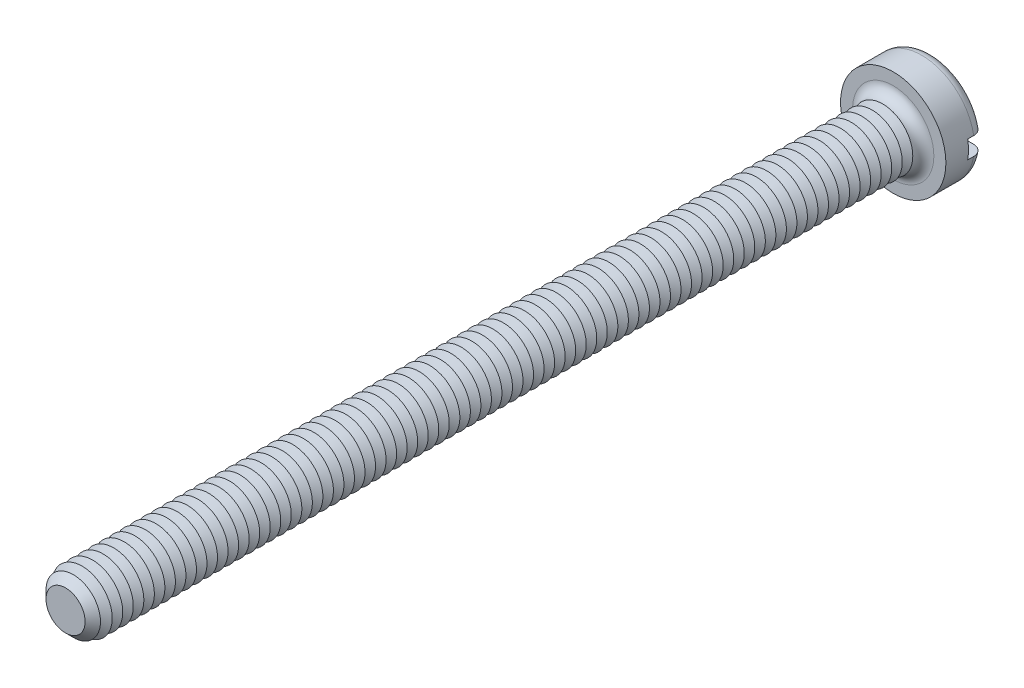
ISO-10303-21;
HEADER;
FILE_DESCRIPTION(('STEP AP214'),'2;1');
FILE_NAME('part.step','',(''),(''),'','','');
FILE_SCHEMA(('AUTOMOTIVE_DESIGN { 1 0 10303 214 1 1 1 1 }'));
ENDSEC;
DATA;
#1=APPLICATION_CONTEXT('core data for automotive mechanical design processes');
#2=APPLICATION_PROTOCOL_DEFINITION('international standard','automotive_design',2000,#1);
#3=PRODUCT_CONTEXT('',#1,'mechanical');
#4=PRODUCT('Part','Part','',(#3));
#5=PRODUCT_RELATED_PRODUCT_CATEGORY('part','',(#4));
#6=PRODUCT_DEFINITION_FORMATION('','',#4);
#7=PRODUCT_DEFINITION_CONTEXT('part definition',#1,'design');
#8=PRODUCT_DEFINITION('design','',#6,#7);
#9=PRODUCT_DEFINITION_SHAPE('','',#8);
#10=(LENGTH_UNIT() NAMED_UNIT(*) SI_UNIT(.MILLI.,.METRE.));
#11=(NAMED_UNIT(*) PLANE_ANGLE_UNIT() SI_UNIT($,.RADIAN.));
#12=(NAMED_UNIT(*) SI_UNIT($,.STERADIAN.) SOLID_ANGLE_UNIT());
#13=UNCERTAINTY_MEASURE_WITH_UNIT(LENGTH_MEASURE(1.E-05),#10,'distance_accuracy_value','');
#14=(GEOMETRIC_REPRESENTATION_CONTEXT(3) GLOBAL_UNCERTAINTY_ASSIGNED_CONTEXT((#13)) GLOBAL_UNIT_ASSIGNED_CONTEXT((#10,
#11,#12)) REPRESENTATION_CONTEXT('',''));
#15=CARTESIAN_POINT('',(0.,0.,0.));
#16=DIRECTION('',(0.,0.,1.));
#17=DIRECTION('',(1.,0.,0.));
#18=AXIS2_PLACEMENT_3D('',#15,#16,#17);
#19=CARTESIAN_POINT('',(0.,0.,-2.6));
#20=DIRECTION('',(0.,0.,1.));
#21=DIRECTION('',(1.,0.,0.));
#22=AXIS2_PLACEMENT_3D('',#19,#20,#21);
#23=PLANE('',#22);
#24=CARTESIAN_POINT('',(0.,0.,-2.6));
#25=DIRECTION('',(0.,0.,1.));
#26=DIRECTION('',(1.,0.,0.));
#27=AXIS2_PLACEMENT_3D('',#24,#25,#26);
#28=CIRCLE('',#27,2.8);
#29=CARTESIAN_POINT('',(-2.73495886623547,0.6,-2.6));
#30=VERTEX_POINT('',#29);
#31=CARTESIAN_POINT('',(2.73495886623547,0.6,-2.6));
#32=VERTEX_POINT('',#31);
#33=EDGE_CURVE('E116',#30,#32,#28,.F.);
#34=ORIENTED_EDGE('',*,*,#33,.T.);
#35=DIRECTION('',(1.,0.,0.));
#36=VECTOR('',#35,1.);
#37=CARTESIAN_POINT('',(-3.5,0.600000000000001,-2.6));
#38=LINE('',#37,#36);
#39=EDGE_CURVE('E111',#30,#32,#38,.T.);
#40=ORIENTED_EDGE('',*,*,#39,.F.);
#41=EDGE_LOOP('',(#34,#40));
#42=FACE_BOUND('',#41,.T.);
#43=ADVANCED_FACE('F39',(#42),#23,.F.);
#44=CARTESIAN_POINT('',(0.,0.,-1.9));
#45=DIRECTION('',(0.,0.,1.));
#46=DIRECTION('',(1.,0.,0.));
#47=AXIS2_PLACEMENT_3D('',#44,#45,#46);
#48=TOROIDAL_SURFACE('',#47,2.8,0.7);
#49=CARTESIAN_POINT('',(-3.24550494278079,0.600000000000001,-2.38938679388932));
#50=CARTESIAN_POINT('',(-3.21724139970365,0.600000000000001,-2.41780774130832));
#51=CARTESIAN_POINT('',(-3.18652103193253,0.600000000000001,-2.44383169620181));
#52=CARTESIAN_POINT('',(-3.12110229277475,0.600000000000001,-2.49034599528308));
#53=CARTESIAN_POINT('',(-3.08639834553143,0.6,-2.51082844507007));
#54=CARTESIAN_POINT('',(-3.01410013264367,0.6,-2.54568075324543));
#55=CARTESIAN_POINT('',(-2.97650963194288,0.6,-2.56005841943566));
#56=CARTESIAN_POINT('',(-2.89948250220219,0.6,-2.58239238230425));
#57=CARTESIAN_POINT('',(-2.86004633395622,0.6,-2.59035027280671));
#58=CARTESIAN_POINT('',(-2.77983715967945,0.6,-2.5997577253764));
#59=CARTESIAN_POINT('',(-2.73905311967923,0.6,-2.60111317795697));
#60=CARTESIAN_POINT('',(-2.65781876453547,0.6,-2.59706866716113));
#61=CARTESIAN_POINT('',(-2.61736849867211,0.6,-2.59166772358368));
#62=CARTESIAN_POINT('',(-2.53729983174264,0.6,-2.57414594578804));
#63=CARTESIAN_POINT('',(-2.49770360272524,0.6,-2.56192363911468));
#64=CARTESIAN_POINT('',(-2.421111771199,0.6,-2.5310238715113));
#65=CARTESIAN_POINT('',(-2.38411632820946,0.6,-2.51234601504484));
#66=CARTESIAN_POINT('',(-2.31371213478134,0.6,-2.46896762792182));
#67=CARTESIAN_POINT('',(-2.28031240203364,0.6,-2.44425244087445));
#68=CARTESIAN_POINT('',(-2.21823311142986,0.6,-2.38946667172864));
#69=CARTESIAN_POINT('',(-2.18955321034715,0.6,-2.35939647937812));
#70=CARTESIAN_POINT('',(-2.13836074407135,0.6,-2.29532787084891));
#71=CARTESIAN_POINT('',(-2.11574147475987,0.6,-2.26141482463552));
#72=CARTESIAN_POINT('',(-2.07677080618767,0.6,-2.19015935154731));
#73=CARTESIAN_POINT('',(-2.06041784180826,0.6,-2.15281778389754));
#74=CARTESIAN_POINT('',(-2.03508596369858,0.6,-2.07723332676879));
#75=CARTESIAN_POINT('',(-2.02585871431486,0.6,-2.03907365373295));
#76=CARTESIAN_POINT('',(-2.01416722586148,0.6,-1.96173417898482));
#77=CARTESIAN_POINT('',(-2.01170151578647,0.6,-1.92255460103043));
#78=CARTESIAN_POINT('',(-2.01359934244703,0.6,-1.84555709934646));
#79=CARTESIAN_POINT('',(-2.01775787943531,0.6,-1.80773393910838));
#80=CARTESIAN_POINT('',(-2.03236373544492,0.6,-1.73332511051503));
#81=CARTESIAN_POINT('',(-2.04281097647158,0.6,-1.69673942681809));
#82=CARTESIAN_POINT('',(-2.06962963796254,0.6,-1.62577336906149));
#83=CARTESIAN_POINT('',(-2.08600685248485,0.6,-1.59139519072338));
#84=CARTESIAN_POINT('',(-2.12413495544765,0.6,-1.52576356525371));
#85=CARTESIAN_POINT('',(-2.14588657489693,0.6,-1.49451054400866));
#86=CARTESIAN_POINT('',(-2.19483541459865,0.6,-1.43498643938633));
#87=CARTESIAN_POINT('',(-2.22217844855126,0.6,-1.40683532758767));
#88=CARTESIAN_POINT('',(-2.28105616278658,0.6,-1.35532544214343));
#89=CARTESIAN_POINT('',(-2.3125916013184,0.6,-1.33196753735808));
#90=CARTESIAN_POINT('',(-2.38018779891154,0.6,-1.28984356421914));
#91=CARTESIAN_POINT('',(-2.41637068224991,0.6,-1.27127330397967));
#92=CARTESIAN_POINT('',(-2.49129688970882,0.6,-1.24032971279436));
#93=CARTESIAN_POINT('',(-2.53004053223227,0.6,-1.22795715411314));
#94=CARTESIAN_POINT('',(-2.6098393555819,0.6,-1.2095515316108));
#95=CARTESIAN_POINT('',(-2.65092550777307,0.6,-1.20365237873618));
#96=CARTESIAN_POINT('',(-2.7335069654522,0.6,-1.1988380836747));
#97=CARTESIAN_POINT('',(-2.7750022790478,0.6,-1.19992308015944));
#98=CARTESIAN_POINT('',(-2.85718851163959,0.6,-1.20909046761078));
#99=CARTESIAN_POINT('',(-2.8978799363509,0.6,-1.21716830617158));
#100=CARTESIAN_POINT('',(-2.97729176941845,0.6,-1.24014327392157));
#101=CARTESIAN_POINT('',(-3.01601231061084,0.6,-1.25503994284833));
#102=CARTESIAN_POINT('',(-3.08976822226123,0.6,-1.29101066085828));
#103=CARTESIAN_POINT('',(-3.12484927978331,0.600000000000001,-1.31199098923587));
#104=CARTESIAN_POINT('',(-3.19090022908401,0.600000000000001,-1.35965144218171));
#105=CARTESIAN_POINT('',(-3.22187053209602,0.600000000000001,-1.38633099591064));
#106=CARTESIAN_POINT('',(-3.2781946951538,0.600000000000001,-1.44408564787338));
#107=CARTESIAN_POINT('',(-3.3036441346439,0.600000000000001,-1.47506754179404));
#108=CARTESIAN_POINT('',(-3.34887649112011,0.600000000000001,-1.54092398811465));
#109=CARTESIAN_POINT('',(-3.36865993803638,0.600000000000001,-1.57579817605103));
#110=CARTESIAN_POINT('',(-3.40166738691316,0.600000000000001,-1.64783067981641));
#111=CARTESIAN_POINT('',(-3.41499360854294,0.600000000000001,-1.68494217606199));
#112=CARTESIAN_POINT('',(-3.43515375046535,0.600000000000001,-1.76088675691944));
#113=CARTESIAN_POINT('',(-3.44198836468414,0.600000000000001,-1.79971965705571));
#114=CARTESIAN_POINT('',(-3.44891916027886,0.600000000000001,-1.87757893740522));
#115=CARTESIAN_POINT('',(-3.44908375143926,0.600000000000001,-1.91659924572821));
#116=CARTESIAN_POINT('',(-3.44284111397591,0.600000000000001,-1.99412088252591));
#117=CARTESIAN_POINT('',(-3.43643236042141,0.600000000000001,-2.03262208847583));
#118=CARTESIAN_POINT('',(-3.41725803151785,0.600000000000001,-2.10792315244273));
#119=CARTESIAN_POINT('',(-3.40450469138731,0.600000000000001,-2.14472613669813));
#120=CARTESIAN_POINT('',(-3.3730385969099,0.600000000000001,-2.21565060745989));
#121=CARTESIAN_POINT('',(-3.35433321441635,0.600000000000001,-2.24977534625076));
#122=CARTESIAN_POINT('',(-3.3201892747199,0.600000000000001,-2.30136364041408));
#123=CARTESIAN_POINT('',(-3.30647805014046,0.600000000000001,-2.31999402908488));
#124=CARTESIAN_POINT('',(-3.27728518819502,0.600000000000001,-2.35581090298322));
#125=CARTESIAN_POINT('',(-3.26180356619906,0.600000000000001,-2.37299740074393));
#126=CARTESIAN_POINT('',(-3.24550494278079,0.600000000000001,-2.38938679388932));
#127=B_SPLINE_CURVE_WITH_KNOTS('',3,(#49,#50,#51,#52,#53,#54,#55,#56,#57,#58,#59,#60,#61,#62,
#63,#64,#65,#66,#67,#68,#69,#70,#71,#72,#73,#74,#75,#76,#77,#78,#79,#80,#81,#82,#83,#84,#85,#86,
#87,#88,#89,#90,#91,#92,#93,#94,#95,#96,#97,#98,#99,#100,#101,#102,#103,#104,#105,#106,#107,
#108,#109,#110,#111,#112,#113,#114,#115,#116,#117,#118,#119,#120,#121,#122,#123,#124,#125,#126),
.UNSPECIFIED.,.T.,.F.,(4,2,2,2,2,2,2,2,2,2,2,2,2,2,2,2,2,2,2,2,2,2,2,2,2,2,2,2,2,2,2,2,2,2,2,2,
2,2,4),(0.,0.120160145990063,0.240490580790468,0.36066665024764,0.480812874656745,
0.602666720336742,0.724538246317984,0.848272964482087,0.972015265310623,1.09606100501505,
1.2200977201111,1.34178071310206,1.46343329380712,1.58062647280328,1.6977941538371,
1.81140573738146,1.92501591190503,2.03873739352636,2.15247435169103,2.26967910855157,
2.38690509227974,2.50835551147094,2.62982106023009,2.75375450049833,2.87769040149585,
3.00154567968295,3.12539259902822,3.24742469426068,3.36944457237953,3.48914477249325,
3.60883377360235,3.72656056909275,3.84427477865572,3.96078136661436,4.07731498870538,
4.19362474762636,4.3097910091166,4.37908387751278,4.44837614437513),.UNSPECIFIED.);
#128=CARTESIAN_POINT('',(-3.44818792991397,0.600000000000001,-1.8999999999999));
#129=VERTEX_POINT('',#128);
#130=EDGE_CURVE('E800',#129,#30,#127,.T.);
#131=ORIENTED_EDGE('',*,*,#130,.F.);
#132=CARTESIAN_POINT('',(0.,0.,-1.9));
#133=DIRECTION('',(0.,0.,1.));
#134=DIRECTION('',(1.,0.,0.));
#135=AXIS2_PLACEMENT_3D('',#132,#133,#134);
#136=CIRCLE('',#135,3.5);
#137=CARTESIAN_POINT('',(3.44818792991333,0.6,-1.9));
#138=VERTEX_POINT('',#137);
#139=EDGE_CURVE('E124',#138,#129,#136,.T.);
#140=ORIENTED_EDGE('',*,*,#139,.F.);
#141=CARTESIAN_POINT('',(2.1414268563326,0.6,-2.29762171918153));
#142=CARTESIAN_POINT('',(2.16505443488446,0.6,-2.33058245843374));
#143=CARTESIAN_POINT('',(2.19155609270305,0.6,-2.36152717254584));
#144=CARTESIAN_POINT('',(2.24942944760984,0.6,-2.41852964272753));
#145=CARTESIAN_POINT('',(2.28080921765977,0.6,-2.44457913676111));
#146=CARTESIAN_POINT('',(2.34741203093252,0.6,-2.49105381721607));
#147=CARTESIAN_POINT('',(2.38262862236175,0.6,-2.51148824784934));
#148=CARTESIAN_POINT('',(2.45593176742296,0.6,-2.54626881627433));
#149=CARTESIAN_POINT('',(2.49401741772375,0.6,-2.56061686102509));
#150=CARTESIAN_POINT('',(2.57272605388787,0.6,-2.58306429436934));
#151=CARTESIAN_POINT('',(2.6133821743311,0.6,-2.59104769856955));
#152=CARTESIAN_POINT('',(2.6954618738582,0.6,-2.60009608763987));
#153=CARTESIAN_POINT('',(2.73688552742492,0.6,-2.60116039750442));
#154=CARTESIAN_POINT('',(2.81941950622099,0.6,-2.5962925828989));
#155=CARTESIAN_POINT('',(2.86052888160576,0.6,-2.59034422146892));
#156=CARTESIAN_POINT('',(2.94113709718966,0.6,-2.57153687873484));
#157=CARTESIAN_POINT('',(2.98063603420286,0.6,-2.55867831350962));
#158=CARTESIAN_POINT('',(3.05633735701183,0.6,-2.52657771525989));
#159=CARTESIAN_POINT('',(3.09257627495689,0.6,-2.50742188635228));
#160=CARTESIAN_POINT('',(3.16123898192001,0.6,-2.46318606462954));
#161=CARTESIAN_POINT('',(3.19366316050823,0.6,-2.4381066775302));
#162=CARTESIAN_POINT('',(3.25312278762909,0.6,-2.38324481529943));
#163=CARTESIAN_POINT('',(3.28024842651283,0.6,-2.35356008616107));
#164=CARTESIAN_POINT('',(3.32902587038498,0.6,-2.28998971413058));
#165=CARTESIAN_POINT('',(3.35067820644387,0.6,-2.25610447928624));
#166=CARTESIAN_POINT('',(3.38751207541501,0.6,-2.18572286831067));
#167=CARTESIAN_POINT('',(3.40279804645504,0.6,-2.14928112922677));
#168=CARTESIAN_POINT('',(3.42695590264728,0.6,-2.07433042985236));
#169=CARTESIAN_POINT('',(3.43582824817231,0.6,-2.03582161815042));
#170=CARTESIAN_POINT('',(3.44682113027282,0.6,-1.95829536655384));
#171=CARTESIAN_POINT('',(3.44901648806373,0.6,-1.91928851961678));
#172=CARTESIAN_POINT('',(3.44680085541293,0.6,-1.84146366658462));
#173=CARTESIAN_POINT('',(3.44239008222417,0.6,-1.80264565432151));
#174=CARTESIAN_POINT('',(3.42712544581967,0.6,-1.72644634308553));
#175=CARTESIAN_POINT('',(3.41629508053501,0.6,-1.6890603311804));
#176=CARTESIAN_POINT('',(3.38853757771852,0.6,-1.61662604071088));
#177=CARTESIAN_POINT('',(3.37161039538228,0.6,-1.58157777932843));
#178=CARTESIAN_POINT('',(3.33207798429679,0.6,-1.51464178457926));
#179=CARTESIAN_POINT('',(3.30944854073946,0.6,-1.48276835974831));
#180=CARTESIAN_POINT('',(3.2592165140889,0.6,-1.42321861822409));
#181=CARTESIAN_POINT('',(3.23161370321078,0.6,-1.3955424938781));
#182=CARTESIAN_POINT('',(3.17188519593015,0.6,-1.34481834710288));
#183=CARTESIAN_POINT('',(3.13971065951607,0.6,-1.32182785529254));
#184=CARTESIAN_POINT('',(3.07201123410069,0.6,-1.28147003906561));
#185=CARTESIAN_POINT('',(3.03648608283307,0.6,-1.26410315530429));
#186=CARTESIAN_POINT('',(2.962449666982,0.6,-1.2351645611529));
#187=CARTESIAN_POINT('',(2.92389781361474,0.6,-1.22369671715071));
#188=CARTESIAN_POINT('',(2.84543273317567,0.6,-1.20726565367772));
#189=CARTESIAN_POINT('',(2.80551936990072,0.6,-1.20230308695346));
#190=CARTESIAN_POINT('',(2.72467191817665,0.6,-1.1989357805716));
#191=CARTESIAN_POINT('',(2.68373266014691,0.6,-1.20065484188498));
#192=CARTESIAN_POINT('',(2.60270222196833,0.6,-1.21084560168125));
#193=CARTESIAN_POINT('',(2.56261112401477,0.6,-1.21931795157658));
#194=CARTESIAN_POINT('',(2.48385954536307,0.6,-1.24292934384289));
#195=CARTESIAN_POINT('',(2.44522508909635,0.6,-1.25815531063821));
#196=CARTESIAN_POINT('',(2.37106165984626,0.6,-1.29488663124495));
#197=CARTESIAN_POINT('',(2.33553282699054,0.6,-1.31639226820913));
#198=CARTESIAN_POINT('',(2.2686996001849,0.6,-1.36507949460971));
#199=CARTESIAN_POINT('',(2.23738745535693,0.6,-1.39225042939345));
#200=CARTESIAN_POINT('',(2.17990424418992,0.6,-1.45157941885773));
#201=CARTESIAN_POINT('',(2.15373259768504,0.6,-1.48373691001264));
#202=CARTESIAN_POINT('',(2.10799355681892,0.6,-1.551327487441));
#203=CARTESIAN_POINT('',(2.08828258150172,0.6,-1.58666329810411));
#204=CARTESIAN_POINT('',(2.05534440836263,0.6,-1.66023600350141));
#205=CARTESIAN_POINT('',(2.042115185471,0.6,-1.6984719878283));
#206=CARTESIAN_POINT('',(2.02303126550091,0.6,-1.77519783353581));
#207=CARTESIAN_POINT('',(2.01691541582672,0.6,-1.8136228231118));
#208=CARTESIAN_POINT('',(2.01140375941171,0.6,-1.89096056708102));
#209=CARTESIAN_POINT('',(2.01200856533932,0.6,-1.92987336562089));
#210=CARTESIAN_POINT('',(2.01981617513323,0.6,-2.006065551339));
#211=CARTESIAN_POINT('',(2.02685835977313,0.6,-2.04336165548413));
#212=CARTESIAN_POINT('',(2.0470502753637,0.6,-2.1162250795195));
#213=CARTESIAN_POINT('',(2.06019252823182,0.6,-2.15179445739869));
#214=CARTESIAN_POINT('',(2.08525738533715,0.6,-2.20558874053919));
#215=CARTESIAN_POINT('',(2.09529161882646,0.6,-2.22471751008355));
#216=CARTESIAN_POINT('',(2.11708813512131,0.6,-2.26196179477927));
#217=CARTESIAN_POINT('',(2.12885034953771,0.6,-2.28007734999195));
#218=CARTESIAN_POINT('',(2.1414268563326,0.6,-2.29762171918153));
#219=B_SPLINE_CURVE_WITH_KNOTS('',3,(#141,#142,#143,#144,#145,#146,#147,#148,#149,#150,#151,
#152,#153,#154,#155,#156,#157,#158,#159,#160,#161,#162,#163,#164,#165,#166,#167,#168,#169,#170,
#171,#172,#173,#174,#175,#176,#177,#178,#179,#180,#181,#182,#183,#184,#185,#186,#187,#188,#189,
#190,#191,#192,#193,#194,#195,#196,#197,#198,#199,#200,#201,#202,#203,#204,#205,#206,#207,#208,
#209,#210,#211,#212,#213,#214,#215,#216,#217,#218),.UNSPECIFIED.,.T.,.F.,(4,2,2,2,2,2,2,2,2,2,2,
2,2,2,2,2,2,2,2,2,2,2,2,2,2,2,2,2,2,2,2,2,2,2,2,2,2,2,4),(0.,0.121582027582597,
0.243367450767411,0.364951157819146,0.486496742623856,0.610209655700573,0.733934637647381,
0.857946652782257,0.981951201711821,1.1043243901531,1.22668507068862,1.34673532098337,
1.46677391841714,1.58475736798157,1.70273234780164,1.81938035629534,1.93602452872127,
2.05224435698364,2.168465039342,2.28518782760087,2.40191596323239,2.52000081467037,
2.63809491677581,2.75820270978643,2.87832255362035,3.00067856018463,3.1230463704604,
3.24703703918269,3.37103329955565,3.49479843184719,3.6185495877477,3.73932715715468,
3.86006696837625,3.9762182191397,4.09238005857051,4.2057203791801,4.31892212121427,
4.38364046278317,4.44835624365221),.UNSPECIFIED.);
#220=EDGE_CURVE('E802',#32,#138,#219,.T.);
#221=ORIENTED_EDGE('',*,*,#220,.F.);
#222=ORIENTED_EDGE('',*,*,#33,.F.);
#223=EDGE_LOOP('',(#131,#140,#221,#222));
#224=FACE_BOUND('',#223,.T.);
#225=ADVANCED_FACE('F784',(#224),#48,.T.);
#226=CARTESIAN_POINT('',(0.,0.,-2.6));
#227=DIRECTION('',(0.,0.,1.));
#228=DIRECTION('',(1.,0.,0.));
#229=AXIS2_PLACEMENT_3D('',#226,#227,#228);
#230=CYLINDRICAL_SURFACE('',#229,3.5);
#231=DIRECTION('',(0.,0.,1.));
#232=VECTOR('',#231,1.);
#233=CARTESIAN_POINT('',(3.44818792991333,0.6,-2.6));
#234=LINE('',#233,#232);
#235=CARTESIAN_POINT('',(3.44818792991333,0.6,-1.5));
#236=VERTEX_POINT('',#235);
#237=EDGE_CURVE('E818',#138,#236,#234,.T.);
#238=ORIENTED_EDGE('',*,*,#237,.F.);
#239=ORIENTED_EDGE('',*,*,#139,.T.);
#240=DIRECTION('',(0.,0.,1.));
#241=VECTOR('',#240,1.);
#242=CARTESIAN_POINT('',(-3.44818792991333,0.600000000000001,-2.6));
#243=LINE('',#242,#241);
#244=CARTESIAN_POINT('',(-3.44818792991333,0.600000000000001,-1.5));
#245=VERTEX_POINT('',#244);
#246=EDGE_CURVE('E63',#245,#129,#243,.F.);
#247=ORIENTED_EDGE('',*,*,#246,.F.);
#248=CARTESIAN_POINT('',(0.,0.,-1.5));
#249=DIRECTION('',(0.,0.,-1.));
#250=DIRECTION('',(-1.,0.,0.));
#251=AXIS2_PLACEMENT_3D('',#248,#249,#250);
#252=CIRCLE('',#251,3.5);
#253=CARTESIAN_POINT('',(-3.44818792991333,-0.599999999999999,-1.5));
#254=VERTEX_POINT('',#253);
#255=EDGE_CURVE('E43',#245,#254,#252,.F.);
#256=ORIENTED_EDGE('',*,*,#255,.T.);
#257=DIRECTION('',(0.,0.,1.));
#258=VECTOR('',#257,1.);
#259=CARTESIAN_POINT('',(-3.44818792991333,-0.599999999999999,-2.6));
#260=LINE('',#259,#258);
#261=CARTESIAN_POINT('',(-3.44818792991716,-0.599999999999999,-1.90000000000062));
#262=VERTEX_POINT('',#261);
#263=EDGE_CURVE('E815',#262,#254,#260,.T.);
#264=ORIENTED_EDGE('',*,*,#263,.F.);
#265=CARTESIAN_POINT('',(3.44818792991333,-0.6,-1.9));
#266=VERTEX_POINT('',#265);
#267=EDGE_CURVE('E126',#262,#266,#136,.T.);
#268=ORIENTED_EDGE('',*,*,#267,.T.);
#269=DIRECTION('',(0.,0.,1.));
#270=VECTOR('',#269,1.);
#271=CARTESIAN_POINT('',(3.44818792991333,-0.6,-2.6));
#272=LINE('',#271,#270);
#273=CARTESIAN_POINT('',(3.44818792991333,-0.6,-1.5));
#274=VERTEX_POINT('',#273);
#275=EDGE_CURVE('E55',#274,#266,#272,.F.);
#276=ORIENTED_EDGE('',*,*,#275,.F.);
#277=EDGE_CURVE('E11',#274,#236,#252,.F.);
#278=ORIENTED_EDGE('',*,*,#277,.T.);
#279=EDGE_LOOP('',(#238,#239,#247,#256,#264,#268,#276,#278));
#280=FACE_BOUND('',#279,.T.);
#281=CARTESIAN_POINT('',(0.,0.,0.));
#282=DIRECTION('',(0.,0.,1.));
#283=DIRECTION('',(1.,0.,0.));
#284=AXIS2_PLACEMENT_3D('',#281,#282,#283);
#285=CIRCLE('',#284,3.5);
#286=CARTESIAN_POINT('',(3.5,0.,0.));
#287=VERTEX_POINT('',#286);
#288=EDGE_CURVE('E821',#287,#287,#285,.T.);
#289=ORIENTED_EDGE('',*,*,#288,.F.);
#290=EDGE_LOOP('',(#289));
#291=FACE_BOUND('',#290,.T.);
#292=ADVANCED_FACE('F780',(#280,#291),#230,.T.);
#293=CARTESIAN_POINT('',(2.73495886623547,-0.6,-2.6));
#294=VERTEX_POINT('',#293);
#295=CARTESIAN_POINT('',(-2.73495886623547,-0.6,-2.6));
#296=VERTEX_POINT('',#295);
#297=EDGE_CURVE('E109',#294,#296,#28,.F.);
#298=ORIENTED_EDGE('',*,*,#297,.T.);
#299=DIRECTION('',(-1.,0.,0.));
#300=VECTOR('',#299,1.);
#301=CARTESIAN_POINT('',(-3.5,-0.599999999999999,-2.6));
#302=LINE('',#301,#300);
#303=EDGE_CURVE('E96',#294,#296,#302,.T.);
#304=ORIENTED_EDGE('',*,*,#303,.F.);
#305=EDGE_LOOP('',(#298,#304));
#306=FACE_BOUND('',#305,.T.);
#307=ADVANCED_FACE('F108',(#306),#23,.F.);
#308=CARTESIAN_POINT('',(0.,0.,0.));
#309=DIRECTION('',(0.,0.,1.));
#310=DIRECTION('',(1.,0.,0.));
#311=AXIS2_PLACEMENT_3D('',#308,#309,#310);
#312=PLANE('',#311);
#313=CARTESIAN_POINT('',(0.,0.,0.));
#314=DIRECTION('',(0.,0.,1.));
#315=DIRECTION('',(1.,0.,0.));
#316=AXIS2_PLACEMENT_3D('',#313,#314,#315);
#317=CIRCLE('',#316,2.7);
#318=CARTESIAN_POINT('',(2.7,0.,0.));
#319=VERTEX_POINT('',#318);
#320=EDGE_CURVE('E115',#319,#319,#317,.F.);
#321=ORIENTED_EDGE('',*,*,#320,.T.);
#322=EDGE_LOOP('',(#321));
#323=FACE_BOUND('',#322,.T.);
#324=ORIENTED_EDGE('',*,*,#288,.T.);
#325=EDGE_LOOP('',(#324));
#326=FACE_BOUND('',#325,.T.);
#327=ADVANCED_FACE('F779',(#323,#326),#312,.T.);
#328=CARTESIAN_POINT('',(-3.24550494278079,-0.599999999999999,-2.38938679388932));
#329=CARTESIAN_POINT('',(-3.27309693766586,-0.599999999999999,-2.36163611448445));
#330=CARTESIAN_POINT('',(-3.29838741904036,-0.599999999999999,-2.3315608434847));
#331=CARTESIAN_POINT('',(-3.34359429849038,-0.599999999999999,-2.26757659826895));
#332=CARTESIAN_POINT('',(-3.36350518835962,-0.599999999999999,-2.23366374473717));
#333=CARTESIAN_POINT('',(-3.39733065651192,-0.599999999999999,-2.16296274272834));
#334=CARTESIAN_POINT('',(-3.4112451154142,-0.599999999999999,-2.12617453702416));
#335=CARTESIAN_POINT('',(-3.43264462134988,-0.599999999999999,-2.05078178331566));
#336=CARTESIAN_POINT('',(-3.44013114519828,-0.599999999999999,-2.01217765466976));
#337=CARTESIAN_POINT('',(-3.44841975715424,-0.599999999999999,-1.9345391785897));
#338=CARTESIAN_POINT('',(-3.44926944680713,-0.599999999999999,-1.89550990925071));
#339=CARTESIAN_POINT('',(-3.44438358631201,-0.599999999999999,-1.81786552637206));
#340=CARTESIAN_POINT('',(-3.43864801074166,-0.599999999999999,-1.77925041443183));
#341=CARTESIAN_POINT('',(-3.42079221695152,-0.599999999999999,-1.70364264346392));
#342=CARTESIAN_POINT('',(-3.40869011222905,-0.599999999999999,-1.66664570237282));
#343=CARTESIAN_POINT('',(-3.37847692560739,-0.599999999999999,-1.59519424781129));
#344=CARTESIAN_POINT('',(-3.3603657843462,-0.599999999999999,-1.56073975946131));
#345=CARTESIAN_POINT('',(-3.31856549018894,-0.599999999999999,-1.4951524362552));
#346=CARTESIAN_POINT('',(-3.29484830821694,-0.599999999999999,-1.46403747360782));
#347=CARTESIAN_POINT('',(-3.24258489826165,-0.599999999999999,-1.40617131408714));
#348=CARTESIAN_POINT('',(-3.21403843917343,-0.599999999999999,-1.37942032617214));
#349=CARTESIAN_POINT('',(-3.15256084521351,-0.599999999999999,-1.33067963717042));
#350=CARTESIAN_POINT('',(-3.11958015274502,-0.599999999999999,-1.30875246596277));
#351=CARTESIAN_POINT('',(-3.0504559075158,-0.599999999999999,-1.27063718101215));
#352=CARTESIAN_POINT('',(-3.01431209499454,-0.6,-1.25444953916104));
#353=CARTESIAN_POINT('',(-2.93921710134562,-0.6,-1.22796796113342));
#354=CARTESIAN_POINT('',(-2.90022796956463,-0.6,-1.217781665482));
#355=CARTESIAN_POINT('',(-2.82110512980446,-0.6,-1.20396915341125));
#356=CARTESIAN_POINT('',(-2.7809713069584,-0.6,-1.2003435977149));
#357=CARTESIAN_POINT('',(-2.69990924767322,-0.6,-1.19969717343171));
#358=CARTESIAN_POINT('',(-2.65898001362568,-0.6,-1.20279937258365));
#359=CARTESIAN_POINT('',(-2.57819986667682,-0.6,-1.21574287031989));
#360=CARTESIAN_POINT('',(-2.53834905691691,-0.6,-1.22558481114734));
#361=CARTESIAN_POINT('',(-2.46035232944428,-0.6,-1.25189361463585));
#362=CARTESIAN_POINT('',(-2.42223314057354,-0.6,-1.2684398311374));
#363=CARTESIAN_POINT('',(-2.34932316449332,-0.6,-1.30771928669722));
#364=CARTESIAN_POINT('',(-2.31453248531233,-0.6,-1.33045272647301));
#365=CARTESIAN_POINT('',(-2.24945577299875,-0.6,-1.38141543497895));
#366=CARTESIAN_POINT('',(-2.21915255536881,-0.6,-1.40962272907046));
#367=CARTESIAN_POINT('',(-2.16386461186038,-0.6,-1.47084552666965));
#368=CARTESIAN_POINT('',(-2.13887916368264,-0.6,-1.50386037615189));
#369=CARTESIAN_POINT('',(-2.09568071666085,-0.6,-1.57285917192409));
#370=CARTESIAN_POINT('',(-2.07730739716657,-0.6,-1.60874263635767));
#371=CARTESIAN_POINT('',(-2.04712019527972,-0.6,-1.68316975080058));
#372=CARTESIAN_POINT('',(-2.03530452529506,-0.6,-1.72171267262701));
#373=CARTESIAN_POINT('',(-2.01901751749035,-0.6,-1.79878952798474));
#374=CARTESIAN_POINT('',(-2.01428434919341,-0.6,-1.8372682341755));
#375=CARTESIAN_POINT('',(-2.01150652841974,-0.6,-1.91446369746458));
#376=CARTESIAN_POINT('',(-2.01346084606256,-0.6,-1.95318041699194));
#377=CARTESIAN_POINT('',(-2.02386268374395,-0.6,-2.0288619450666));
#378=CARTESIAN_POINT('',(-2.03216724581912,-0.6,-2.06584654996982));
#379=CARTESIAN_POINT('',(-2.05479337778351,-0.6,-2.13792373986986));
#380=CARTESIAN_POINT('',(-2.06911522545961,-0.6,-2.1730162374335));
#381=CARTESIAN_POINT('',(-2.10349906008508,-0.6,-2.24081034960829));
#382=CARTESIAN_POINT('',(-2.12363007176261,-0.6,-2.27347689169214));
#383=CARTESIAN_POINT('',(-2.16891308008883,-0.6,-2.33511902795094));
#384=CARTESIAN_POINT('',(-2.19406590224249,-0.6,-2.36409401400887));
#385=CARTESIAN_POINT('',(-2.24962389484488,-0.6,-2.41861972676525));
#386=CARTESIAN_POINT('',(-2.28018314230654,-0.6,-2.44401345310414));
#387=CARTESIAN_POINT('',(-2.34501720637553,-0.6,-2.48950558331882));
#388=CARTESIAN_POINT('',(-2.37929266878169,-0.6,-2.50960306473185));
#389=CARTESIAN_POINT('',(-2.45179417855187,-0.6,-2.54458276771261));
#390=CARTESIAN_POINT('',(-2.49011248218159,-0.6,-2.55927401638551));
#391=CARTESIAN_POINT('',(-2.56865227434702,-0.6,-2.58211133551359));
#392=CARTESIAN_POINT('',(-2.60887386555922,-0.6,-2.59025705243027));
#393=CARTESIAN_POINT('',(-2.69064746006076,-0.6,-2.59982905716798));
#394=CARTESIAN_POINT('',(-2.73220999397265,-0.6,-2.60116580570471));
#395=CARTESIAN_POINT('',(-2.81497658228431,-0.6,-2.59679700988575));
#396=CARTESIAN_POINT('',(-2.85618055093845,-0.6,-2.59108982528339));
#397=CARTESIAN_POINT('',(-2.93677683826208,-0.6,-2.57279487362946));
#398=CARTESIAN_POINT('',(-2.97617834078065,-0.6,-2.56024753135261));
#399=CARTESIAN_POINT('',(-3.05222242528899,-0.6,-2.52860709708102));
#400=CARTESIAN_POINT('',(-3.08886850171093,-0.599999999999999,-2.50952247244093));
#401=CARTESIAN_POINT('',(-3.14562501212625,-0.599999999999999,-2.47340693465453));
#402=CARTESIAN_POINT('',(-3.16689358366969,-0.599999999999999,-2.45816337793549));
#403=CARTESIAN_POINT('',(-3.20761866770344,-0.599999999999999,-2.42542115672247));
#404=CARTESIAN_POINT('',(-3.22707520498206,-0.599999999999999,-2.40792252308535));
#405=CARTESIAN_POINT('',(-3.24550494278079,-0.599999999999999,-2.38938679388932));
#406=B_SPLINE_CURVE_WITH_KNOTS('',3,(#328,#329,#330,#331,#332,#333,#334,#335,#336,#337,#338,
#339,#340,#341,#342,#343,#344,#345,#346,#347,#348,#349,#350,#351,#352,#353,#354,#355,#356,#357,
#358,#359,#360,#361,#362,#363,#364,#365,#366,#367,#368,#369,#370,#371,#372,#373,#374,#375,#376,
#377,#378,#379,#380,#381,#382,#383,#384,#385,#386,#387,#388,#389,#390,#391,#392,#393,#394,#395,
#396,#397,#398,#399,#400,#401,#402,#403,#404,#405),.UNSPECIFIED.,.T.,.F.,(4,2,2,2,2,2,2,2,2,2,2,
2,2,2,2,2,2,2,2,2,2,2,2,2,2,2,2,2,2,2,2,2,2,2,2,2,2,2,4),(0.,0.117306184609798,
0.234732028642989,0.352160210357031,0.469561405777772,0.586119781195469,0.702678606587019,
0.818907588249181,0.935137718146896,1.05196174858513,1.1687913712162,1.2870562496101,
1.40533084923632,1.52566688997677,1.64601504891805,1.76858322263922,1.89116307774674,
2.01523830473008,2.13931755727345,2.26290863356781,2.38648291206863,2.50681878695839,
2.62712184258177,2.74285697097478,2.85857427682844,2.97176054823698,3.08495204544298,
3.19954814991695,3.31416310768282,3.43282436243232,3.55150627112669,3.67404987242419,
3.79660009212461,3.92075778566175,4.04494439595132,4.16840490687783,4.29170610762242,
4.3700604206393,4.44841366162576),.UNSPECIFIED.);
#407=EDGE_CURVE('E103',#296,#262,#406,.T.);
#408=ORIENTED_EDGE('',*,*,#407,.F.);
#409=ORIENTED_EDGE('',*,*,#297,.F.);
#410=CARTESIAN_POINT('',(2.1414268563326,-0.6,-2.29762171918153));
#411=CARTESIAN_POINT('',(2.11900044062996,-0.6,-2.26633119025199));
#412=CARTESIAN_POINT('',(2.09913154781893,-0.6,-2.23318080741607));
#413=CARTESIAN_POINT('',(2.06517900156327,-0.6,-2.16401111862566));
#414=CARTESIAN_POINT('',(2.05109968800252,-0.6,-2.12798968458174));
#415=CARTESIAN_POINT('',(2.02923593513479,-0.6,-2.05404277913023));
#416=CARTESIAN_POINT('',(2.02145692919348,-0.6,-2.01611569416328));
#417=CARTESIAN_POINT('',(2.01251710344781,-0.6,-1.93949649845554));
#418=CARTESIAN_POINT('',(2.01135461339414,-0.6,-1.90080458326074));
#419=CARTESIAN_POINT('',(2.01564803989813,-0.6,-1.82450508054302));
#420=CARTESIAN_POINT('',(2.02098305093,-0.6,-1.78689061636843));
#421=CARTESIAN_POINT('',(2.03786826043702,-0.6,-1.71308589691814));
#422=CARTESIAN_POINT('',(2.04941870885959,-0.6,-1.67689569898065));
#423=CARTESIAN_POINT('',(2.07838664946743,-0.6,-1.60676639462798));
#424=CARTESIAN_POINT('',(2.09582944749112,-0.6,-1.57283776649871));
#425=CARTESIAN_POINT('',(2.1359925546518,-0.6,-1.50826612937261));
#426=CARTESIAN_POINT('',(2.15871360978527,-0.6,-1.47762358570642));
#427=CARTESIAN_POINT('',(2.20955413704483,-0.6,-1.41943384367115));
#428=CARTESIAN_POINT('',(2.23782364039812,-0.6,-1.39201777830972));
#429=CARTESIAN_POINT('',(2.29842612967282,-0.6,-1.34212199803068));
#430=CARTESIAN_POINT('',(2.33075984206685,-0.6,-1.31964316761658));
#431=CARTESIAN_POINT('',(2.399806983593,-0.6,-1.27945238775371));
#432=CARTESIAN_POINT('',(2.43663466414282,-0.6,-1.26193653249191));
#433=CARTESIAN_POINT('',(2.51267241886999,-0.6,-1.23320660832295));
#434=CARTESIAN_POINT('',(2.55188277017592,-0.6,-1.22199327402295));
#435=CARTESIAN_POINT('',(2.63235000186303,-0.6,-1.20602688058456));
#436=CARTESIAN_POINT('',(2.673631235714,-0.6,-1.20139617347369));
#437=CARTESIAN_POINT('',(2.7563863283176,-0.6,-1.19914622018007));
#438=CARTESIAN_POINT('',(2.79786018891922,-0.6,-1.20152704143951));
#439=CARTESIAN_POINT('',(2.87971192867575,-0.6,-1.21326884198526));
#440=CARTESIAN_POINT('',(2.92009214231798,-0.6,-1.22261349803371));
#441=CARTESIAN_POINT('',(2.99866777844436,-0.6,-1.24805614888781));
#442=CARTESIAN_POINT('',(3.03686335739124,-0.6,-1.26415365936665));
#443=CARTESIAN_POINT('',(3.10934738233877,-0.6,-1.3023912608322));
#444=CARTESIAN_POINT('',(3.14368704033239,-0.6,-1.32443423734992));
#445=CARTESIAN_POINT('',(3.20808395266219,-0.6,-1.37407725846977));
#446=CARTESIAN_POINT('',(3.23814164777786,-0.6,-1.40167673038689));
#447=CARTESIAN_POINT('',(3.29251534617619,-0.6,-1.46108303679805));
#448=CARTESIAN_POINT('',(3.3169296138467,-0.6,-1.49279994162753));
#449=CARTESIAN_POINT('',(3.35998418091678,-0.6,-1.55993706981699));
#450=CARTESIAN_POINT('',(3.37862502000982,-0.6,-1.59535694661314));
#451=CARTESIAN_POINT('',(3.40930212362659,-0.6,-1.668283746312));
#452=CARTESIAN_POINT('',(3.42143897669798,-0.6,-1.70574837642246));
#453=CARTESIAN_POINT('',(3.43918305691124,-0.6,-1.78219297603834));
#454=CARTESIAN_POINT('',(3.44479069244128,-0.6,-1.82117285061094));
#455=CARTESIAN_POINT('',(3.44928173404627,-0.6,-1.89914596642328));
#456=CARTESIAN_POINT('',(3.44822835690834,-0.6,-1.93813558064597));
#457=CARTESIAN_POINT('',(3.43957811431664,-0.6,-2.0153811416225));
#458=CARTESIAN_POINT('',(3.43198139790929,-0.6,-2.05363710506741));
#459=CARTESIAN_POINT('',(3.41049386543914,-0.6,-2.12826741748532));
#460=CARTESIAN_POINT('',(3.39661362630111,-0.6,-2.16464481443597));
#461=CARTESIAN_POINT('',(3.36297924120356,-0.6,-2.23457274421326));
#462=CARTESIAN_POINT('',(3.34322499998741,-0.6,-2.26812323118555));
#463=CARTESIAN_POINT('',(3.29828706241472,-0.6,-2.33167864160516));
#464=CARTESIAN_POINT('',(3.27307040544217,-0.6,-2.36166024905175));
#465=CARTESIAN_POINT('',(3.21802069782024,-0.6,-2.41703165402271));
#466=CARTESIAN_POINT('',(3.18818738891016,-0.6,-2.44242119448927));
#467=CARTESIAN_POINT('',(3.12433871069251,-0.6,-2.48825551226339));
#468=CARTESIAN_POINT('',(3.09027338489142,-0.6,-2.50863067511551));
#469=CARTESIAN_POINT('',(3.01925175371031,-0.6,-2.54348754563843));
#470=CARTESIAN_POINT('',(2.982295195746,-0.6,-2.55796873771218));
#471=CARTESIAN_POINT('',(2.90583499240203,-0.6,-2.58090526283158));
#472=CARTESIAN_POINT('',(2.86629758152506,-0.6,-2.58924801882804));
#473=CARTESIAN_POINT('',(2.78639041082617,-0.6,-2.59930573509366));
#474=CARTESIAN_POINT('',(2.7460205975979,-0.6,-2.60102026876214));
#475=CARTESIAN_POINT('',(2.66482039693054,-0.6,-2.59779078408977));
#476=CARTESIAN_POINT('',(2.62399477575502,-0.6,-2.59272651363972));
#477=CARTESIAN_POINT('',(2.54373809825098,-0.6,-2.57588976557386));
#478=CARTESIAN_POINT('',(2.50430750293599,-0.6,-2.56411509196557));
#479=CARTESIAN_POINT('',(2.42753167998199,-0.6,-2.53401488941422));
#480=CARTESIAN_POINT('',(2.39021407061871,-0.6,-2.51561892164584));
#481=CARTESIAN_POINT('',(2.31925431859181,-0.6,-2.4727929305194));
#482=CARTESIAN_POINT('',(2.28560806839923,-0.6,-2.44836975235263));
#483=CARTESIAN_POINT('',(2.23316677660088,-0.6,-2.40295212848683));
#484=CARTESIAN_POINT('',(2.21309339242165,-0.6,-2.38341311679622));
#485=CARTESIAN_POINT('',(2.17537212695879,-0.6,-2.34211733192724));
#486=CARTESIAN_POINT('',(2.1577241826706,-0.6,-2.32036061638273));
#487=CARTESIAN_POINT('',(2.1414268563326,-0.6,-2.29762171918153));
#488=B_SPLINE_CURVE_WITH_KNOTS('',3,(#410,#411,#412,#413,#414,#415,#416,#417,#418,#419,#420,
#421,#422,#423,#424,#425,#426,#427,#428,#429,#430,#431,#432,#433,#434,#435,#436,#437,#438,#439,
#440,#441,#442,#443,#444,#445,#446,#447,#448,#449,#450,#451,#452,#453,#454,#455,#456,#457,#458,
#459,#460,#461,#462,#463,#464,#465,#466,#467,#468,#469,#470,#471,#472,#473,#474,#475,#476,#477,
#478,#479,#480,#481,#482,#483,#484,#485,#486,#487),.UNSPECIFIED.,.T.,.F.,(4,2,2,2,2,2,2,2,2,2,2,
2,2,2,2,2,2,2,2,2,2,2,2,2,2,2,2,2,2,2,2,2,2,2,2,2,2,2,4),(0.,0.115394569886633,
0.230875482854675,0.346455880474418,0.462007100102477,0.575440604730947,0.688878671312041,
0.802810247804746,0.91675793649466,1.03436780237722,1.15199872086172,1.27377854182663,
1.39557255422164,1.51960202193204,1.64363268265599,1.76737352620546,1.89110549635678,
2.01292743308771,2.13473682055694,2.25423121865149,2.37371444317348,2.49129215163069,
2.60886250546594,2.72531873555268,2.8417723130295,2.95803059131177,3.07429075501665,
3.19127301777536,3.30826182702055,3.42679321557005,3.54533497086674,3.66599996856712,
3.78667273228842,3.90951478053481,4.03239705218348,4.15662720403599,4.28071691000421,
4.36457658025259,4.44843407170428),.UNSPECIFIED.);
#489=EDGE_CURVE('E92',#266,#294,#488,.T.);
#490=ORIENTED_EDGE('',*,*,#489,.F.);
#491=ORIENTED_EDGE('',*,*,#267,.F.);
#492=EDGE_LOOP('',(#408,#409,#490,#491));
#493=FACE_BOUND('',#492,.T.);
#494=ADVANCED_FACE('F113',(#493),#48,.T.);
#495=CARTESIAN_POINT('',(0.,0.,0.699999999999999));
#496=DIRECTION('',(0.,0.,1.));
#497=DIRECTION('',(1.,0.,0.));
#498=AXIS2_PLACEMENT_3D('',#495,#496,#497);
#499=TOROIDAL_SURFACE('',#498,2.7,0.7);
#500=ORIENTED_EDGE('',*,*,#320,.F.);
#501=EDGE_LOOP('',(#500));
#502=FACE_BOUND('',#501,.T.);
#503=CARTESIAN_POINT('',(0.,0.,0.699999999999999));
#504=DIRECTION('',(0.,0.,-1.));
#505=DIRECTION('',(-1.,0.,0.));
#506=AXIS2_PLACEMENT_3D('',#503,#504,#505);
#507=CIRCLE('',#506,2.);
#508=CARTESIAN_POINT('',(-2.,0.,0.699999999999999));
#509=VERTEX_POINT('',#508);
#510=EDGE_CURVE('E827',#509,#509,#507,.T.);
#511=ORIENTED_EDGE('',*,*,#510,.T.);
#512=EDGE_LOOP('',(#511));
#513=FACE_BOUND('',#512,.T.);
#514=ADVANCED_FACE('F772',(#502,#513),#499,.F.);
#515=CARTESIAN_POINT('',(0.,0.,1.05));
#516=DIRECTION('',(0.,0.,-1.));
#517=DIRECTION('',(-1.,0.,0.));
#518=AXIS2_PLACEMENT_3D('',#515,#516,#517);
#519=CONICAL_SURFACE('',#518,1.39378221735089,1.0471975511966);
#520=ORIENTED_EDGE('',*,*,#510,.F.);
#521=EDGE_LOOP('',(#520));
#522=FACE_BOUND('',#521,.T.);
#523=CARTESIAN_POINT('',(0.,0.,1.05));
#524=DIRECTION('',(0.,0.,-1.));
#525=DIRECTION('',(-1.,0.,0.));
#526=AXIS2_PLACEMENT_3D('',#523,#524,#525);
#527=CIRCLE('',#526,1.39378221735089);
#528=CARTESIAN_POINT('',(-1.39378221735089,0.,1.05));
#529=VERTEX_POINT('',#528);
#530=EDGE_CURVE('E832',#529,#529,#527,.T.);
#531=ORIENTED_EDGE('',*,*,#530,.T.);
#532=EDGE_LOOP('',(#531));
#533=FACE_BOUND('',#532,.T.);
#534=ADVANCED_FACE('F768',(#522,#533),#519,.T.);
#535=CARTESIAN_POINT('',(0.,0.,1.4));
#536=DIRECTION('',(0.,0.,1.));
#537=DIRECTION('',(1.,0.,0.));
#538=AXIS2_PLACEMENT_3D('',#535,#536,#537);
#539=CONICAL_SURFACE('',#538,2.,1.0471975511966);
#540=ORIENTED_EDGE('',*,*,#530,.F.);
#541=EDGE_LOOP('',(#540));
#542=FACE_BOUND('',#541,.T.);
#543=CARTESIAN_POINT('',(0.,0.,1.4));
#544=DIRECTION('',(0.,0.,-1.));
#545=DIRECTION('',(-1.,0.,0.));
#546=AXIS2_PLACEMENT_3D('',#543,#544,#545);
#547=CIRCLE('',#546,2.);
#548=CARTESIAN_POINT('',(-2.,0.,1.4));
#549=VERTEX_POINT('',#548);
#550=EDGE_CURVE('E838',#549,#549,#547,.T.);
#551=ORIENTED_EDGE('',*,*,#550,.T.);
#552=EDGE_LOOP('',(#551));
#553=FACE_BOUND('',#552,.T.);
#554=ADVANCED_FACE('F764',(#542,#553),#539,.T.);
#555=CARTESIAN_POINT('',(0.,0.,1.75));
#556=DIRECTION('',(0.,0.,-1.));
#557=DIRECTION('',(-1.,0.,0.));
#558=AXIS2_PLACEMENT_3D('',#555,#556,#557);
#559=CONICAL_SURFACE('',#558,1.39378221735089,1.0471975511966);
#560=ORIENTED_EDGE('',*,*,#550,.F.);
#561=EDGE_LOOP('',(#560));
#562=FACE_BOUND('',#561,.T.);
#563=CARTESIAN_POINT('',(0.,0.,1.75));
#564=DIRECTION('',(0.,0.,-1.));
#565=DIRECTION('',(-1.,0.,0.));
#566=AXIS2_PLACEMENT_3D('',#563,#564,#565);
#567=CIRCLE('',#566,1.39378221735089);
#568=CARTESIAN_POINT('',(-1.39378221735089,0.,1.75));
#569=VERTEX_POINT('',#568);
#570=EDGE_CURVE('E841',#569,#569,#567,.T.);
#571=ORIENTED_EDGE('',*,*,#570,.T.);
#572=EDGE_LOOP('',(#571));
#573=FACE_BOUND('',#572,.T.);
#574=ADVANCED_FACE('F760',(#562,#573),#559,.T.);
#575=CARTESIAN_POINT('',(0.,0.,2.1));
#576=DIRECTION('',(0.,0.,1.));
#577=DIRECTION('',(1.,0.,0.));
#578=AXIS2_PLACEMENT_3D('',#575,#576,#577);
#579=CONICAL_SURFACE('',#578,2.,1.0471975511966);
#580=ORIENTED_EDGE('',*,*,#570,.F.);
#581=EDGE_LOOP('',(#580));
#582=FACE_BOUND('',#581,.T.);
#583=CARTESIAN_POINT('',(0.,0.,2.1));
#584=DIRECTION('',(0.,0.,-1.));
#585=DIRECTION('',(-1.,0.,0.));
#586=AXIS2_PLACEMENT_3D('',#583,#584,#585);
#587=CIRCLE('',#586,2.);
#588=CARTESIAN_POINT('',(-2.,0.,2.1));
#589=VERTEX_POINT('',#588);
#590=EDGE_CURVE('E845',#589,#589,#587,.T.);
#591=ORIENTED_EDGE('',*,*,#590,.T.);
#592=EDGE_LOOP('',(#591));
#593=FACE_BOUND('',#592,.T.);
#594=ADVANCED_FACE('F756',(#582,#593),#579,.T.);
#595=CARTESIAN_POINT('',(0.,0.,2.45));
#596=DIRECTION('',(0.,0.,-1.));
#597=DIRECTION('',(-1.,0.,0.));
#598=AXIS2_PLACEMENT_3D('',#595,#596,#597);
#599=CONICAL_SURFACE('',#598,1.39378221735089,1.0471975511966);
#600=ORIENTED_EDGE('',*,*,#590,.F.);
#601=EDGE_LOOP('',(#600));
#602=FACE_BOUND('',#601,.T.);
#603=CARTESIAN_POINT('',(0.,0.,2.45));
#604=DIRECTION('',(0.,0.,-1.));
#605=DIRECTION('',(-1.,0.,0.));
#606=AXIS2_PLACEMENT_3D('',#603,#604,#605);
#607=CIRCLE('',#606,1.39378221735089);
#608=CARTESIAN_POINT('',(-1.39378221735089,0.,2.45));
#609=VERTEX_POINT('',#608);
#610=EDGE_CURVE('E849',#609,#609,#607,.T.);
#611=ORIENTED_EDGE('',*,*,#610,.T.);
#612=EDGE_LOOP('',(#611));
#613=FACE_BOUND('',#612,.T.);
#614=ADVANCED_FACE('F752',(#602,#613),#599,.T.);
#615=CARTESIAN_POINT('',(0.,0.,2.8));
#616=DIRECTION('',(0.,0.,1.));
#617=DIRECTION('',(1.,0.,0.));
#618=AXIS2_PLACEMENT_3D('',#615,#616,#617);
#619=CONICAL_SURFACE('',#618,2.,1.0471975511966);
#620=ORIENTED_EDGE('',*,*,#610,.F.);
#621=EDGE_LOOP('',(#620));
#622=FACE_BOUND('',#621,.T.);
#623=CARTESIAN_POINT('',(0.,0.,2.8));
#624=DIRECTION('',(0.,0.,-1.));
#625=DIRECTION('',(-1.,0.,0.));
#626=AXIS2_PLACEMENT_3D('',#623,#624,#625);
#627=CIRCLE('',#626,2.);
#628=CARTESIAN_POINT('',(-2.,0.,2.8));
#629=VERTEX_POINT('',#628);
#630=EDGE_CURVE('E852',#629,#629,#627,.T.);
#631=ORIENTED_EDGE('',*,*,#630,.T.);
#632=EDGE_LOOP('',(#631));
#633=FACE_BOUND('',#632,.T.);
#634=ADVANCED_FACE('F748',(#622,#633),#619,.T.);
#635=CARTESIAN_POINT('',(0.,0.,3.15));
#636=DIRECTION('',(0.,0.,-1.));
#637=DIRECTION('',(-1.,0.,0.));
#638=AXIS2_PLACEMENT_3D('',#635,#636,#637);
#639=CONICAL_SURFACE('',#638,1.39378221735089,1.0471975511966);
#640=ORIENTED_EDGE('',*,*,#630,.F.);
#641=EDGE_LOOP('',(#640));
#642=FACE_BOUND('',#641,.T.);
#643=CARTESIAN_POINT('',(0.,0.,3.15));
#644=DIRECTION('',(0.,0.,-1.));
#645=DIRECTION('',(-1.,0.,0.));
#646=AXIS2_PLACEMENT_3D('',#643,#644,#645);
#647=CIRCLE('',#646,1.39378221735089);
#648=CARTESIAN_POINT('',(-1.39378221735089,0.,3.15));
#649=VERTEX_POINT('',#648);
#650=EDGE_CURVE('E855',#649,#649,#647,.T.);
#651=ORIENTED_EDGE('',*,*,#650,.T.);
#652=EDGE_LOOP('',(#651));
#653=FACE_BOUND('',#652,.T.);
#654=ADVANCED_FACE('F744',(#642,#653),#639,.T.);
#655=CARTESIAN_POINT('',(0.,0.,3.5));
#656=DIRECTION('',(0.,0.,1.));
#657=DIRECTION('',(1.,0.,0.));
#658=AXIS2_PLACEMENT_3D('',#655,#656,#657);
#659=CONICAL_SURFACE('',#658,2.,1.0471975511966);
#660=ORIENTED_EDGE('',*,*,#650,.F.);
#661=EDGE_LOOP('',(#660));
#662=FACE_BOUND('',#661,.T.);
#663=CARTESIAN_POINT('',(0.,0.,3.5));
#664=DIRECTION('',(0.,0.,-1.));
#665=DIRECTION('',(-1.,0.,0.));
#666=AXIS2_PLACEMENT_3D('',#663,#664,#665);
#667=CIRCLE('',#666,2.);
#668=CARTESIAN_POINT('',(-2.,0.,3.5));
#669=VERTEX_POINT('',#668);
#670=EDGE_CURVE('E859',#669,#669,#667,.T.);
#671=ORIENTED_EDGE('',*,*,#670,.T.);
#672=EDGE_LOOP('',(#671));
#673=FACE_BOUND('',#672,.T.);
#674=ADVANCED_FACE('F740',(#662,#673),#659,.T.);
#675=CARTESIAN_POINT('',(0.,0.,3.85));
#676=DIRECTION('',(0.,0.,-1.));
#677=DIRECTION('',(-1.,0.,0.));
#678=AXIS2_PLACEMENT_3D('',#675,#676,#677);
#679=CONICAL_SURFACE('',#678,1.39378221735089,1.0471975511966);
#680=ORIENTED_EDGE('',*,*,#670,.F.);
#681=EDGE_LOOP('',(#680));
#682=FACE_BOUND('',#681,.T.);
#683=CARTESIAN_POINT('',(0.,0.,3.85));
#684=DIRECTION('',(0.,0.,-1.));
#685=DIRECTION('',(-1.,0.,0.));
#686=AXIS2_PLACEMENT_3D('',#683,#684,#685);
#687=CIRCLE('',#686,1.39378221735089);
#688=CARTESIAN_POINT('',(-1.39378221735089,0.,3.85));
#689=VERTEX_POINT('',#688);
#690=EDGE_CURVE('E863',#689,#689,#687,.T.);
#691=ORIENTED_EDGE('',*,*,#690,.T.);
#692=EDGE_LOOP('',(#691));
#693=FACE_BOUND('',#692,.T.);
#694=ADVANCED_FACE('F736',(#682,#693),#679,.T.);
#695=CARTESIAN_POINT('',(0.,0.,4.2));
#696=DIRECTION('',(0.,0.,1.));
#697=DIRECTION('',(1.,0.,0.));
#698=AXIS2_PLACEMENT_3D('',#695,#696,#697);
#699=CONICAL_SURFACE('',#698,2.,1.0471975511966);
#700=ORIENTED_EDGE('',*,*,#690,.F.);
#701=EDGE_LOOP('',(#700));
#702=FACE_BOUND('',#701,.T.);
#703=CARTESIAN_POINT('',(0.,0.,4.2));
#704=DIRECTION('',(0.,0.,-1.));
#705=DIRECTION('',(-1.,0.,0.));
#706=AXIS2_PLACEMENT_3D('',#703,#704,#705);
#707=CIRCLE('',#706,2.);
#708=CARTESIAN_POINT('',(-2.,0.,4.2));
#709=VERTEX_POINT('',#708);
#710=EDGE_CURVE('E867',#709,#709,#707,.T.);
#711=ORIENTED_EDGE('',*,*,#710,.T.);
#712=EDGE_LOOP('',(#711));
#713=FACE_BOUND('',#712,.T.);
#714=ADVANCED_FACE('F732',(#702,#713),#699,.T.);
#715=CARTESIAN_POINT('',(0.,0.,4.55));
#716=DIRECTION('',(0.,0.,-1.));
#717=DIRECTION('',(-1.,0.,0.));
#718=AXIS2_PLACEMENT_3D('',#715,#716,#717);
#719=CONICAL_SURFACE('',#718,1.39378221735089,1.0471975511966);
#720=ORIENTED_EDGE('',*,*,#710,.F.);
#721=EDGE_LOOP('',(#720));
#722=FACE_BOUND('',#721,.T.);
#723=CARTESIAN_POINT('',(0.,0.,4.55));
#724=DIRECTION('',(0.,0.,-1.));
#725=DIRECTION('',(-1.,0.,0.));
#726=AXIS2_PLACEMENT_3D('',#723,#724,#725);
#727=CIRCLE('',#726,1.39378221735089);
#728=CARTESIAN_POINT('',(-1.39378221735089,0.,4.55));
#729=VERTEX_POINT('',#728);
#730=EDGE_CURVE('E871',#729,#729,#727,.T.);
#731=ORIENTED_EDGE('',*,*,#730,.T.);
#732=EDGE_LOOP('',(#731));
#733=FACE_BOUND('',#732,.T.);
#734=ADVANCED_FACE('F728',(#722,#733),#719,.T.);
#735=CARTESIAN_POINT('',(0.,0.,4.9));
#736=DIRECTION('',(0.,0.,1.));
#737=DIRECTION('',(1.,0.,0.));
#738=AXIS2_PLACEMENT_3D('',#735,#736,#737);
#739=CONICAL_SURFACE('',#738,2.,1.0471975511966);
#740=ORIENTED_EDGE('',*,*,#730,.F.);
#741=EDGE_LOOP('',(#740));
#742=FACE_BOUND('',#741,.T.);
#743=CARTESIAN_POINT('',(0.,0.,4.9));
#744=DIRECTION('',(0.,0.,-1.));
#745=DIRECTION('',(-1.,0.,0.));
#746=AXIS2_PLACEMENT_3D('',#743,#744,#745);
#747=CIRCLE('',#746,2.);
#748=CARTESIAN_POINT('',(-2.,0.,4.9));
#749=VERTEX_POINT('',#748);
#750=EDGE_CURVE('E875',#749,#749,#747,.T.);
#751=ORIENTED_EDGE('',*,*,#750,.T.);
#752=EDGE_LOOP('',(#751));
#753=FACE_BOUND('',#752,.T.);
#754=ADVANCED_FACE('F724',(#742,#753),#739,.T.);
#755=CARTESIAN_POINT('',(0.,0.,5.25));
#756=DIRECTION('',(0.,0.,-1.));
#757=DIRECTION('',(-1.,0.,0.));
#758=AXIS2_PLACEMENT_3D('',#755,#756,#757);
#759=CONICAL_SURFACE('',#758,1.39378221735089,1.0471975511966);
#760=ORIENTED_EDGE('',*,*,#750,.F.);
#761=EDGE_LOOP('',(#760));
#762=FACE_BOUND('',#761,.T.);
#763=CARTESIAN_POINT('',(0.,0.,5.25));
#764=DIRECTION('',(0.,0.,-1.));
#765=DIRECTION('',(-1.,0.,0.));
#766=AXIS2_PLACEMENT_3D('',#763,#764,#765);
#767=CIRCLE('',#766,1.39378221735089);
#768=CARTESIAN_POINT('',(-1.39378221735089,0.,5.25));
#769=VERTEX_POINT('',#768);
#770=EDGE_CURVE('E879',#769,#769,#767,.T.);
#771=ORIENTED_EDGE('',*,*,#770,.T.);
#772=EDGE_LOOP('',(#771));
#773=FACE_BOUND('',#772,.T.);
#774=ADVANCED_FACE('F720',(#762,#773),#759,.T.);
#775=CARTESIAN_POINT('',(0.,0.,5.6));
#776=DIRECTION('',(0.,0.,1.));
#777=DIRECTION('',(1.,0.,0.));
#778=AXIS2_PLACEMENT_3D('',#775,#776,#777);
#779=CONICAL_SURFACE('',#778,2.,1.0471975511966);
#780=ORIENTED_EDGE('',*,*,#770,.F.);
#781=EDGE_LOOP('',(#780));
#782=FACE_BOUND('',#781,.T.);
#783=CARTESIAN_POINT('',(0.,0.,5.6));
#784=DIRECTION('',(0.,0.,-1.));
#785=DIRECTION('',(-1.,0.,0.));
#786=AXIS2_PLACEMENT_3D('',#783,#784,#785);
#787=CIRCLE('',#786,2.);
#788=CARTESIAN_POINT('',(-2.,0.,5.6));
#789=VERTEX_POINT('',#788);
#790=EDGE_CURVE('E883',#789,#789,#787,.T.);
#791=ORIENTED_EDGE('',*,*,#790,.T.);
#792=EDGE_LOOP('',(#791));
#793=FACE_BOUND('',#792,.T.);
#794=ADVANCED_FACE('F716',(#782,#793),#779,.T.);
#795=CARTESIAN_POINT('',(0.,0.,5.95));
#796=DIRECTION('',(0.,0.,-1.));
#797=DIRECTION('',(-1.,0.,0.));
#798=AXIS2_PLACEMENT_3D('',#795,#796,#797);
#799=CONICAL_SURFACE('',#798,1.39378221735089,1.0471975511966);
#800=ORIENTED_EDGE('',*,*,#790,.F.);
#801=EDGE_LOOP('',(#800));
#802=FACE_BOUND('',#801,.T.);
#803=CARTESIAN_POINT('',(0.,0.,5.95));
#804=DIRECTION('',(0.,0.,-1.));
#805=DIRECTION('',(-1.,0.,0.));
#806=AXIS2_PLACEMENT_3D('',#803,#804,#805);
#807=CIRCLE('',#806,1.39378221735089);
#808=CARTESIAN_POINT('',(-1.39378221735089,0.,5.95));
#809=VERTEX_POINT('',#808);
#810=EDGE_CURVE('E887',#809,#809,#807,.T.);
#811=ORIENTED_EDGE('',*,*,#810,.T.);
#812=EDGE_LOOP('',(#811));
#813=FACE_BOUND('',#812,.T.);
#814=ADVANCED_FACE('F712',(#802,#813),#799,.T.);
#815=CARTESIAN_POINT('',(0.,0.,6.3));
#816=DIRECTION('',(0.,0.,1.));
#817=DIRECTION('',(1.,0.,0.));
#818=AXIS2_PLACEMENT_3D('',#815,#816,#817);
#819=CONICAL_SURFACE('',#818,2.,1.0471975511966);
#820=ORIENTED_EDGE('',*,*,#810,.F.);
#821=EDGE_LOOP('',(#820));
#822=FACE_BOUND('',#821,.T.);
#823=CARTESIAN_POINT('',(0.,0.,6.3));
#824=DIRECTION('',(0.,0.,-1.));
#825=DIRECTION('',(-1.,0.,0.));
#826=AXIS2_PLACEMENT_3D('',#823,#824,#825);
#827=CIRCLE('',#826,2.);
#828=CARTESIAN_POINT('',(-2.,0.,6.3));
#829=VERTEX_POINT('',#828);
#830=EDGE_CURVE('E890',#829,#829,#827,.T.);
#831=ORIENTED_EDGE('',*,*,#830,.T.);
#832=EDGE_LOOP('',(#831));
#833=FACE_BOUND('',#832,.T.);
#834=ADVANCED_FACE('F708',(#822,#833),#819,.T.);
#835=CARTESIAN_POINT('',(0.,0.,6.65));
#836=DIRECTION('',(0.,0.,-1.));
#837=DIRECTION('',(-1.,0.,0.));
#838=AXIS2_PLACEMENT_3D('',#835,#836,#837);
#839=CONICAL_SURFACE('',#838,1.39378221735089,1.0471975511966);
#840=ORIENTED_EDGE('',*,*,#830,.F.);
#841=EDGE_LOOP('',(#840));
#842=FACE_BOUND('',#841,.T.);
#843=CARTESIAN_POINT('',(0.,0.,6.65));
#844=DIRECTION('',(0.,0.,-1.));
#845=DIRECTION('',(-1.,0.,0.));
#846=AXIS2_PLACEMENT_3D('',#843,#844,#845);
#847=CIRCLE('',#846,1.39378221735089);
#848=CARTESIAN_POINT('',(-1.39378221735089,0.,6.65));
#849=VERTEX_POINT('',#848);
#850=EDGE_CURVE('E894',#849,#849,#847,.T.);
#851=ORIENTED_EDGE('',*,*,#850,.T.);
#852=EDGE_LOOP('',(#851));
#853=FACE_BOUND('',#852,.T.);
#854=ADVANCED_FACE('F704',(#842,#853),#839,.T.);
#855=CARTESIAN_POINT('',(0.,0.,7.));
#856=DIRECTION('',(0.,0.,1.));
#857=DIRECTION('',(1.,0.,0.));
#858=AXIS2_PLACEMENT_3D('',#855,#856,#857);
#859=CONICAL_SURFACE('',#858,2.,1.0471975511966);
#860=ORIENTED_EDGE('',*,*,#850,.F.);
#861=EDGE_LOOP('',(#860));
#862=FACE_BOUND('',#861,.T.);
#863=CARTESIAN_POINT('',(0.,0.,7.));
#864=DIRECTION('',(0.,0.,-1.));
#865=DIRECTION('',(-1.,0.,0.));
#866=AXIS2_PLACEMENT_3D('',#863,#864,#865);
#867=CIRCLE('',#866,2.);
#868=CARTESIAN_POINT('',(-2.,0.,7.));
#869=VERTEX_POINT('',#868);
#870=EDGE_CURVE('E898',#869,#869,#867,.T.);
#871=ORIENTED_EDGE('',*,*,#870,.T.);
#872=EDGE_LOOP('',(#871));
#873=FACE_BOUND('',#872,.T.);
#874=ADVANCED_FACE('F700',(#862,#873),#859,.T.);
#875=CARTESIAN_POINT('',(0.,0.,7.35));
#876=DIRECTION('',(0.,0.,-1.));
#877=DIRECTION('',(-1.,0.,0.));
#878=AXIS2_PLACEMENT_3D('',#875,#876,#877);
#879=CONICAL_SURFACE('',#878,1.39378221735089,1.0471975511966);
#880=ORIENTED_EDGE('',*,*,#870,.F.);
#881=EDGE_LOOP('',(#880));
#882=FACE_BOUND('',#881,.T.);
#883=CARTESIAN_POINT('',(0.,0.,7.35));
#884=DIRECTION('',(0.,0.,-1.));
#885=DIRECTION('',(-1.,0.,0.));
#886=AXIS2_PLACEMENT_3D('',#883,#884,#885);
#887=CIRCLE('',#886,1.39378221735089);
#888=CARTESIAN_POINT('',(-1.39378221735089,0.,7.35));
#889=VERTEX_POINT('',#888);
#890=EDGE_CURVE('E902',#889,#889,#887,.T.);
#891=ORIENTED_EDGE('',*,*,#890,.T.);
#892=EDGE_LOOP('',(#891));
#893=FACE_BOUND('',#892,.T.);
#894=ADVANCED_FACE('F696',(#882,#893),#879,.T.);
#895=CARTESIAN_POINT('',(0.,0.,7.7));
#896=DIRECTION('',(0.,0.,1.));
#897=DIRECTION('',(1.,0.,0.));
#898=AXIS2_PLACEMENT_3D('',#895,#896,#897);
#899=CONICAL_SURFACE('',#898,2.,1.0471975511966);
#900=ORIENTED_EDGE('',*,*,#890,.F.);
#901=EDGE_LOOP('',(#900));
#902=FACE_BOUND('',#901,.T.);
#903=CARTESIAN_POINT('',(0.,0.,7.7));
#904=DIRECTION('',(0.,0.,-1.));
#905=DIRECTION('',(-1.,0.,0.));
#906=AXIS2_PLACEMENT_3D('',#903,#904,#905);
#907=CIRCLE('',#906,2.);
#908=CARTESIAN_POINT('',(-2.,0.,7.7));
#909=VERTEX_POINT('',#908);
#910=EDGE_CURVE('E906',#909,#909,#907,.T.);
#911=ORIENTED_EDGE('',*,*,#910,.T.);
#912=EDGE_LOOP('',(#911));
#913=FACE_BOUND('',#912,.T.);
#914=ADVANCED_FACE('F692',(#902,#913),#899,.T.);
#915=CARTESIAN_POINT('',(0.,0.,8.05));
#916=DIRECTION('',(0.,0.,-1.));
#917=DIRECTION('',(-1.,0.,0.));
#918=AXIS2_PLACEMENT_3D('',#915,#916,#917);
#919=CONICAL_SURFACE('',#918,1.39378221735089,1.0471975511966);
#920=ORIENTED_EDGE('',*,*,#910,.F.);
#921=EDGE_LOOP('',(#920));
#922=FACE_BOUND('',#921,.T.);
#923=CARTESIAN_POINT('',(0.,0.,8.05));
#924=DIRECTION('',(0.,0.,-1.));
#925=DIRECTION('',(-1.,0.,0.));
#926=AXIS2_PLACEMENT_3D('',#923,#924,#925);
#927=CIRCLE('',#926,1.39378221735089);
#928=CARTESIAN_POINT('',(-1.39378221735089,0.,8.05));
#929=VERTEX_POINT('',#928);
#930=EDGE_CURVE('E910',#929,#929,#927,.T.);
#931=ORIENTED_EDGE('',*,*,#930,.T.);
#932=EDGE_LOOP('',(#931));
#933=FACE_BOUND('',#932,.T.);
#934=ADVANCED_FACE('F688',(#922,#933),#919,.T.);
#935=CARTESIAN_POINT('',(0.,0.,8.4));
#936=DIRECTION('',(0.,0.,1.));
#937=DIRECTION('',(1.,0.,0.));
#938=AXIS2_PLACEMENT_3D('',#935,#936,#937);
#939=CONICAL_SURFACE('',#938,2.,1.0471975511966);
#940=ORIENTED_EDGE('',*,*,#930,.F.);
#941=EDGE_LOOP('',(#940));
#942=FACE_BOUND('',#941,.T.);
#943=CARTESIAN_POINT('',(0.,0.,8.4));
#944=DIRECTION('',(0.,0.,-1.));
#945=DIRECTION('',(-1.,0.,0.));
#946=AXIS2_PLACEMENT_3D('',#943,#944,#945);
#947=CIRCLE('',#946,2.);
#948=CARTESIAN_POINT('',(-2.,0.,8.4));
#949=VERTEX_POINT('',#948);
#950=EDGE_CURVE('E914',#949,#949,#947,.T.);
#951=ORIENTED_EDGE('',*,*,#950,.T.);
#952=EDGE_LOOP('',(#951));
#953=FACE_BOUND('',#952,.T.);
#954=ADVANCED_FACE('F684',(#942,#953),#939,.T.);
#955=CARTESIAN_POINT('',(0.,0.,8.75));
#956=DIRECTION('',(0.,0.,-1.));
#957=DIRECTION('',(-1.,0.,0.));
#958=AXIS2_PLACEMENT_3D('',#955,#956,#957);
#959=CONICAL_SURFACE('',#958,1.39378221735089,1.0471975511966);
#960=ORIENTED_EDGE('',*,*,#950,.F.);
#961=EDGE_LOOP('',(#960));
#962=FACE_BOUND('',#961,.T.);
#963=CARTESIAN_POINT('',(0.,0.,8.75));
#964=DIRECTION('',(0.,0.,-1.));
#965=DIRECTION('',(-1.,0.,0.));
#966=AXIS2_PLACEMENT_3D('',#963,#964,#965);
#967=CIRCLE('',#966,1.39378221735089);
#968=CARTESIAN_POINT('',(-1.39378221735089,0.,8.75));
#969=VERTEX_POINT('',#968);
#970=EDGE_CURVE('E918',#969,#969,#967,.T.);
#971=ORIENTED_EDGE('',*,*,#970,.T.);
#972=EDGE_LOOP('',(#971));
#973=FACE_BOUND('',#972,.T.);
#974=ADVANCED_FACE('F680',(#962,#973),#959,.T.);
#975=CARTESIAN_POINT('',(0.,0.,9.1));
#976=DIRECTION('',(0.,0.,1.));
#977=DIRECTION('',(1.,0.,0.));
#978=AXIS2_PLACEMENT_3D('',#975,#976,#977);
#979=CONICAL_SURFACE('',#978,2.,1.0471975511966);
#980=ORIENTED_EDGE('',*,*,#970,.F.);
#981=EDGE_LOOP('',(#980));
#982=FACE_BOUND('',#981,.T.);
#983=CARTESIAN_POINT('',(0.,0.,9.1));
#984=DIRECTION('',(0.,0.,-1.));
#985=DIRECTION('',(-1.,0.,0.));
#986=AXIS2_PLACEMENT_3D('',#983,#984,#985);
#987=CIRCLE('',#986,2.);
#988=CARTESIAN_POINT('',(-2.,0.,9.1));
#989=VERTEX_POINT('',#988);
#990=EDGE_CURVE('E922',#989,#989,#987,.T.);
#991=ORIENTED_EDGE('',*,*,#990,.T.);
#992=EDGE_LOOP('',(#991));
#993=FACE_BOUND('',#992,.T.);
#994=ADVANCED_FACE('F676',(#982,#993),#979,.T.);
#995=CARTESIAN_POINT('',(0.,0.,9.45));
#996=DIRECTION('',(0.,0.,-1.));
#997=DIRECTION('',(-1.,0.,0.));
#998=AXIS2_PLACEMENT_3D('',#995,#996,#997);
#999=CONICAL_SURFACE('',#998,1.39378221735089,1.0471975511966);
#1000=ORIENTED_EDGE('',*,*,#990,.F.);
#1001=EDGE_LOOP('',(#1000));
#1002=FACE_BOUND('',#1001,.T.);
#1003=CARTESIAN_POINT('',(0.,0.,9.45));
#1004=DIRECTION('',(0.,0.,-1.));
#1005=DIRECTION('',(-1.,0.,0.));
#1006=AXIS2_PLACEMENT_3D('',#1003,#1004,#1005);
#1007=CIRCLE('',#1006,1.39378221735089);
#1008=CARTESIAN_POINT('',(-1.39378221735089,0.,9.45));
#1009=VERTEX_POINT('',#1008);
#1010=EDGE_CURVE('E926',#1009,#1009,#1007,.T.);
#1011=ORIENTED_EDGE('',*,*,#1010,.T.);
#1012=EDGE_LOOP('',(#1011));
#1013=FACE_BOUND('',#1012,.T.);
#1014=ADVANCED_FACE('F672',(#1002,#1013),#999,.T.);
#1015=CARTESIAN_POINT('',(0.,0.,9.8));
#1016=DIRECTION('',(0.,0.,1.));
#1017=DIRECTION('',(1.,0.,0.));
#1018=AXIS2_PLACEMENT_3D('',#1015,#1016,#1017);
#1019=CONICAL_SURFACE('',#1018,2.,1.0471975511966);
#1020=ORIENTED_EDGE('',*,*,#1010,.F.);
#1021=EDGE_LOOP('',(#1020));
#1022=FACE_BOUND('',#1021,.T.);
#1023=CARTESIAN_POINT('',(0.,0.,9.8));
#1024=DIRECTION('',(0.,0.,-1.));
#1025=DIRECTION('',(-1.,0.,0.));
#1026=AXIS2_PLACEMENT_3D('',#1023,#1024,#1025);
#1027=CIRCLE('',#1026,2.);
#1028=CARTESIAN_POINT('',(-2.,0.,9.8));
#1029=VERTEX_POINT('',#1028);
#1030=EDGE_CURVE('E930',#1029,#1029,#1027,.T.);
#1031=ORIENTED_EDGE('',*,*,#1030,.T.);
#1032=EDGE_LOOP('',(#1031));
#1033=FACE_BOUND('',#1032,.T.);
#1034=ADVANCED_FACE('F668',(#1022,#1033),#1019,.T.);
#1035=CARTESIAN_POINT('',(0.,0.,10.15));
#1036=DIRECTION('',(0.,0.,-1.));
#1037=DIRECTION('',(-1.,0.,0.));
#1038=AXIS2_PLACEMENT_3D('',#1035,#1036,#1037);
#1039=CONICAL_SURFACE('',#1038,1.39378221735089,1.0471975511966);
#1040=ORIENTED_EDGE('',*,*,#1030,.F.);
#1041=EDGE_LOOP('',(#1040));
#1042=FACE_BOUND('',#1041,.T.);
#1043=CARTESIAN_POINT('',(0.,0.,10.15));
#1044=DIRECTION('',(0.,0.,-1.));
#1045=DIRECTION('',(-1.,0.,0.));
#1046=AXIS2_PLACEMENT_3D('',#1043,#1044,#1045);
#1047=CIRCLE('',#1046,1.39378221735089);
#1048=CARTESIAN_POINT('',(-1.39378221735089,0.,10.15));
#1049=VERTEX_POINT('',#1048);
#1050=EDGE_CURVE('E934',#1049,#1049,#1047,.T.);
#1051=ORIENTED_EDGE('',*,*,#1050,.T.);
#1052=EDGE_LOOP('',(#1051));
#1053=FACE_BOUND('',#1052,.T.);
#1054=ADVANCED_FACE('F664',(#1042,#1053),#1039,.T.);
#1055=CARTESIAN_POINT('',(0.,0.,10.5));
#1056=DIRECTION('',(0.,0.,1.));
#1057=DIRECTION('',(1.,0.,0.));
#1058=AXIS2_PLACEMENT_3D('',#1055,#1056,#1057);
#1059=CONICAL_SURFACE('',#1058,2.,1.0471975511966);
#1060=ORIENTED_EDGE('',*,*,#1050,.F.);
#1061=EDGE_LOOP('',(#1060));
#1062=FACE_BOUND('',#1061,.T.);
#1063=CARTESIAN_POINT('',(0.,0.,10.5));
#1064=DIRECTION('',(0.,0.,-1.));
#1065=DIRECTION('',(-1.,0.,0.));
#1066=AXIS2_PLACEMENT_3D('',#1063,#1064,#1065);
#1067=CIRCLE('',#1066,2.);
#1068=CARTESIAN_POINT('',(-2.,0.,10.5));
#1069=VERTEX_POINT('',#1068);
#1070=EDGE_CURVE('E938',#1069,#1069,#1067,.T.);
#1071=ORIENTED_EDGE('',*,*,#1070,.T.);
#1072=EDGE_LOOP('',(#1071));
#1073=FACE_BOUND('',#1072,.T.);
#1074=ADVANCED_FACE('F660',(#1062,#1073),#1059,.T.);
#1075=CARTESIAN_POINT('',(0.,0.,10.85));
#1076=DIRECTION('',(0.,0.,-1.));
#1077=DIRECTION('',(-1.,0.,0.));
#1078=AXIS2_PLACEMENT_3D('',#1075,#1076,#1077);
#1079=CONICAL_SURFACE('',#1078,1.39378221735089,1.0471975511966);
#1080=ORIENTED_EDGE('',*,*,#1070,.F.);
#1081=EDGE_LOOP('',(#1080));
#1082=FACE_BOUND('',#1081,.T.);
#1083=CARTESIAN_POINT('',(0.,0.,10.85));
#1084=DIRECTION('',(0.,0.,-1.));
#1085=DIRECTION('',(-1.,0.,0.));
#1086=AXIS2_PLACEMENT_3D('',#1083,#1084,#1085);
#1087=CIRCLE('',#1086,1.39378221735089);
#1088=CARTESIAN_POINT('',(-1.39378221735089,0.,10.85));
#1089=VERTEX_POINT('',#1088);
#1090=EDGE_CURVE('E942',#1089,#1089,#1087,.T.);
#1091=ORIENTED_EDGE('',*,*,#1090,.T.);
#1092=EDGE_LOOP('',(#1091));
#1093=FACE_BOUND('',#1092,.T.);
#1094=ADVANCED_FACE('F656',(#1082,#1093),#1079,.T.);
#1095=CARTESIAN_POINT('',(0.,0.,11.2));
#1096=DIRECTION('',(0.,0.,1.));
#1097=DIRECTION('',(1.,0.,0.));
#1098=AXIS2_PLACEMENT_3D('',#1095,#1096,#1097);
#1099=CONICAL_SURFACE('',#1098,2.,1.0471975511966);
#1100=ORIENTED_EDGE('',*,*,#1090,.F.);
#1101=EDGE_LOOP('',(#1100));
#1102=FACE_BOUND('',#1101,.T.);
#1103=CARTESIAN_POINT('',(0.,0.,11.2));
#1104=DIRECTION('',(0.,0.,-1.));
#1105=DIRECTION('',(-1.,0.,0.));
#1106=AXIS2_PLACEMENT_3D('',#1103,#1104,#1105);
#1107=CIRCLE('',#1106,2.);
#1108=CARTESIAN_POINT('',(-2.,0.,11.2));
#1109=VERTEX_POINT('',#1108);
#1110=EDGE_CURVE('E946',#1109,#1109,#1107,.T.);
#1111=ORIENTED_EDGE('',*,*,#1110,.T.);
#1112=EDGE_LOOP('',(#1111));
#1113=FACE_BOUND('',#1112,.T.);
#1114=ADVANCED_FACE('F652',(#1102,#1113),#1099,.T.);
#1115=CARTESIAN_POINT('',(0.,0.,11.55));
#1116=DIRECTION('',(0.,0.,-1.));
#1117=DIRECTION('',(-1.,0.,0.));
#1118=AXIS2_PLACEMENT_3D('',#1115,#1116,#1117);
#1119=CONICAL_SURFACE('',#1118,1.39378221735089,1.0471975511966);
#1120=ORIENTED_EDGE('',*,*,#1110,.F.);
#1121=EDGE_LOOP('',(#1120));
#1122=FACE_BOUND('',#1121,.T.);
#1123=CARTESIAN_POINT('',(0.,0.,11.55));
#1124=DIRECTION('',(0.,0.,-1.));
#1125=DIRECTION('',(-1.,0.,0.));
#1126=AXIS2_PLACEMENT_3D('',#1123,#1124,#1125);
#1127=CIRCLE('',#1126,1.39378221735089);
#1128=CARTESIAN_POINT('',(-1.39378221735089,0.,11.55));
#1129=VERTEX_POINT('',#1128);
#1130=EDGE_CURVE('E950',#1129,#1129,#1127,.T.);
#1131=ORIENTED_EDGE('',*,*,#1130,.T.);
#1132=EDGE_LOOP('',(#1131));
#1133=FACE_BOUND('',#1132,.T.);
#1134=ADVANCED_FACE('F648',(#1122,#1133),#1119,.T.);
#1135=CARTESIAN_POINT('',(0.,0.,11.9));
#1136=DIRECTION('',(0.,0.,1.));
#1137=DIRECTION('',(1.,0.,0.));
#1138=AXIS2_PLACEMENT_3D('',#1135,#1136,#1137);
#1139=CONICAL_SURFACE('',#1138,2.,1.0471975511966);
#1140=ORIENTED_EDGE('',*,*,#1130,.F.);
#1141=EDGE_LOOP('',(#1140));
#1142=FACE_BOUND('',#1141,.T.);
#1143=CARTESIAN_POINT('',(0.,0.,11.9));
#1144=DIRECTION('',(0.,0.,-1.));
#1145=DIRECTION('',(-1.,0.,0.));
#1146=AXIS2_PLACEMENT_3D('',#1143,#1144,#1145);
#1147=CIRCLE('',#1146,2.);
#1148=CARTESIAN_POINT('',(-2.,0.,11.9));
#1149=VERTEX_POINT('',#1148);
#1150=EDGE_CURVE('E954',#1149,#1149,#1147,.T.);
#1151=ORIENTED_EDGE('',*,*,#1150,.T.);
#1152=EDGE_LOOP('',(#1151));
#1153=FACE_BOUND('',#1152,.T.);
#1154=ADVANCED_FACE('F644',(#1142,#1153),#1139,.T.);
#1155=CARTESIAN_POINT('',(0.,0.,12.25));
#1156=DIRECTION('',(0.,0.,-1.));
#1157=DIRECTION('',(-1.,0.,0.));
#1158=AXIS2_PLACEMENT_3D('',#1155,#1156,#1157);
#1159=CONICAL_SURFACE('',#1158,1.39378221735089,1.0471975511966);
#1160=ORIENTED_EDGE('',*,*,#1150,.F.);
#1161=EDGE_LOOP('',(#1160));
#1162=FACE_BOUND('',#1161,.T.);
#1163=CARTESIAN_POINT('',(0.,0.,12.25));
#1164=DIRECTION('',(0.,0.,-1.));
#1165=DIRECTION('',(-1.,0.,0.));
#1166=AXIS2_PLACEMENT_3D('',#1163,#1164,#1165);
#1167=CIRCLE('',#1166,1.39378221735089);
#1168=CARTESIAN_POINT('',(-1.39378221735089,0.,12.25));
#1169=VERTEX_POINT('',#1168);
#1170=EDGE_CURVE('E958',#1169,#1169,#1167,.T.);
#1171=ORIENTED_EDGE('',*,*,#1170,.T.);
#1172=EDGE_LOOP('',(#1171));
#1173=FACE_BOUND('',#1172,.T.);
#1174=ADVANCED_FACE('F640',(#1162,#1173),#1159,.T.);
#1175=CARTESIAN_POINT('',(0.,0.,12.6));
#1176=DIRECTION('',(0.,0.,1.));
#1177=DIRECTION('',(1.,0.,0.));
#1178=AXIS2_PLACEMENT_3D('',#1175,#1176,#1177);
#1179=CONICAL_SURFACE('',#1178,2.,1.0471975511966);
#1180=ORIENTED_EDGE('',*,*,#1170,.F.);
#1181=EDGE_LOOP('',(#1180));
#1182=FACE_BOUND('',#1181,.T.);
#1183=CARTESIAN_POINT('',(0.,0.,12.6));
#1184=DIRECTION('',(0.,0.,-1.));
#1185=DIRECTION('',(-1.,0.,0.));
#1186=AXIS2_PLACEMENT_3D('',#1183,#1184,#1185);
#1187=CIRCLE('',#1186,2.);
#1188=CARTESIAN_POINT('',(-2.,0.,12.6));
#1189=VERTEX_POINT('',#1188);
#1190=EDGE_CURVE('E962',#1189,#1189,#1187,.T.);
#1191=ORIENTED_EDGE('',*,*,#1190,.T.);
#1192=EDGE_LOOP('',(#1191));
#1193=FACE_BOUND('',#1192,.T.);
#1194=ADVANCED_FACE('F636',(#1182,#1193),#1179,.T.);
#1195=CARTESIAN_POINT('',(0.,0.,12.95));
#1196=DIRECTION('',(0.,0.,-1.));
#1197=DIRECTION('',(-1.,0.,0.));
#1198=AXIS2_PLACEMENT_3D('',#1195,#1196,#1197);
#1199=CONICAL_SURFACE('',#1198,1.39378221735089,1.0471975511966);
#1200=ORIENTED_EDGE('',*,*,#1190,.F.);
#1201=EDGE_LOOP('',(#1200));
#1202=FACE_BOUND('',#1201,.T.);
#1203=CARTESIAN_POINT('',(0.,0.,12.95));
#1204=DIRECTION('',(0.,0.,-1.));
#1205=DIRECTION('',(-1.,0.,0.));
#1206=AXIS2_PLACEMENT_3D('',#1203,#1204,#1205);
#1207=CIRCLE('',#1206,1.39378221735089);
#1208=CARTESIAN_POINT('',(-1.39378221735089,0.,12.95));
#1209=VERTEX_POINT('',#1208);
#1210=EDGE_CURVE('E966',#1209,#1209,#1207,.T.);
#1211=ORIENTED_EDGE('',*,*,#1210,.T.);
#1212=EDGE_LOOP('',(#1211));
#1213=FACE_BOUND('',#1212,.T.);
#1214=ADVANCED_FACE('F632',(#1202,#1213),#1199,.T.);
#1215=CARTESIAN_POINT('',(0.,0.,13.3));
#1216=DIRECTION('',(0.,0.,1.));
#1217=DIRECTION('',(1.,0.,0.));
#1218=AXIS2_PLACEMENT_3D('',#1215,#1216,#1217);
#1219=CONICAL_SURFACE('',#1218,2.,1.0471975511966);
#1220=ORIENTED_EDGE('',*,*,#1210,.F.);
#1221=EDGE_LOOP('',(#1220));
#1222=FACE_BOUND('',#1221,.T.);
#1223=CARTESIAN_POINT('',(0.,0.,13.3));
#1224=DIRECTION('',(0.,0.,-1.));
#1225=DIRECTION('',(-1.,0.,0.));
#1226=AXIS2_PLACEMENT_3D('',#1223,#1224,#1225);
#1227=CIRCLE('',#1226,2.);
#1228=CARTESIAN_POINT('',(-2.,0.,13.3));
#1229=VERTEX_POINT('',#1228);
#1230=EDGE_CURVE('E970',#1229,#1229,#1227,.T.);
#1231=ORIENTED_EDGE('',*,*,#1230,.T.);
#1232=EDGE_LOOP('',(#1231));
#1233=FACE_BOUND('',#1232,.T.);
#1234=ADVANCED_FACE('F628',(#1222,#1233),#1219,.T.);
#1235=CARTESIAN_POINT('',(0.,0.,13.65));
#1236=DIRECTION('',(0.,0.,-1.));
#1237=DIRECTION('',(-1.,0.,0.));
#1238=AXIS2_PLACEMENT_3D('',#1235,#1236,#1237);
#1239=CONICAL_SURFACE('',#1238,1.39378221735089,1.0471975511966);
#1240=ORIENTED_EDGE('',*,*,#1230,.F.);
#1241=EDGE_LOOP('',(#1240));
#1242=FACE_BOUND('',#1241,.T.);
#1243=CARTESIAN_POINT('',(0.,0.,13.65));
#1244=DIRECTION('',(0.,0.,-1.));
#1245=DIRECTION('',(-1.,0.,0.));
#1246=AXIS2_PLACEMENT_3D('',#1243,#1244,#1245);
#1247=CIRCLE('',#1246,1.39378221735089);
#1248=CARTESIAN_POINT('',(-1.39378221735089,0.,13.65));
#1249=VERTEX_POINT('',#1248);
#1250=EDGE_CURVE('E974',#1249,#1249,#1247,.T.);
#1251=ORIENTED_EDGE('',*,*,#1250,.T.);
#1252=EDGE_LOOP('',(#1251));
#1253=FACE_BOUND('',#1252,.T.);
#1254=ADVANCED_FACE('F624',(#1242,#1253),#1239,.T.);
#1255=CARTESIAN_POINT('',(0.,0.,14.));
#1256=DIRECTION('',(0.,0.,1.));
#1257=DIRECTION('',(1.,0.,0.));
#1258=AXIS2_PLACEMENT_3D('',#1255,#1256,#1257);
#1259=CONICAL_SURFACE('',#1258,2.,1.0471975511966);
#1260=ORIENTED_EDGE('',*,*,#1250,.F.);
#1261=EDGE_LOOP('',(#1260));
#1262=FACE_BOUND('',#1261,.T.);
#1263=CARTESIAN_POINT('',(0.,0.,14.));
#1264=DIRECTION('',(0.,0.,-1.));
#1265=DIRECTION('',(-1.,0.,0.));
#1266=AXIS2_PLACEMENT_3D('',#1263,#1264,#1265);
#1267=CIRCLE('',#1266,2.);
#1268=CARTESIAN_POINT('',(-2.,0.,14.));
#1269=VERTEX_POINT('',#1268);
#1270=EDGE_CURVE('E978',#1269,#1269,#1267,.T.);
#1271=ORIENTED_EDGE('',*,*,#1270,.T.);
#1272=EDGE_LOOP('',(#1271));
#1273=FACE_BOUND('',#1272,.T.);
#1274=ADVANCED_FACE('F620',(#1262,#1273),#1259,.T.);
#1275=CARTESIAN_POINT('',(0.,0.,14.35));
#1276=DIRECTION('',(0.,0.,-1.));
#1277=DIRECTION('',(-1.,0.,0.));
#1278=AXIS2_PLACEMENT_3D('',#1275,#1276,#1277);
#1279=CONICAL_SURFACE('',#1278,1.39378221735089,1.0471975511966);
#1280=ORIENTED_EDGE('',*,*,#1270,.F.);
#1281=EDGE_LOOP('',(#1280));
#1282=FACE_BOUND('',#1281,.T.);
#1283=CARTESIAN_POINT('',(0.,0.,14.35));
#1284=DIRECTION('',(0.,0.,-1.));
#1285=DIRECTION('',(-1.,0.,0.));
#1286=AXIS2_PLACEMENT_3D('',#1283,#1284,#1285);
#1287=CIRCLE('',#1286,1.39378221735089);
#1288=CARTESIAN_POINT('',(-1.39378221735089,0.,14.35));
#1289=VERTEX_POINT('',#1288);
#1290=EDGE_CURVE('E982',#1289,#1289,#1287,.T.);
#1291=ORIENTED_EDGE('',*,*,#1290,.T.);
#1292=EDGE_LOOP('',(#1291));
#1293=FACE_BOUND('',#1292,.T.);
#1294=ADVANCED_FACE('F616',(#1282,#1293),#1279,.T.);
#1295=CARTESIAN_POINT('',(0.,0.,14.7));
#1296=DIRECTION('',(0.,0.,1.));
#1297=DIRECTION('',(1.,0.,0.));
#1298=AXIS2_PLACEMENT_3D('',#1295,#1296,#1297);
#1299=CONICAL_SURFACE('',#1298,2.,1.0471975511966);
#1300=ORIENTED_EDGE('',*,*,#1290,.F.);
#1301=EDGE_LOOP('',(#1300));
#1302=FACE_BOUND('',#1301,.T.);
#1303=CARTESIAN_POINT('',(0.,0.,14.7));
#1304=DIRECTION('',(0.,0.,-1.));
#1305=DIRECTION('',(-1.,0.,0.));
#1306=AXIS2_PLACEMENT_3D('',#1303,#1304,#1305);
#1307=CIRCLE('',#1306,2.);
#1308=CARTESIAN_POINT('',(-2.,0.,14.7));
#1309=VERTEX_POINT('',#1308);
#1310=EDGE_CURVE('E986',#1309,#1309,#1307,.T.);
#1311=ORIENTED_EDGE('',*,*,#1310,.T.);
#1312=EDGE_LOOP('',(#1311));
#1313=FACE_BOUND('',#1312,.T.);
#1314=ADVANCED_FACE('F612',(#1302,#1313),#1299,.T.);
#1315=CARTESIAN_POINT('',(0.,0.,15.05));
#1316=DIRECTION('',(0.,0.,-1.));
#1317=DIRECTION('',(-1.,0.,0.));
#1318=AXIS2_PLACEMENT_3D('',#1315,#1316,#1317);
#1319=CONICAL_SURFACE('',#1318,1.39378221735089,1.0471975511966);
#1320=ORIENTED_EDGE('',*,*,#1310,.F.);
#1321=EDGE_LOOP('',(#1320));
#1322=FACE_BOUND('',#1321,.T.);
#1323=CARTESIAN_POINT('',(0.,0.,15.05));
#1324=DIRECTION('',(0.,0.,-1.));
#1325=DIRECTION('',(-1.,0.,0.));
#1326=AXIS2_PLACEMENT_3D('',#1323,#1324,#1325);
#1327=CIRCLE('',#1326,1.39378221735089);
#1328=CARTESIAN_POINT('',(-1.39378221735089,0.,15.05));
#1329=VERTEX_POINT('',#1328);
#1330=EDGE_CURVE('E990',#1329,#1329,#1327,.T.);
#1331=ORIENTED_EDGE('',*,*,#1330,.T.);
#1332=EDGE_LOOP('',(#1331));
#1333=FACE_BOUND('',#1332,.T.);
#1334=ADVANCED_FACE('F608',(#1322,#1333),#1319,.T.);
#1335=CARTESIAN_POINT('',(0.,0.,15.4));
#1336=DIRECTION('',(0.,0.,1.));
#1337=DIRECTION('',(1.,0.,0.));
#1338=AXIS2_PLACEMENT_3D('',#1335,#1336,#1337);
#1339=CONICAL_SURFACE('',#1338,2.,1.0471975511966);
#1340=ORIENTED_EDGE('',*,*,#1330,.F.);
#1341=EDGE_LOOP('',(#1340));
#1342=FACE_BOUND('',#1341,.T.);
#1343=CARTESIAN_POINT('',(0.,0.,15.4));
#1344=DIRECTION('',(0.,0.,-1.));
#1345=DIRECTION('',(-1.,0.,0.));
#1346=AXIS2_PLACEMENT_3D('',#1343,#1344,#1345);
#1347=CIRCLE('',#1346,2.);
#1348=CARTESIAN_POINT('',(-2.,0.,15.4));
#1349=VERTEX_POINT('',#1348);
#1350=EDGE_CURVE('E994',#1349,#1349,#1347,.T.);
#1351=ORIENTED_EDGE('',*,*,#1350,.T.);
#1352=EDGE_LOOP('',(#1351));
#1353=FACE_BOUND('',#1352,.T.);
#1354=ADVANCED_FACE('F604',(#1342,#1353),#1339,.T.);
#1355=CARTESIAN_POINT('',(0.,0.,15.75));
#1356=DIRECTION('',(0.,0.,-1.));
#1357=DIRECTION('',(-1.,0.,0.));
#1358=AXIS2_PLACEMENT_3D('',#1355,#1356,#1357);
#1359=CONICAL_SURFACE('',#1358,1.39378221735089,1.0471975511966);
#1360=ORIENTED_EDGE('',*,*,#1350,.F.);
#1361=EDGE_LOOP('',(#1360));
#1362=FACE_BOUND('',#1361,.T.);
#1363=CARTESIAN_POINT('',(0.,0.,15.75));
#1364=DIRECTION('',(0.,0.,-1.));
#1365=DIRECTION('',(-1.,0.,0.));
#1366=AXIS2_PLACEMENT_3D('',#1363,#1364,#1365);
#1367=CIRCLE('',#1366,1.39378221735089);
#1368=CARTESIAN_POINT('',(-1.39378221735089,0.,15.75));
#1369=VERTEX_POINT('',#1368);
#1370=EDGE_CURVE('E998',#1369,#1369,#1367,.T.);
#1371=ORIENTED_EDGE('',*,*,#1370,.T.);
#1372=EDGE_LOOP('',(#1371));
#1373=FACE_BOUND('',#1372,.T.);
#1374=ADVANCED_FACE('F600',(#1362,#1373),#1359,.T.);
#1375=CARTESIAN_POINT('',(0.,0.,16.1));
#1376=DIRECTION('',(0.,0.,1.));
#1377=DIRECTION('',(1.,0.,0.));
#1378=AXIS2_PLACEMENT_3D('',#1375,#1376,#1377);
#1379=CONICAL_SURFACE('',#1378,2.,1.0471975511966);
#1380=ORIENTED_EDGE('',*,*,#1370,.F.);
#1381=EDGE_LOOP('',(#1380));
#1382=FACE_BOUND('',#1381,.T.);
#1383=CARTESIAN_POINT('',(0.,0.,16.1));
#1384=DIRECTION('',(0.,0.,-1.));
#1385=DIRECTION('',(-1.,0.,0.));
#1386=AXIS2_PLACEMENT_3D('',#1383,#1384,#1385);
#1387=CIRCLE('',#1386,2.);
#1388=CARTESIAN_POINT('',(-2.,0.,16.1));
#1389=VERTEX_POINT('',#1388);
#1390=EDGE_CURVE('E1002',#1389,#1389,#1387,.T.);
#1391=ORIENTED_EDGE('',*,*,#1390,.T.);
#1392=EDGE_LOOP('',(#1391));
#1393=FACE_BOUND('',#1392,.T.);
#1394=ADVANCED_FACE('F596',(#1382,#1393),#1379,.T.);
#1395=CARTESIAN_POINT('',(0.,0.,16.45));
#1396=DIRECTION('',(0.,0.,-1.));
#1397=DIRECTION('',(-1.,0.,0.));
#1398=AXIS2_PLACEMENT_3D('',#1395,#1396,#1397);
#1399=CONICAL_SURFACE('',#1398,1.39378221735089,1.0471975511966);
#1400=ORIENTED_EDGE('',*,*,#1390,.F.);
#1401=EDGE_LOOP('',(#1400));
#1402=FACE_BOUND('',#1401,.T.);
#1403=CARTESIAN_POINT('',(0.,0.,16.45));
#1404=DIRECTION('',(0.,0.,-1.));
#1405=DIRECTION('',(-1.,0.,0.));
#1406=AXIS2_PLACEMENT_3D('',#1403,#1404,#1405);
#1407=CIRCLE('',#1406,1.39378221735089);
#1408=CARTESIAN_POINT('',(-1.39378221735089,0.,16.45));
#1409=VERTEX_POINT('',#1408);
#1410=EDGE_CURVE('E1006',#1409,#1409,#1407,.T.);
#1411=ORIENTED_EDGE('',*,*,#1410,.T.);
#1412=EDGE_LOOP('',(#1411));
#1413=FACE_BOUND('',#1412,.T.);
#1414=ADVANCED_FACE('F592',(#1402,#1413),#1399,.T.);
#1415=CARTESIAN_POINT('',(0.,0.,16.8));
#1416=DIRECTION('',(0.,0.,1.));
#1417=DIRECTION('',(1.,0.,0.));
#1418=AXIS2_PLACEMENT_3D('',#1415,#1416,#1417);
#1419=CONICAL_SURFACE('',#1418,2.,1.0471975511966);
#1420=ORIENTED_EDGE('',*,*,#1410,.F.);
#1421=EDGE_LOOP('',(#1420));
#1422=FACE_BOUND('',#1421,.T.);
#1423=CARTESIAN_POINT('',(0.,0.,16.8));
#1424=DIRECTION('',(0.,0.,-1.));
#1425=DIRECTION('',(-1.,0.,0.));
#1426=AXIS2_PLACEMENT_3D('',#1423,#1424,#1425);
#1427=CIRCLE('',#1426,2.);
#1428=CARTESIAN_POINT('',(-2.,0.,16.8));
#1429=VERTEX_POINT('',#1428);
#1430=EDGE_CURVE('E1010',#1429,#1429,#1427,.T.);
#1431=ORIENTED_EDGE('',*,*,#1430,.T.);
#1432=EDGE_LOOP('',(#1431));
#1433=FACE_BOUND('',#1432,.T.);
#1434=ADVANCED_FACE('F588',(#1422,#1433),#1419,.T.);
#1435=CARTESIAN_POINT('',(0.,0.,17.15));
#1436=DIRECTION('',(0.,0.,-1.));
#1437=DIRECTION('',(-1.,0.,0.));
#1438=AXIS2_PLACEMENT_3D('',#1435,#1436,#1437);
#1439=CONICAL_SURFACE('',#1438,1.39378221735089,1.0471975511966);
#1440=ORIENTED_EDGE('',*,*,#1430,.F.);
#1441=EDGE_LOOP('',(#1440));
#1442=FACE_BOUND('',#1441,.T.);
#1443=CARTESIAN_POINT('',(0.,0.,17.15));
#1444=DIRECTION('',(0.,0.,-1.));
#1445=DIRECTION('',(-1.,0.,0.));
#1446=AXIS2_PLACEMENT_3D('',#1443,#1444,#1445);
#1447=CIRCLE('',#1446,1.39378221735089);
#1448=CARTESIAN_POINT('',(-1.39378221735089,0.,17.15));
#1449=VERTEX_POINT('',#1448);
#1450=EDGE_CURVE('E1014',#1449,#1449,#1447,.T.);
#1451=ORIENTED_EDGE('',*,*,#1450,.T.);
#1452=EDGE_LOOP('',(#1451));
#1453=FACE_BOUND('',#1452,.T.);
#1454=ADVANCED_FACE('F584',(#1442,#1453),#1439,.T.);
#1455=CARTESIAN_POINT('',(0.,0.,17.5));
#1456=DIRECTION('',(0.,0.,1.));
#1457=DIRECTION('',(1.,0.,0.));
#1458=AXIS2_PLACEMENT_3D('',#1455,#1456,#1457);
#1459=CONICAL_SURFACE('',#1458,2.,1.0471975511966);
#1460=ORIENTED_EDGE('',*,*,#1450,.F.);
#1461=EDGE_LOOP('',(#1460));
#1462=FACE_BOUND('',#1461,.T.);
#1463=CARTESIAN_POINT('',(0.,0.,17.5));
#1464=DIRECTION('',(0.,0.,-1.));
#1465=DIRECTION('',(-1.,0.,0.));
#1466=AXIS2_PLACEMENT_3D('',#1463,#1464,#1465);
#1467=CIRCLE('',#1466,2.);
#1468=CARTESIAN_POINT('',(-2.,0.,17.5));
#1469=VERTEX_POINT('',#1468);
#1470=EDGE_CURVE('E1018',#1469,#1469,#1467,.T.);
#1471=ORIENTED_EDGE('',*,*,#1470,.T.);
#1472=EDGE_LOOP('',(#1471));
#1473=FACE_BOUND('',#1472,.T.);
#1474=ADVANCED_FACE('F580',(#1462,#1473),#1459,.T.);
#1475=CARTESIAN_POINT('',(0.,0.,17.85));
#1476=DIRECTION('',(0.,0.,-1.));
#1477=DIRECTION('',(-1.,0.,0.));
#1478=AXIS2_PLACEMENT_3D('',#1475,#1476,#1477);
#1479=CONICAL_SURFACE('',#1478,1.39378221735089,1.0471975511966);
#1480=ORIENTED_EDGE('',*,*,#1470,.F.);
#1481=EDGE_LOOP('',(#1480));
#1482=FACE_BOUND('',#1481,.T.);
#1483=CARTESIAN_POINT('',(0.,0.,17.85));
#1484=DIRECTION('',(0.,0.,-1.));
#1485=DIRECTION('',(-1.,0.,0.));
#1486=AXIS2_PLACEMENT_3D('',#1483,#1484,#1485);
#1487=CIRCLE('',#1486,1.39378221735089);
#1488=CARTESIAN_POINT('',(-1.39378221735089,0.,17.85));
#1489=VERTEX_POINT('',#1488);
#1490=EDGE_CURVE('E1022',#1489,#1489,#1487,.T.);
#1491=ORIENTED_EDGE('',*,*,#1490,.T.);
#1492=EDGE_LOOP('',(#1491));
#1493=FACE_BOUND('',#1492,.T.);
#1494=ADVANCED_FACE('F576',(#1482,#1493),#1479,.T.);
#1495=CARTESIAN_POINT('',(0.,0.,18.2));
#1496=DIRECTION('',(0.,0.,1.));
#1497=DIRECTION('',(1.,0.,0.));
#1498=AXIS2_PLACEMENT_3D('',#1495,#1496,#1497);
#1499=CONICAL_SURFACE('',#1498,2.,1.0471975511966);
#1500=ORIENTED_EDGE('',*,*,#1490,.F.);
#1501=EDGE_LOOP('',(#1500));
#1502=FACE_BOUND('',#1501,.T.);
#1503=CARTESIAN_POINT('',(0.,0.,18.2));
#1504=DIRECTION('',(0.,0.,-1.));
#1505=DIRECTION('',(-1.,0.,0.));
#1506=AXIS2_PLACEMENT_3D('',#1503,#1504,#1505);
#1507=CIRCLE('',#1506,2.);
#1508=CARTESIAN_POINT('',(-2.,0.,18.2));
#1509=VERTEX_POINT('',#1508);
#1510=EDGE_CURVE('E1026',#1509,#1509,#1507,.T.);
#1511=ORIENTED_EDGE('',*,*,#1510,.T.);
#1512=EDGE_LOOP('',(#1511));
#1513=FACE_BOUND('',#1512,.T.);
#1514=ADVANCED_FACE('F572',(#1502,#1513),#1499,.T.);
#1515=CARTESIAN_POINT('',(0.,0.,18.55));
#1516=DIRECTION('',(0.,0.,-1.));
#1517=DIRECTION('',(-1.,0.,0.));
#1518=AXIS2_PLACEMENT_3D('',#1515,#1516,#1517);
#1519=CONICAL_SURFACE('',#1518,1.39378221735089,1.0471975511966);
#1520=ORIENTED_EDGE('',*,*,#1510,.F.);
#1521=EDGE_LOOP('',(#1520));
#1522=FACE_BOUND('',#1521,.T.);
#1523=CARTESIAN_POINT('',(0.,0.,18.55));
#1524=DIRECTION('',(0.,0.,-1.));
#1525=DIRECTION('',(-1.,0.,0.));
#1526=AXIS2_PLACEMENT_3D('',#1523,#1524,#1525);
#1527=CIRCLE('',#1526,1.39378221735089);
#1528=CARTESIAN_POINT('',(-1.39378221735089,0.,18.55));
#1529=VERTEX_POINT('',#1528);
#1530=EDGE_CURVE('E1030',#1529,#1529,#1527,.T.);
#1531=ORIENTED_EDGE('',*,*,#1530,.T.);
#1532=EDGE_LOOP('',(#1531));
#1533=FACE_BOUND('',#1532,.T.);
#1534=ADVANCED_FACE('F568',(#1522,#1533),#1519,.T.);
#1535=CARTESIAN_POINT('',(0.,0.,18.9));
#1536=DIRECTION('',(0.,0.,1.));
#1537=DIRECTION('',(1.,0.,0.));
#1538=AXIS2_PLACEMENT_3D('',#1535,#1536,#1537);
#1539=CONICAL_SURFACE('',#1538,2.,1.0471975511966);
#1540=ORIENTED_EDGE('',*,*,#1530,.F.);
#1541=EDGE_LOOP('',(#1540));
#1542=FACE_BOUND('',#1541,.T.);
#1543=CARTESIAN_POINT('',(0.,0.,18.9));
#1544=DIRECTION('',(0.,0.,-1.));
#1545=DIRECTION('',(-1.,0.,0.));
#1546=AXIS2_PLACEMENT_3D('',#1543,#1544,#1545);
#1547=CIRCLE('',#1546,2.);
#1548=CARTESIAN_POINT('',(-2.,0.,18.9));
#1549=VERTEX_POINT('',#1548);
#1550=EDGE_CURVE('E1034',#1549,#1549,#1547,.T.);
#1551=ORIENTED_EDGE('',*,*,#1550,.T.);
#1552=EDGE_LOOP('',(#1551));
#1553=FACE_BOUND('',#1552,.T.);
#1554=ADVANCED_FACE('F564',(#1542,#1553),#1539,.T.);
#1555=CARTESIAN_POINT('',(0.,0.,19.25));
#1556=DIRECTION('',(0.,0.,-1.));
#1557=DIRECTION('',(-1.,0.,0.));
#1558=AXIS2_PLACEMENT_3D('',#1555,#1556,#1557);
#1559=CONICAL_SURFACE('',#1558,1.39378221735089,1.0471975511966);
#1560=ORIENTED_EDGE('',*,*,#1550,.F.);
#1561=EDGE_LOOP('',(#1560));
#1562=FACE_BOUND('',#1561,.T.);
#1563=CARTESIAN_POINT('',(0.,0.,19.25));
#1564=DIRECTION('',(0.,0.,-1.));
#1565=DIRECTION('',(-1.,0.,0.));
#1566=AXIS2_PLACEMENT_3D('',#1563,#1564,#1565);
#1567=CIRCLE('',#1566,1.39378221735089);
#1568=CARTESIAN_POINT('',(-1.39378221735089,0.,19.25));
#1569=VERTEX_POINT('',#1568);
#1570=EDGE_CURVE('E1038',#1569,#1569,#1567,.T.);
#1571=ORIENTED_EDGE('',*,*,#1570,.T.);
#1572=EDGE_LOOP('',(#1571));
#1573=FACE_BOUND('',#1572,.T.);
#1574=ADVANCED_FACE('F560',(#1562,#1573),#1559,.T.);
#1575=CARTESIAN_POINT('',(0.,0.,19.6));
#1576=DIRECTION('',(0.,0.,1.));
#1577=DIRECTION('',(1.,0.,0.));
#1578=AXIS2_PLACEMENT_3D('',#1575,#1576,#1577);
#1579=CONICAL_SURFACE('',#1578,2.,1.0471975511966);
#1580=ORIENTED_EDGE('',*,*,#1570,.F.);
#1581=EDGE_LOOP('',(#1580));
#1582=FACE_BOUND('',#1581,.T.);
#1583=CARTESIAN_POINT('',(0.,0.,19.6));
#1584=DIRECTION('',(0.,0.,-1.));
#1585=DIRECTION('',(-1.,0.,0.));
#1586=AXIS2_PLACEMENT_3D('',#1583,#1584,#1585);
#1587=CIRCLE('',#1586,2.);
#1588=CARTESIAN_POINT('',(-2.,0.,19.6));
#1589=VERTEX_POINT('',#1588);
#1590=EDGE_CURVE('E1042',#1589,#1589,#1587,.T.);
#1591=ORIENTED_EDGE('',*,*,#1590,.T.);
#1592=EDGE_LOOP('',(#1591));
#1593=FACE_BOUND('',#1592,.T.);
#1594=ADVANCED_FACE('F556',(#1582,#1593),#1579,.T.);
#1595=CARTESIAN_POINT('',(0.,0.,19.95));
#1596=DIRECTION('',(0.,0.,-1.));
#1597=DIRECTION('',(-1.,0.,0.));
#1598=AXIS2_PLACEMENT_3D('',#1595,#1596,#1597);
#1599=CONICAL_SURFACE('',#1598,1.39378221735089,1.0471975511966);
#1600=ORIENTED_EDGE('',*,*,#1590,.F.);
#1601=EDGE_LOOP('',(#1600));
#1602=FACE_BOUND('',#1601,.T.);
#1603=CARTESIAN_POINT('',(0.,0.,19.95));
#1604=DIRECTION('',(0.,0.,-1.));
#1605=DIRECTION('',(-1.,0.,0.));
#1606=AXIS2_PLACEMENT_3D('',#1603,#1604,#1605);
#1607=CIRCLE('',#1606,1.39378221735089);
#1608=CARTESIAN_POINT('',(-1.39378221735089,0.,19.95));
#1609=VERTEX_POINT('',#1608);
#1610=EDGE_CURVE('E1046',#1609,#1609,#1607,.T.);
#1611=ORIENTED_EDGE('',*,*,#1610,.T.);
#1612=EDGE_LOOP('',(#1611));
#1613=FACE_BOUND('',#1612,.T.);
#1614=ADVANCED_FACE('F552',(#1602,#1613),#1599,.T.);
#1615=CARTESIAN_POINT('',(0.,0.,20.3));
#1616=DIRECTION('',(0.,0.,1.));
#1617=DIRECTION('',(1.,0.,0.));
#1618=AXIS2_PLACEMENT_3D('',#1615,#1616,#1617);
#1619=CONICAL_SURFACE('',#1618,2.,1.0471975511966);
#1620=ORIENTED_EDGE('',*,*,#1610,.F.);
#1621=EDGE_LOOP('',(#1620));
#1622=FACE_BOUND('',#1621,.T.);
#1623=CARTESIAN_POINT('',(0.,0.,20.3));
#1624=DIRECTION('',(0.,0.,-1.));
#1625=DIRECTION('',(-1.,0.,0.));
#1626=AXIS2_PLACEMENT_3D('',#1623,#1624,#1625);
#1627=CIRCLE('',#1626,2.);
#1628=CARTESIAN_POINT('',(-2.,0.,20.3));
#1629=VERTEX_POINT('',#1628);
#1630=EDGE_CURVE('E1050',#1629,#1629,#1627,.T.);
#1631=ORIENTED_EDGE('',*,*,#1630,.T.);
#1632=EDGE_LOOP('',(#1631));
#1633=FACE_BOUND('',#1632,.T.);
#1634=ADVANCED_FACE('F548',(#1622,#1633),#1619,.T.);
#1635=CARTESIAN_POINT('',(0.,0.,20.65));
#1636=DIRECTION('',(0.,0.,-1.));
#1637=DIRECTION('',(-1.,0.,0.));
#1638=AXIS2_PLACEMENT_3D('',#1635,#1636,#1637);
#1639=CONICAL_SURFACE('',#1638,1.39378221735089,1.0471975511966);
#1640=ORIENTED_EDGE('',*,*,#1630,.F.);
#1641=EDGE_LOOP('',(#1640));
#1642=FACE_BOUND('',#1641,.T.);
#1643=CARTESIAN_POINT('',(0.,0.,20.65));
#1644=DIRECTION('',(0.,0.,-1.));
#1645=DIRECTION('',(-1.,0.,0.));
#1646=AXIS2_PLACEMENT_3D('',#1643,#1644,#1645);
#1647=CIRCLE('',#1646,1.39378221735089);
#1648=CARTESIAN_POINT('',(-1.39378221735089,0.,20.65));
#1649=VERTEX_POINT('',#1648);
#1650=EDGE_CURVE('E1054',#1649,#1649,#1647,.T.);
#1651=ORIENTED_EDGE('',*,*,#1650,.T.);
#1652=EDGE_LOOP('',(#1651));
#1653=FACE_BOUND('',#1652,.T.);
#1654=ADVANCED_FACE('F544',(#1642,#1653),#1639,.T.);
#1655=CARTESIAN_POINT('',(0.,0.,21.));
#1656=DIRECTION('',(0.,0.,1.));
#1657=DIRECTION('',(1.,0.,0.));
#1658=AXIS2_PLACEMENT_3D('',#1655,#1656,#1657);
#1659=CONICAL_SURFACE('',#1658,2.,1.0471975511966);
#1660=ORIENTED_EDGE('',*,*,#1650,.F.);
#1661=EDGE_LOOP('',(#1660));
#1662=FACE_BOUND('',#1661,.T.);
#1663=CARTESIAN_POINT('',(0.,0.,21.));
#1664=DIRECTION('',(0.,0.,-1.));
#1665=DIRECTION('',(-1.,0.,0.));
#1666=AXIS2_PLACEMENT_3D('',#1663,#1664,#1665);
#1667=CIRCLE('',#1666,2.);
#1668=CARTESIAN_POINT('',(-2.,0.,21.));
#1669=VERTEX_POINT('',#1668);
#1670=EDGE_CURVE('E1058',#1669,#1669,#1667,.T.);
#1671=ORIENTED_EDGE('',*,*,#1670,.T.);
#1672=EDGE_LOOP('',(#1671));
#1673=FACE_BOUND('',#1672,.T.);
#1674=ADVANCED_FACE('F540',(#1662,#1673),#1659,.T.);
#1675=CARTESIAN_POINT('',(0.,0.,21.35));
#1676=DIRECTION('',(0.,0.,-1.));
#1677=DIRECTION('',(-1.,0.,0.));
#1678=AXIS2_PLACEMENT_3D('',#1675,#1676,#1677);
#1679=CONICAL_SURFACE('',#1678,1.39378221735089,1.0471975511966);
#1680=ORIENTED_EDGE('',*,*,#1670,.F.);
#1681=EDGE_LOOP('',(#1680));
#1682=FACE_BOUND('',#1681,.T.);
#1683=CARTESIAN_POINT('',(0.,0.,21.35));
#1684=DIRECTION('',(0.,0.,-1.));
#1685=DIRECTION('',(-1.,0.,0.));
#1686=AXIS2_PLACEMENT_3D('',#1683,#1684,#1685);
#1687=CIRCLE('',#1686,1.39378221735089);
#1688=CARTESIAN_POINT('',(-1.39378221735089,0.,21.35));
#1689=VERTEX_POINT('',#1688);
#1690=EDGE_CURVE('E1062',#1689,#1689,#1687,.T.);
#1691=ORIENTED_EDGE('',*,*,#1690,.T.);
#1692=EDGE_LOOP('',(#1691));
#1693=FACE_BOUND('',#1692,.T.);
#1694=ADVANCED_FACE('F536',(#1682,#1693),#1679,.T.);
#1695=CARTESIAN_POINT('',(0.,0.,21.7));
#1696=DIRECTION('',(0.,0.,1.));
#1697=DIRECTION('',(1.,0.,0.));
#1698=AXIS2_PLACEMENT_3D('',#1695,#1696,#1697);
#1699=CONICAL_SURFACE('',#1698,2.,1.0471975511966);
#1700=ORIENTED_EDGE('',*,*,#1690,.F.);
#1701=EDGE_LOOP('',(#1700));
#1702=FACE_BOUND('',#1701,.T.);
#1703=CARTESIAN_POINT('',(0.,0.,21.7));
#1704=DIRECTION('',(0.,0.,-1.));
#1705=DIRECTION('',(-1.,0.,0.));
#1706=AXIS2_PLACEMENT_3D('',#1703,#1704,#1705);
#1707=CIRCLE('',#1706,2.);
#1708=CARTESIAN_POINT('',(-2.,0.,21.7));
#1709=VERTEX_POINT('',#1708);
#1710=EDGE_CURVE('E1066',#1709,#1709,#1707,.T.);
#1711=ORIENTED_EDGE('',*,*,#1710,.T.);
#1712=EDGE_LOOP('',(#1711));
#1713=FACE_BOUND('',#1712,.T.);
#1714=ADVANCED_FACE('F532',(#1702,#1713),#1699,.T.);
#1715=CARTESIAN_POINT('',(0.,0.,22.05));
#1716=DIRECTION('',(0.,0.,-1.));
#1717=DIRECTION('',(-1.,0.,0.));
#1718=AXIS2_PLACEMENT_3D('',#1715,#1716,#1717);
#1719=CONICAL_SURFACE('',#1718,1.39378221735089,1.0471975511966);
#1720=ORIENTED_EDGE('',*,*,#1710,.F.);
#1721=EDGE_LOOP('',(#1720));
#1722=FACE_BOUND('',#1721,.T.);
#1723=CARTESIAN_POINT('',(0.,0.,22.05));
#1724=DIRECTION('',(0.,0.,-1.));
#1725=DIRECTION('',(-1.,0.,0.));
#1726=AXIS2_PLACEMENT_3D('',#1723,#1724,#1725);
#1727=CIRCLE('',#1726,1.39378221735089);
#1728=CARTESIAN_POINT('',(-1.39378221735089,0.,22.05));
#1729=VERTEX_POINT('',#1728);
#1730=EDGE_CURVE('E1070',#1729,#1729,#1727,.T.);
#1731=ORIENTED_EDGE('',*,*,#1730,.T.);
#1732=EDGE_LOOP('',(#1731));
#1733=FACE_BOUND('',#1732,.T.);
#1734=ADVANCED_FACE('F528',(#1722,#1733),#1719,.T.);
#1735=CARTESIAN_POINT('',(0.,0.,22.4));
#1736=DIRECTION('',(0.,0.,1.));
#1737=DIRECTION('',(1.,0.,0.));
#1738=AXIS2_PLACEMENT_3D('',#1735,#1736,#1737);
#1739=CONICAL_SURFACE('',#1738,2.,1.0471975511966);
#1740=ORIENTED_EDGE('',*,*,#1730,.F.);
#1741=EDGE_LOOP('',(#1740));
#1742=FACE_BOUND('',#1741,.T.);
#1743=CARTESIAN_POINT('',(0.,0.,22.4));
#1744=DIRECTION('',(0.,0.,-1.));
#1745=DIRECTION('',(-1.,0.,0.));
#1746=AXIS2_PLACEMENT_3D('',#1743,#1744,#1745);
#1747=CIRCLE('',#1746,2.);
#1748=CARTESIAN_POINT('',(-2.,0.,22.4));
#1749=VERTEX_POINT('',#1748);
#1750=EDGE_CURVE('E1074',#1749,#1749,#1747,.T.);
#1751=ORIENTED_EDGE('',*,*,#1750,.T.);
#1752=EDGE_LOOP('',(#1751));
#1753=FACE_BOUND('',#1752,.T.);
#1754=ADVANCED_FACE('F524',(#1742,#1753),#1739,.T.);
#1755=CARTESIAN_POINT('',(0.,0.,22.75));
#1756=DIRECTION('',(0.,0.,-1.));
#1757=DIRECTION('',(-1.,0.,0.));
#1758=AXIS2_PLACEMENT_3D('',#1755,#1756,#1757);
#1759=CONICAL_SURFACE('',#1758,1.39378221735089,1.0471975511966);
#1760=ORIENTED_EDGE('',*,*,#1750,.F.);
#1761=EDGE_LOOP('',(#1760));
#1762=FACE_BOUND('',#1761,.T.);
#1763=CARTESIAN_POINT('',(0.,0.,22.75));
#1764=DIRECTION('',(0.,0.,-1.));
#1765=DIRECTION('',(-1.,0.,0.));
#1766=AXIS2_PLACEMENT_3D('',#1763,#1764,#1765);
#1767=CIRCLE('',#1766,1.39378221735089);
#1768=CARTESIAN_POINT('',(-1.39378221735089,0.,22.75));
#1769=VERTEX_POINT('',#1768);
#1770=EDGE_CURVE('E1078',#1769,#1769,#1767,.T.);
#1771=ORIENTED_EDGE('',*,*,#1770,.T.);
#1772=EDGE_LOOP('',(#1771));
#1773=FACE_BOUND('',#1772,.T.);
#1774=ADVANCED_FACE('F520',(#1762,#1773),#1759,.T.);
#1775=CARTESIAN_POINT('',(0.,0.,23.1));
#1776=DIRECTION('',(0.,0.,1.));
#1777=DIRECTION('',(1.,0.,0.));
#1778=AXIS2_PLACEMENT_3D('',#1775,#1776,#1777);
#1779=CONICAL_SURFACE('',#1778,2.,1.0471975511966);
#1780=ORIENTED_EDGE('',*,*,#1770,.F.);
#1781=EDGE_LOOP('',(#1780));
#1782=FACE_BOUND('',#1781,.T.);
#1783=CARTESIAN_POINT('',(0.,0.,23.1));
#1784=DIRECTION('',(0.,0.,-1.));
#1785=DIRECTION('',(-1.,0.,0.));
#1786=AXIS2_PLACEMENT_3D('',#1783,#1784,#1785);
#1787=CIRCLE('',#1786,2.);
#1788=CARTESIAN_POINT('',(-2.,0.,23.1));
#1789=VERTEX_POINT('',#1788);
#1790=EDGE_CURVE('E1082',#1789,#1789,#1787,.T.);
#1791=ORIENTED_EDGE('',*,*,#1790,.T.);
#1792=EDGE_LOOP('',(#1791));
#1793=FACE_BOUND('',#1792,.T.);
#1794=ADVANCED_FACE('F516',(#1782,#1793),#1779,.T.);
#1795=CARTESIAN_POINT('',(0.,0.,23.45));
#1796=DIRECTION('',(0.,0.,-1.));
#1797=DIRECTION('',(-1.,0.,0.));
#1798=AXIS2_PLACEMENT_3D('',#1795,#1796,#1797);
#1799=CONICAL_SURFACE('',#1798,1.39378221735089,1.0471975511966);
#1800=ORIENTED_EDGE('',*,*,#1790,.F.);
#1801=EDGE_LOOP('',(#1800));
#1802=FACE_BOUND('',#1801,.T.);
#1803=CARTESIAN_POINT('',(0.,0.,23.45));
#1804=DIRECTION('',(0.,0.,-1.));
#1805=DIRECTION('',(-1.,0.,0.));
#1806=AXIS2_PLACEMENT_3D('',#1803,#1804,#1805);
#1807=CIRCLE('',#1806,1.39378221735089);
#1808=CARTESIAN_POINT('',(-1.39378221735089,0.,23.45));
#1809=VERTEX_POINT('',#1808);
#1810=EDGE_CURVE('E1086',#1809,#1809,#1807,.T.);
#1811=ORIENTED_EDGE('',*,*,#1810,.T.);
#1812=EDGE_LOOP('',(#1811));
#1813=FACE_BOUND('',#1812,.T.);
#1814=ADVANCED_FACE('F512',(#1802,#1813),#1799,.T.);
#1815=CARTESIAN_POINT('',(0.,0.,23.8));
#1816=DIRECTION('',(0.,0.,1.));
#1817=DIRECTION('',(1.,0.,0.));
#1818=AXIS2_PLACEMENT_3D('',#1815,#1816,#1817);
#1819=CONICAL_SURFACE('',#1818,2.,1.0471975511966);
#1820=ORIENTED_EDGE('',*,*,#1810,.F.);
#1821=EDGE_LOOP('',(#1820));
#1822=FACE_BOUND('',#1821,.T.);
#1823=CARTESIAN_POINT('',(0.,0.,23.8));
#1824=DIRECTION('',(0.,0.,-1.));
#1825=DIRECTION('',(-1.,0.,0.));
#1826=AXIS2_PLACEMENT_3D('',#1823,#1824,#1825);
#1827=CIRCLE('',#1826,2.);
#1828=CARTESIAN_POINT('',(-2.,0.,23.8));
#1829=VERTEX_POINT('',#1828);
#1830=EDGE_CURVE('E1090',#1829,#1829,#1827,.T.);
#1831=ORIENTED_EDGE('',*,*,#1830,.T.);
#1832=EDGE_LOOP('',(#1831));
#1833=FACE_BOUND('',#1832,.T.);
#1834=ADVANCED_FACE('F508',(#1822,#1833),#1819,.T.);
#1835=CARTESIAN_POINT('',(0.,0.,24.15));
#1836=DIRECTION('',(0.,0.,-1.));
#1837=DIRECTION('',(-1.,0.,0.));
#1838=AXIS2_PLACEMENT_3D('',#1835,#1836,#1837);
#1839=CONICAL_SURFACE('',#1838,1.39378221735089,1.0471975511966);
#1840=ORIENTED_EDGE('',*,*,#1830,.F.);
#1841=EDGE_LOOP('',(#1840));
#1842=FACE_BOUND('',#1841,.T.);
#1843=CARTESIAN_POINT('',(0.,0.,24.15));
#1844=DIRECTION('',(0.,0.,-1.));
#1845=DIRECTION('',(-1.,0.,0.));
#1846=AXIS2_PLACEMENT_3D('',#1843,#1844,#1845);
#1847=CIRCLE('',#1846,1.39378221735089);
#1848=CARTESIAN_POINT('',(-1.39378221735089,0.,24.15));
#1849=VERTEX_POINT('',#1848);
#1850=EDGE_CURVE('E1094',#1849,#1849,#1847,.T.);
#1851=ORIENTED_EDGE('',*,*,#1850,.T.);
#1852=EDGE_LOOP('',(#1851));
#1853=FACE_BOUND('',#1852,.T.);
#1854=ADVANCED_FACE('F504',(#1842,#1853),#1839,.T.);
#1855=CARTESIAN_POINT('',(0.,0.,24.5));
#1856=DIRECTION('',(0.,0.,1.));
#1857=DIRECTION('',(1.,0.,0.));
#1858=AXIS2_PLACEMENT_3D('',#1855,#1856,#1857);
#1859=CONICAL_SURFACE('',#1858,2.,1.0471975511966);
#1860=ORIENTED_EDGE('',*,*,#1850,.F.);
#1861=EDGE_LOOP('',(#1860));
#1862=FACE_BOUND('',#1861,.T.);
#1863=CARTESIAN_POINT('',(0.,0.,24.5));
#1864=DIRECTION('',(0.,0.,-1.));
#1865=DIRECTION('',(-1.,0.,0.));
#1866=AXIS2_PLACEMENT_3D('',#1863,#1864,#1865);
#1867=CIRCLE('',#1866,2.);
#1868=CARTESIAN_POINT('',(-2.,0.,24.5));
#1869=VERTEX_POINT('',#1868);
#1870=EDGE_CURVE('E1098',#1869,#1869,#1867,.T.);
#1871=ORIENTED_EDGE('',*,*,#1870,.T.);
#1872=EDGE_LOOP('',(#1871));
#1873=FACE_BOUND('',#1872,.T.);
#1874=ADVANCED_FACE('F500',(#1862,#1873),#1859,.T.);
#1875=CARTESIAN_POINT('',(0.,0.,24.85));
#1876=DIRECTION('',(0.,0.,-1.));
#1877=DIRECTION('',(-1.,0.,0.));
#1878=AXIS2_PLACEMENT_3D('',#1875,#1876,#1877);
#1879=CONICAL_SURFACE('',#1878,1.39378221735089,1.0471975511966);
#1880=ORIENTED_EDGE('',*,*,#1870,.F.);
#1881=EDGE_LOOP('',(#1880));
#1882=FACE_BOUND('',#1881,.T.);
#1883=CARTESIAN_POINT('',(0.,0.,24.85));
#1884=DIRECTION('',(0.,0.,-1.));
#1885=DIRECTION('',(-1.,0.,0.));
#1886=AXIS2_PLACEMENT_3D('',#1883,#1884,#1885);
#1887=CIRCLE('',#1886,1.39378221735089);
#1888=CARTESIAN_POINT('',(-1.39378221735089,0.,24.85));
#1889=VERTEX_POINT('',#1888);
#1890=EDGE_CURVE('E1102',#1889,#1889,#1887,.T.);
#1891=ORIENTED_EDGE('',*,*,#1890,.T.);
#1892=EDGE_LOOP('',(#1891));
#1893=FACE_BOUND('',#1892,.T.);
#1894=ADVANCED_FACE('F496',(#1882,#1893),#1879,.T.);
#1895=CARTESIAN_POINT('',(0.,0.,25.2));
#1896=DIRECTION('',(0.,0.,1.));
#1897=DIRECTION('',(1.,0.,0.));
#1898=AXIS2_PLACEMENT_3D('',#1895,#1896,#1897);
#1899=CONICAL_SURFACE('',#1898,2.,1.0471975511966);
#1900=ORIENTED_EDGE('',*,*,#1890,.F.);
#1901=EDGE_LOOP('',(#1900));
#1902=FACE_BOUND('',#1901,.T.);
#1903=CARTESIAN_POINT('',(0.,0.,25.2));
#1904=DIRECTION('',(0.,0.,-1.));
#1905=DIRECTION('',(-1.,0.,0.));
#1906=AXIS2_PLACEMENT_3D('',#1903,#1904,#1905);
#1907=CIRCLE('',#1906,2.);
#1908=CARTESIAN_POINT('',(-2.,0.,25.2));
#1909=VERTEX_POINT('',#1908);
#1910=EDGE_CURVE('E1106',#1909,#1909,#1907,.T.);
#1911=ORIENTED_EDGE('',*,*,#1910,.T.);
#1912=EDGE_LOOP('',(#1911));
#1913=FACE_BOUND('',#1912,.T.);
#1914=ADVANCED_FACE('F492',(#1902,#1913),#1899,.T.);
#1915=CARTESIAN_POINT('',(0.,0.,25.55));
#1916=DIRECTION('',(0.,0.,-1.));
#1917=DIRECTION('',(-1.,0.,0.));
#1918=AXIS2_PLACEMENT_3D('',#1915,#1916,#1917);
#1919=CONICAL_SURFACE('',#1918,1.39378221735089,1.0471975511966);
#1920=ORIENTED_EDGE('',*,*,#1910,.F.);
#1921=EDGE_LOOP('',(#1920));
#1922=FACE_BOUND('',#1921,.T.);
#1923=CARTESIAN_POINT('',(0.,0.,25.55));
#1924=DIRECTION('',(0.,0.,-1.));
#1925=DIRECTION('',(-1.,0.,0.));
#1926=AXIS2_PLACEMENT_3D('',#1923,#1924,#1925);
#1927=CIRCLE('',#1926,1.39378221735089);
#1928=CARTESIAN_POINT('',(-1.39378221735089,0.,25.55));
#1929=VERTEX_POINT('',#1928);
#1930=EDGE_CURVE('E1110',#1929,#1929,#1927,.T.);
#1931=ORIENTED_EDGE('',*,*,#1930,.T.);
#1932=EDGE_LOOP('',(#1931));
#1933=FACE_BOUND('',#1932,.T.);
#1934=ADVANCED_FACE('F488',(#1922,#1933),#1919,.T.);
#1935=CARTESIAN_POINT('',(0.,0.,25.9));
#1936=DIRECTION('',(0.,0.,1.));
#1937=DIRECTION('',(1.,0.,0.));
#1938=AXIS2_PLACEMENT_3D('',#1935,#1936,#1937);
#1939=CONICAL_SURFACE('',#1938,2.,1.0471975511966);
#1940=ORIENTED_EDGE('',*,*,#1930,.F.);
#1941=EDGE_LOOP('',(#1940));
#1942=FACE_BOUND('',#1941,.T.);
#1943=CARTESIAN_POINT('',(0.,0.,25.9));
#1944=DIRECTION('',(0.,0.,-1.));
#1945=DIRECTION('',(-1.,0.,0.));
#1946=AXIS2_PLACEMENT_3D('',#1943,#1944,#1945);
#1947=CIRCLE('',#1946,2.);
#1948=CARTESIAN_POINT('',(-2.,0.,25.9));
#1949=VERTEX_POINT('',#1948);
#1950=EDGE_CURVE('E1114',#1949,#1949,#1947,.T.);
#1951=ORIENTED_EDGE('',*,*,#1950,.T.);
#1952=EDGE_LOOP('',(#1951));
#1953=FACE_BOUND('',#1952,.T.);
#1954=ADVANCED_FACE('F484',(#1942,#1953),#1939,.T.);
#1955=CARTESIAN_POINT('',(0.,0.,26.25));
#1956=DIRECTION('',(0.,0.,-1.));
#1957=DIRECTION('',(-1.,0.,0.));
#1958=AXIS2_PLACEMENT_3D('',#1955,#1956,#1957);
#1959=CONICAL_SURFACE('',#1958,1.39378221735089,1.0471975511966);
#1960=ORIENTED_EDGE('',*,*,#1950,.F.);
#1961=EDGE_LOOP('',(#1960));
#1962=FACE_BOUND('',#1961,.T.);
#1963=CARTESIAN_POINT('',(0.,0.,26.25));
#1964=DIRECTION('',(0.,0.,-1.));
#1965=DIRECTION('',(-1.,0.,0.));
#1966=AXIS2_PLACEMENT_3D('',#1963,#1964,#1965);
#1967=CIRCLE('',#1966,1.39378221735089);
#1968=CARTESIAN_POINT('',(-1.39378221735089,0.,26.25));
#1969=VERTEX_POINT('',#1968);
#1970=EDGE_CURVE('E1118',#1969,#1969,#1967,.T.);
#1971=ORIENTED_EDGE('',*,*,#1970,.T.);
#1972=EDGE_LOOP('',(#1971));
#1973=FACE_BOUND('',#1972,.T.);
#1974=ADVANCED_FACE('F480',(#1962,#1973),#1959,.T.);
#1975=CARTESIAN_POINT('',(0.,0.,26.6));
#1976=DIRECTION('',(0.,0.,1.));
#1977=DIRECTION('',(1.,0.,0.));
#1978=AXIS2_PLACEMENT_3D('',#1975,#1976,#1977);
#1979=CONICAL_SURFACE('',#1978,2.,1.0471975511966);
#1980=ORIENTED_EDGE('',*,*,#1970,.F.);
#1981=EDGE_LOOP('',(#1980));
#1982=FACE_BOUND('',#1981,.T.);
#1983=CARTESIAN_POINT('',(0.,0.,26.6));
#1984=DIRECTION('',(0.,0.,-1.));
#1985=DIRECTION('',(-1.,0.,0.));
#1986=AXIS2_PLACEMENT_3D('',#1983,#1984,#1985);
#1987=CIRCLE('',#1986,2.);
#1988=CARTESIAN_POINT('',(-2.,0.,26.6));
#1989=VERTEX_POINT('',#1988);
#1990=EDGE_CURVE('E1122',#1989,#1989,#1987,.T.);
#1991=ORIENTED_EDGE('',*,*,#1990,.T.);
#1992=EDGE_LOOP('',(#1991));
#1993=FACE_BOUND('',#1992,.T.);
#1994=ADVANCED_FACE('F476',(#1982,#1993),#1979,.T.);
#1995=CARTESIAN_POINT('',(0.,0.,26.95));
#1996=DIRECTION('',(0.,0.,-1.));
#1997=DIRECTION('',(-1.,0.,0.));
#1998=AXIS2_PLACEMENT_3D('',#1995,#1996,#1997);
#1999=CONICAL_SURFACE('',#1998,1.39378221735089,1.0471975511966);
#2000=ORIENTED_EDGE('',*,*,#1990,.F.);
#2001=EDGE_LOOP('',(#2000));
#2002=FACE_BOUND('',#2001,.T.);
#2003=CARTESIAN_POINT('',(0.,0.,26.95));
#2004=DIRECTION('',(0.,0.,-1.));
#2005=DIRECTION('',(-1.,0.,0.));
#2006=AXIS2_PLACEMENT_3D('',#2003,#2004,#2005);
#2007=CIRCLE('',#2006,1.39378221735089);
#2008=CARTESIAN_POINT('',(-1.39378221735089,0.,26.95));
#2009=VERTEX_POINT('',#2008);
#2010=EDGE_CURVE('E1126',#2009,#2009,#2007,.T.);
#2011=ORIENTED_EDGE('',*,*,#2010,.T.);
#2012=EDGE_LOOP('',(#2011));
#2013=FACE_BOUND('',#2012,.T.);
#2014=ADVANCED_FACE('F472',(#2002,#2013),#1999,.T.);
#2015=CARTESIAN_POINT('',(0.,0.,27.3));
#2016=DIRECTION('',(0.,0.,1.));
#2017=DIRECTION('',(1.,0.,0.));
#2018=AXIS2_PLACEMENT_3D('',#2015,#2016,#2017);
#2019=CONICAL_SURFACE('',#2018,2.,1.0471975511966);
#2020=ORIENTED_EDGE('',*,*,#2010,.F.);
#2021=EDGE_LOOP('',(#2020));
#2022=FACE_BOUND('',#2021,.T.);
#2023=CARTESIAN_POINT('',(0.,0.,27.3));
#2024=DIRECTION('',(0.,0.,-1.));
#2025=DIRECTION('',(-1.,0.,0.));
#2026=AXIS2_PLACEMENT_3D('',#2023,#2024,#2025);
#2027=CIRCLE('',#2026,2.);
#2028=CARTESIAN_POINT('',(-2.,0.,27.3));
#2029=VERTEX_POINT('',#2028);
#2030=EDGE_CURVE('E1130',#2029,#2029,#2027,.T.);
#2031=ORIENTED_EDGE('',*,*,#2030,.T.);
#2032=EDGE_LOOP('',(#2031));
#2033=FACE_BOUND('',#2032,.T.);
#2034=ADVANCED_FACE('F468',(#2022,#2033),#2019,.T.);
#2035=CARTESIAN_POINT('',(0.,0.,27.65));
#2036=DIRECTION('',(0.,0.,-1.));
#2037=DIRECTION('',(-1.,0.,0.));
#2038=AXIS2_PLACEMENT_3D('',#2035,#2036,#2037);
#2039=CONICAL_SURFACE('',#2038,1.39378221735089,1.0471975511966);
#2040=ORIENTED_EDGE('',*,*,#2030,.F.);
#2041=EDGE_LOOP('',(#2040));
#2042=FACE_BOUND('',#2041,.T.);
#2043=CARTESIAN_POINT('',(0.,0.,27.65));
#2044=DIRECTION('',(0.,0.,-1.));
#2045=DIRECTION('',(-1.,0.,0.));
#2046=AXIS2_PLACEMENT_3D('',#2043,#2044,#2045);
#2047=CIRCLE('',#2046,1.39378221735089);
#2048=CARTESIAN_POINT('',(-1.39378221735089,0.,27.65));
#2049=VERTEX_POINT('',#2048);
#2050=EDGE_CURVE('E1134',#2049,#2049,#2047,.T.);
#2051=ORIENTED_EDGE('',*,*,#2050,.T.);
#2052=EDGE_LOOP('',(#2051));
#2053=FACE_BOUND('',#2052,.T.);
#2054=ADVANCED_FACE('F464',(#2042,#2053),#2039,.T.);
#2055=CARTESIAN_POINT('',(0.,0.,28.));
#2056=DIRECTION('',(0.,0.,1.));
#2057=DIRECTION('',(1.,0.,0.));
#2058=AXIS2_PLACEMENT_3D('',#2055,#2056,#2057);
#2059=CONICAL_SURFACE('',#2058,2.,1.0471975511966);
#2060=ORIENTED_EDGE('',*,*,#2050,.F.);
#2061=EDGE_LOOP('',(#2060));
#2062=FACE_BOUND('',#2061,.T.);
#2063=CARTESIAN_POINT('',(0.,0.,28.));
#2064=DIRECTION('',(0.,0.,-1.));
#2065=DIRECTION('',(-1.,0.,0.));
#2066=AXIS2_PLACEMENT_3D('',#2063,#2064,#2065);
#2067=CIRCLE('',#2066,2.);
#2068=CARTESIAN_POINT('',(-2.,0.,28.));
#2069=VERTEX_POINT('',#2068);
#2070=EDGE_CURVE('E1138',#2069,#2069,#2067,.T.);
#2071=ORIENTED_EDGE('',*,*,#2070,.T.);
#2072=EDGE_LOOP('',(#2071));
#2073=FACE_BOUND('',#2072,.T.);
#2074=ADVANCED_FACE('F460',(#2062,#2073),#2059,.T.);
#2075=CARTESIAN_POINT('',(0.,0.,28.35));
#2076=DIRECTION('',(0.,0.,-1.));
#2077=DIRECTION('',(-1.,0.,0.));
#2078=AXIS2_PLACEMENT_3D('',#2075,#2076,#2077);
#2079=CONICAL_SURFACE('',#2078,1.39378221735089,1.0471975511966);
#2080=ORIENTED_EDGE('',*,*,#2070,.F.);
#2081=EDGE_LOOP('',(#2080));
#2082=FACE_BOUND('',#2081,.T.);
#2083=CARTESIAN_POINT('',(0.,0.,28.35));
#2084=DIRECTION('',(0.,0.,-1.));
#2085=DIRECTION('',(-1.,0.,0.));
#2086=AXIS2_PLACEMENT_3D('',#2083,#2084,#2085);
#2087=CIRCLE('',#2086,1.39378221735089);
#2088=CARTESIAN_POINT('',(-1.39378221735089,0.,28.35));
#2089=VERTEX_POINT('',#2088);
#2090=EDGE_CURVE('E1142',#2089,#2089,#2087,.T.);
#2091=ORIENTED_EDGE('',*,*,#2090,.T.);
#2092=EDGE_LOOP('',(#2091));
#2093=FACE_BOUND('',#2092,.T.);
#2094=ADVANCED_FACE('F456',(#2082,#2093),#2079,.T.);
#2095=CARTESIAN_POINT('',(0.,0.,28.7));
#2096=DIRECTION('',(0.,0.,1.));
#2097=DIRECTION('',(1.,0.,0.));
#2098=AXIS2_PLACEMENT_3D('',#2095,#2096,#2097);
#2099=CONICAL_SURFACE('',#2098,2.,1.0471975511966);
#2100=ORIENTED_EDGE('',*,*,#2090,.F.);
#2101=EDGE_LOOP('',(#2100));
#2102=FACE_BOUND('',#2101,.T.);
#2103=CARTESIAN_POINT('',(0.,0.,28.7));
#2104=DIRECTION('',(0.,0.,-1.));
#2105=DIRECTION('',(-1.,0.,0.));
#2106=AXIS2_PLACEMENT_3D('',#2103,#2104,#2105);
#2107=CIRCLE('',#2106,2.);
#2108=CARTESIAN_POINT('',(-2.,0.,28.7));
#2109=VERTEX_POINT('',#2108);
#2110=EDGE_CURVE('E1146',#2109,#2109,#2107,.T.);
#2111=ORIENTED_EDGE('',*,*,#2110,.T.);
#2112=EDGE_LOOP('',(#2111));
#2113=FACE_BOUND('',#2112,.T.);
#2114=ADVANCED_FACE('F452',(#2102,#2113),#2099,.T.);
#2115=CARTESIAN_POINT('',(0.,0.,29.05));
#2116=DIRECTION('',(0.,0.,-1.));
#2117=DIRECTION('',(-1.,0.,0.));
#2118=AXIS2_PLACEMENT_3D('',#2115,#2116,#2117);
#2119=CONICAL_SURFACE('',#2118,1.39378221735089,1.0471975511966);
#2120=ORIENTED_EDGE('',*,*,#2110,.F.);
#2121=EDGE_LOOP('',(#2120));
#2122=FACE_BOUND('',#2121,.T.);
#2123=CARTESIAN_POINT('',(0.,0.,29.05));
#2124=DIRECTION('',(0.,0.,-1.));
#2125=DIRECTION('',(-1.,0.,0.));
#2126=AXIS2_PLACEMENT_3D('',#2123,#2124,#2125);
#2127=CIRCLE('',#2126,1.39378221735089);
#2128=CARTESIAN_POINT('',(-1.39378221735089,0.,29.05));
#2129=VERTEX_POINT('',#2128);
#2130=EDGE_CURVE('E1150',#2129,#2129,#2127,.T.);
#2131=ORIENTED_EDGE('',*,*,#2130,.T.);
#2132=EDGE_LOOP('',(#2131));
#2133=FACE_BOUND('',#2132,.T.);
#2134=ADVANCED_FACE('F448',(#2122,#2133),#2119,.T.);
#2135=CARTESIAN_POINT('',(0.,0.,29.4));
#2136=DIRECTION('',(0.,0.,1.));
#2137=DIRECTION('',(1.,0.,0.));
#2138=AXIS2_PLACEMENT_3D('',#2135,#2136,#2137);
#2139=CONICAL_SURFACE('',#2138,2.,1.0471975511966);
#2140=ORIENTED_EDGE('',*,*,#2130,.F.);
#2141=EDGE_LOOP('',(#2140));
#2142=FACE_BOUND('',#2141,.T.);
#2143=CARTESIAN_POINT('',(0.,0.,29.4));
#2144=DIRECTION('',(0.,0.,-1.));
#2145=DIRECTION('',(-1.,0.,0.));
#2146=AXIS2_PLACEMENT_3D('',#2143,#2144,#2145);
#2147=CIRCLE('',#2146,2.);
#2148=CARTESIAN_POINT('',(-2.,0.,29.4));
#2149=VERTEX_POINT('',#2148);
#2150=EDGE_CURVE('E1154',#2149,#2149,#2147,.T.);
#2151=ORIENTED_EDGE('',*,*,#2150,.T.);
#2152=EDGE_LOOP('',(#2151));
#2153=FACE_BOUND('',#2152,.T.);
#2154=ADVANCED_FACE('F444',(#2142,#2153),#2139,.T.);
#2155=CARTESIAN_POINT('',(0.,0.,29.75));
#2156=DIRECTION('',(0.,0.,-1.));
#2157=DIRECTION('',(-1.,0.,0.));
#2158=AXIS2_PLACEMENT_3D('',#2155,#2156,#2157);
#2159=CONICAL_SURFACE('',#2158,1.39378221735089,1.0471975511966);
#2160=ORIENTED_EDGE('',*,*,#2150,.F.);
#2161=EDGE_LOOP('',(#2160));
#2162=FACE_BOUND('',#2161,.T.);
#2163=CARTESIAN_POINT('',(0.,0.,29.75));
#2164=DIRECTION('',(0.,0.,-1.));
#2165=DIRECTION('',(-1.,0.,0.));
#2166=AXIS2_PLACEMENT_3D('',#2163,#2164,#2165);
#2167=CIRCLE('',#2166,1.39378221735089);
#2168=CARTESIAN_POINT('',(-1.39378221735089,0.,29.75));
#2169=VERTEX_POINT('',#2168);
#2170=EDGE_CURVE('E1158',#2169,#2169,#2167,.T.);
#2171=ORIENTED_EDGE('',*,*,#2170,.T.);
#2172=EDGE_LOOP('',(#2171));
#2173=FACE_BOUND('',#2172,.T.);
#2174=ADVANCED_FACE('F440',(#2162,#2173),#2159,.T.);
#2175=CARTESIAN_POINT('',(0.,0.,30.1));
#2176=DIRECTION('',(0.,0.,1.));
#2177=DIRECTION('',(1.,0.,0.));
#2178=AXIS2_PLACEMENT_3D('',#2175,#2176,#2177);
#2179=CONICAL_SURFACE('',#2178,2.,1.0471975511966);
#2180=ORIENTED_EDGE('',*,*,#2170,.F.);
#2181=EDGE_LOOP('',(#2180));
#2182=FACE_BOUND('',#2181,.T.);
#2183=CARTESIAN_POINT('',(0.,0.,30.1));
#2184=DIRECTION('',(0.,0.,-1.));
#2185=DIRECTION('',(-1.,0.,0.));
#2186=AXIS2_PLACEMENT_3D('',#2183,#2184,#2185);
#2187=CIRCLE('',#2186,2.);
#2188=CARTESIAN_POINT('',(-2.,0.,30.1));
#2189=VERTEX_POINT('',#2188);
#2190=EDGE_CURVE('E1162',#2189,#2189,#2187,.T.);
#2191=ORIENTED_EDGE('',*,*,#2190,.T.);
#2192=EDGE_LOOP('',(#2191));
#2193=FACE_BOUND('',#2192,.T.);
#2194=ADVANCED_FACE('F436',(#2182,#2193),#2179,.T.);
#2195=CARTESIAN_POINT('',(0.,0.,30.45));
#2196=DIRECTION('',(0.,0.,-1.));
#2197=DIRECTION('',(-1.,0.,0.));
#2198=AXIS2_PLACEMENT_3D('',#2195,#2196,#2197);
#2199=CONICAL_SURFACE('',#2198,1.39378221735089,1.0471975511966);
#2200=ORIENTED_EDGE('',*,*,#2190,.F.);
#2201=EDGE_LOOP('',(#2200));
#2202=FACE_BOUND('',#2201,.T.);
#2203=CARTESIAN_POINT('',(0.,0.,30.45));
#2204=DIRECTION('',(0.,0.,-1.));
#2205=DIRECTION('',(-1.,0.,0.));
#2206=AXIS2_PLACEMENT_3D('',#2203,#2204,#2205);
#2207=CIRCLE('',#2206,1.39378221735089);
#2208=CARTESIAN_POINT('',(-1.39378221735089,0.,30.45));
#2209=VERTEX_POINT('',#2208);
#2210=EDGE_CURVE('E1166',#2209,#2209,#2207,.T.);
#2211=ORIENTED_EDGE('',*,*,#2210,.T.);
#2212=EDGE_LOOP('',(#2211));
#2213=FACE_BOUND('',#2212,.T.);
#2214=ADVANCED_FACE('F432',(#2202,#2213),#2199,.T.);
#2215=CARTESIAN_POINT('',(0.,0.,30.8));
#2216=DIRECTION('',(0.,0.,1.));
#2217=DIRECTION('',(1.,0.,0.));
#2218=AXIS2_PLACEMENT_3D('',#2215,#2216,#2217);
#2219=CONICAL_SURFACE('',#2218,2.,1.0471975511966);
#2220=ORIENTED_EDGE('',*,*,#2210,.F.);
#2221=EDGE_LOOP('',(#2220));
#2222=FACE_BOUND('',#2221,.T.);
#2223=CARTESIAN_POINT('',(0.,0.,30.8));
#2224=DIRECTION('',(0.,0.,-1.));
#2225=DIRECTION('',(-1.,0.,0.));
#2226=AXIS2_PLACEMENT_3D('',#2223,#2224,#2225);
#2227=CIRCLE('',#2226,2.);
#2228=CARTESIAN_POINT('',(-2.,0.,30.8));
#2229=VERTEX_POINT('',#2228);
#2230=EDGE_CURVE('E1170',#2229,#2229,#2227,.T.);
#2231=ORIENTED_EDGE('',*,*,#2230,.T.);
#2232=EDGE_LOOP('',(#2231));
#2233=FACE_BOUND('',#2232,.T.);
#2234=ADVANCED_FACE('F428',(#2222,#2233),#2219,.T.);
#2235=CARTESIAN_POINT('',(0.,0.,31.15));
#2236=DIRECTION('',(0.,0.,-1.));
#2237=DIRECTION('',(-1.,0.,0.));
#2238=AXIS2_PLACEMENT_3D('',#2235,#2236,#2237);
#2239=CONICAL_SURFACE('',#2238,1.39378221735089,1.0471975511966);
#2240=ORIENTED_EDGE('',*,*,#2230,.F.);
#2241=EDGE_LOOP('',(#2240));
#2242=FACE_BOUND('',#2241,.T.);
#2243=CARTESIAN_POINT('',(0.,0.,31.15));
#2244=DIRECTION('',(0.,0.,-1.));
#2245=DIRECTION('',(-1.,0.,0.));
#2246=AXIS2_PLACEMENT_3D('',#2243,#2244,#2245);
#2247=CIRCLE('',#2246,1.39378221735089);
#2248=CARTESIAN_POINT('',(-1.39378221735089,0.,31.15));
#2249=VERTEX_POINT('',#2248);
#2250=EDGE_CURVE('E1174',#2249,#2249,#2247,.T.);
#2251=ORIENTED_EDGE('',*,*,#2250,.T.);
#2252=EDGE_LOOP('',(#2251));
#2253=FACE_BOUND('',#2252,.T.);
#2254=ADVANCED_FACE('F424',(#2242,#2253),#2239,.T.);
#2255=CARTESIAN_POINT('',(0.,0.,31.5));
#2256=DIRECTION('',(0.,0.,1.));
#2257=DIRECTION('',(1.,0.,0.));
#2258=AXIS2_PLACEMENT_3D('',#2255,#2256,#2257);
#2259=CONICAL_SURFACE('',#2258,2.,1.0471975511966);
#2260=ORIENTED_EDGE('',*,*,#2250,.F.);
#2261=EDGE_LOOP('',(#2260));
#2262=FACE_BOUND('',#2261,.T.);
#2263=CARTESIAN_POINT('',(0.,0.,31.5));
#2264=DIRECTION('',(0.,0.,-1.));
#2265=DIRECTION('',(-1.,0.,0.));
#2266=AXIS2_PLACEMENT_3D('',#2263,#2264,#2265);
#2267=CIRCLE('',#2266,2.);
#2268=CARTESIAN_POINT('',(-2.,0.,31.5));
#2269=VERTEX_POINT('',#2268);
#2270=EDGE_CURVE('E1178',#2269,#2269,#2267,.T.);
#2271=ORIENTED_EDGE('',*,*,#2270,.T.);
#2272=EDGE_LOOP('',(#2271));
#2273=FACE_BOUND('',#2272,.T.);
#2274=ADVANCED_FACE('F420',(#2262,#2273),#2259,.T.);
#2275=CARTESIAN_POINT('',(0.,0.,31.85));
#2276=DIRECTION('',(0.,0.,-1.));
#2277=DIRECTION('',(-1.,0.,0.));
#2278=AXIS2_PLACEMENT_3D('',#2275,#2276,#2277);
#2279=CONICAL_SURFACE('',#2278,1.39378221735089,1.0471975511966);
#2280=ORIENTED_EDGE('',*,*,#2270,.F.);
#2281=EDGE_LOOP('',(#2280));
#2282=FACE_BOUND('',#2281,.T.);
#2283=CARTESIAN_POINT('',(0.,0.,31.85));
#2284=DIRECTION('',(0.,0.,-1.));
#2285=DIRECTION('',(-1.,0.,0.));
#2286=AXIS2_PLACEMENT_3D('',#2283,#2284,#2285);
#2287=CIRCLE('',#2286,1.39378221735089);
#2288=CARTESIAN_POINT('',(-1.39378221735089,0.,31.85));
#2289=VERTEX_POINT('',#2288);
#2290=EDGE_CURVE('E1182',#2289,#2289,#2287,.T.);
#2291=ORIENTED_EDGE('',*,*,#2290,.T.);
#2292=EDGE_LOOP('',(#2291));
#2293=FACE_BOUND('',#2292,.T.);
#2294=ADVANCED_FACE('F416',(#2282,#2293),#2279,.T.);
#2295=CARTESIAN_POINT('',(0.,0.,32.2));
#2296=DIRECTION('',(0.,0.,1.));
#2297=DIRECTION('',(1.,0.,0.));
#2298=AXIS2_PLACEMENT_3D('',#2295,#2296,#2297);
#2299=CONICAL_SURFACE('',#2298,2.,1.0471975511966);
#2300=ORIENTED_EDGE('',*,*,#2290,.F.);
#2301=EDGE_LOOP('',(#2300));
#2302=FACE_BOUND('',#2301,.T.);
#2303=CARTESIAN_POINT('',(0.,0.,32.2));
#2304=DIRECTION('',(0.,0.,-1.));
#2305=DIRECTION('',(-1.,0.,0.));
#2306=AXIS2_PLACEMENT_3D('',#2303,#2304,#2305);
#2307=CIRCLE('',#2306,2.);
#2308=CARTESIAN_POINT('',(-2.,0.,32.2));
#2309=VERTEX_POINT('',#2308);
#2310=EDGE_CURVE('E1186',#2309,#2309,#2307,.T.);
#2311=ORIENTED_EDGE('',*,*,#2310,.T.);
#2312=EDGE_LOOP('',(#2311));
#2313=FACE_BOUND('',#2312,.T.);
#2314=ADVANCED_FACE('F412',(#2302,#2313),#2299,.T.);
#2315=CARTESIAN_POINT('',(0.,0.,32.55));
#2316=DIRECTION('',(0.,0.,-1.));
#2317=DIRECTION('',(-1.,0.,0.));
#2318=AXIS2_PLACEMENT_3D('',#2315,#2316,#2317);
#2319=CONICAL_SURFACE('',#2318,1.39378221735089,1.0471975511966);
#2320=ORIENTED_EDGE('',*,*,#2310,.F.);
#2321=EDGE_LOOP('',(#2320));
#2322=FACE_BOUND('',#2321,.T.);
#2323=CARTESIAN_POINT('',(0.,0.,32.55));
#2324=DIRECTION('',(0.,0.,-1.));
#2325=DIRECTION('',(-1.,0.,0.));
#2326=AXIS2_PLACEMENT_3D('',#2323,#2324,#2325);
#2327=CIRCLE('',#2326,1.39378221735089);
#2328=CARTESIAN_POINT('',(-1.39378221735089,0.,32.55));
#2329=VERTEX_POINT('',#2328);
#2330=EDGE_CURVE('E1190',#2329,#2329,#2327,.T.);
#2331=ORIENTED_EDGE('',*,*,#2330,.T.);
#2332=EDGE_LOOP('',(#2331));
#2333=FACE_BOUND('',#2332,.T.);
#2334=ADVANCED_FACE('F408',(#2322,#2333),#2319,.T.);
#2335=CARTESIAN_POINT('',(0.,0.,32.9));
#2336=DIRECTION('',(0.,0.,1.));
#2337=DIRECTION('',(1.,0.,0.));
#2338=AXIS2_PLACEMENT_3D('',#2335,#2336,#2337);
#2339=CONICAL_SURFACE('',#2338,2.,1.0471975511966);
#2340=ORIENTED_EDGE('',*,*,#2330,.F.);
#2341=EDGE_LOOP('',(#2340));
#2342=FACE_BOUND('',#2341,.T.);
#2343=CARTESIAN_POINT('',(0.,0.,32.9));
#2344=DIRECTION('',(0.,0.,-1.));
#2345=DIRECTION('',(-1.,0.,0.));
#2346=AXIS2_PLACEMENT_3D('',#2343,#2344,#2345);
#2347=CIRCLE('',#2346,2.);
#2348=CARTESIAN_POINT('',(-2.,0.,32.9));
#2349=VERTEX_POINT('',#2348);
#2350=EDGE_CURVE('E1194',#2349,#2349,#2347,.T.);
#2351=ORIENTED_EDGE('',*,*,#2350,.T.);
#2352=EDGE_LOOP('',(#2351));
#2353=FACE_BOUND('',#2352,.T.);
#2354=ADVANCED_FACE('F404',(#2342,#2353),#2339,.T.);
#2355=CARTESIAN_POINT('',(0.,0.,33.25));
#2356=DIRECTION('',(0.,0.,-1.));
#2357=DIRECTION('',(-1.,0.,0.));
#2358=AXIS2_PLACEMENT_3D('',#2355,#2356,#2357);
#2359=CONICAL_SURFACE('',#2358,1.39378221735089,1.0471975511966);
#2360=ORIENTED_EDGE('',*,*,#2350,.F.);
#2361=EDGE_LOOP('',(#2360));
#2362=FACE_BOUND('',#2361,.T.);
#2363=CARTESIAN_POINT('',(0.,0.,33.25));
#2364=DIRECTION('',(0.,0.,-1.));
#2365=DIRECTION('',(-1.,0.,0.));
#2366=AXIS2_PLACEMENT_3D('',#2363,#2364,#2365);
#2367=CIRCLE('',#2366,1.39378221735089);
#2368=CARTESIAN_POINT('',(-1.39378221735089,0.,33.25));
#2369=VERTEX_POINT('',#2368);
#2370=EDGE_CURVE('E1198',#2369,#2369,#2367,.T.);
#2371=ORIENTED_EDGE('',*,*,#2370,.T.);
#2372=EDGE_LOOP('',(#2371));
#2373=FACE_BOUND('',#2372,.T.);
#2374=ADVANCED_FACE('F400',(#2362,#2373),#2359,.T.);
#2375=CARTESIAN_POINT('',(0.,0.,33.6));
#2376=DIRECTION('',(0.,0.,1.));
#2377=DIRECTION('',(1.,0.,0.));
#2378=AXIS2_PLACEMENT_3D('',#2375,#2376,#2377);
#2379=CONICAL_SURFACE('',#2378,2.,1.0471975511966);
#2380=ORIENTED_EDGE('',*,*,#2370,.F.);
#2381=EDGE_LOOP('',(#2380));
#2382=FACE_BOUND('',#2381,.T.);
#2383=CARTESIAN_POINT('',(0.,0.,33.6));
#2384=DIRECTION('',(0.,0.,-1.));
#2385=DIRECTION('',(-1.,0.,0.));
#2386=AXIS2_PLACEMENT_3D('',#2383,#2384,#2385);
#2387=CIRCLE('',#2386,2.);
#2388=CARTESIAN_POINT('',(-2.,0.,33.6));
#2389=VERTEX_POINT('',#2388);
#2390=EDGE_CURVE('E1202',#2389,#2389,#2387,.T.);
#2391=ORIENTED_EDGE('',*,*,#2390,.T.);
#2392=EDGE_LOOP('',(#2391));
#2393=FACE_BOUND('',#2392,.T.);
#2394=ADVANCED_FACE('F396',(#2382,#2393),#2379,.T.);
#2395=CARTESIAN_POINT('',(0.,0.,33.95));
#2396=DIRECTION('',(0.,0.,-1.));
#2397=DIRECTION('',(-1.,0.,0.));
#2398=AXIS2_PLACEMENT_3D('',#2395,#2396,#2397);
#2399=CONICAL_SURFACE('',#2398,1.39378221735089,1.0471975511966);
#2400=ORIENTED_EDGE('',*,*,#2390,.F.);
#2401=EDGE_LOOP('',(#2400));
#2402=FACE_BOUND('',#2401,.T.);
#2403=CARTESIAN_POINT('',(0.,0.,33.95));
#2404=DIRECTION('',(0.,0.,-1.));
#2405=DIRECTION('',(-1.,0.,0.));
#2406=AXIS2_PLACEMENT_3D('',#2403,#2404,#2405);
#2407=CIRCLE('',#2406,1.39378221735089);
#2408=CARTESIAN_POINT('',(-1.39378221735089,0.,33.95));
#2409=VERTEX_POINT('',#2408);
#2410=EDGE_CURVE('E1206',#2409,#2409,#2407,.T.);
#2411=ORIENTED_EDGE('',*,*,#2410,.T.);
#2412=EDGE_LOOP('',(#2411));
#2413=FACE_BOUND('',#2412,.T.);
#2414=ADVANCED_FACE('F392',(#2402,#2413),#2399,.T.);
#2415=CARTESIAN_POINT('',(0.,0.,34.3));
#2416=DIRECTION('',(0.,0.,1.));
#2417=DIRECTION('',(1.,0.,0.));
#2418=AXIS2_PLACEMENT_3D('',#2415,#2416,#2417);
#2419=CONICAL_SURFACE('',#2418,2.,1.0471975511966);
#2420=ORIENTED_EDGE('',*,*,#2410,.F.);
#2421=EDGE_LOOP('',(#2420));
#2422=FACE_BOUND('',#2421,.T.);
#2423=CARTESIAN_POINT('',(0.,0.,34.3));
#2424=DIRECTION('',(0.,0.,-1.));
#2425=DIRECTION('',(-1.,0.,0.));
#2426=AXIS2_PLACEMENT_3D('',#2423,#2424,#2425);
#2427=CIRCLE('',#2426,2.);
#2428=CARTESIAN_POINT('',(-2.,0.,34.3));
#2429=VERTEX_POINT('',#2428);
#2430=EDGE_CURVE('E1210',#2429,#2429,#2427,.T.);
#2431=ORIENTED_EDGE('',*,*,#2430,.T.);
#2432=EDGE_LOOP('',(#2431));
#2433=FACE_BOUND('',#2432,.T.);
#2434=ADVANCED_FACE('F388',(#2422,#2433),#2419,.T.);
#2435=CARTESIAN_POINT('',(0.,0.,34.65));
#2436=DIRECTION('',(0.,0.,-1.));
#2437=DIRECTION('',(-1.,0.,0.));
#2438=AXIS2_PLACEMENT_3D('',#2435,#2436,#2437);
#2439=CONICAL_SURFACE('',#2438,1.39378221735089,1.0471975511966);
#2440=ORIENTED_EDGE('',*,*,#2430,.F.);
#2441=EDGE_LOOP('',(#2440));
#2442=FACE_BOUND('',#2441,.T.);
#2443=CARTESIAN_POINT('',(0.,0.,34.65));
#2444=DIRECTION('',(0.,0.,-1.));
#2445=DIRECTION('',(-1.,0.,0.));
#2446=AXIS2_PLACEMENT_3D('',#2443,#2444,#2445);
#2447=CIRCLE('',#2446,1.39378221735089);
#2448=CARTESIAN_POINT('',(-1.39378221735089,0.,34.65));
#2449=VERTEX_POINT('',#2448);
#2450=EDGE_CURVE('E1214',#2449,#2449,#2447,.T.);
#2451=ORIENTED_EDGE('',*,*,#2450,.T.);
#2452=EDGE_LOOP('',(#2451));
#2453=FACE_BOUND('',#2452,.T.);
#2454=ADVANCED_FACE('F384',(#2442,#2453),#2439,.T.);
#2455=CARTESIAN_POINT('',(0.,0.,35.));
#2456=DIRECTION('',(0.,0.,1.));
#2457=DIRECTION('',(1.,0.,0.));
#2458=AXIS2_PLACEMENT_3D('',#2455,#2456,#2457);
#2459=CONICAL_SURFACE('',#2458,2.,1.0471975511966);
#2460=ORIENTED_EDGE('',*,*,#2450,.F.);
#2461=EDGE_LOOP('',(#2460));
#2462=FACE_BOUND('',#2461,.T.);
#2463=CARTESIAN_POINT('',(0.,0.,35.));
#2464=DIRECTION('',(0.,0.,-1.));
#2465=DIRECTION('',(-1.,0.,0.));
#2466=AXIS2_PLACEMENT_3D('',#2463,#2464,#2465);
#2467=CIRCLE('',#2466,2.);
#2468=CARTESIAN_POINT('',(-2.,0.,35.));
#2469=VERTEX_POINT('',#2468);
#2470=EDGE_CURVE('E1218',#2469,#2469,#2467,.T.);
#2471=ORIENTED_EDGE('',*,*,#2470,.T.);
#2472=EDGE_LOOP('',(#2471));
#2473=FACE_BOUND('',#2472,.T.);
#2474=ADVANCED_FACE('F380',(#2462,#2473),#2459,.T.);
#2475=CARTESIAN_POINT('',(0.,0.,35.35));
#2476=DIRECTION('',(0.,0.,-1.));
#2477=DIRECTION('',(-1.,0.,0.));
#2478=AXIS2_PLACEMENT_3D('',#2475,#2476,#2477);
#2479=CONICAL_SURFACE('',#2478,1.39378221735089,1.0471975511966);
#2480=ORIENTED_EDGE('',*,*,#2470,.F.);
#2481=EDGE_LOOP('',(#2480));
#2482=FACE_BOUND('',#2481,.T.);
#2483=CARTESIAN_POINT('',(0.,0.,35.35));
#2484=DIRECTION('',(0.,0.,-1.));
#2485=DIRECTION('',(-1.,0.,0.));
#2486=AXIS2_PLACEMENT_3D('',#2483,#2484,#2485);
#2487=CIRCLE('',#2486,1.39378221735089);
#2488=CARTESIAN_POINT('',(-1.39378221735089,0.,35.35));
#2489=VERTEX_POINT('',#2488);
#2490=EDGE_CURVE('E1222',#2489,#2489,#2487,.T.);
#2491=ORIENTED_EDGE('',*,*,#2490,.T.);
#2492=EDGE_LOOP('',(#2491));
#2493=FACE_BOUND('',#2492,.T.);
#2494=ADVANCED_FACE('F376',(#2482,#2493),#2479,.T.);
#2495=CARTESIAN_POINT('',(0.,0.,35.7));
#2496=DIRECTION('',(0.,0.,1.));
#2497=DIRECTION('',(1.,0.,0.));
#2498=AXIS2_PLACEMENT_3D('',#2495,#2496,#2497);
#2499=CONICAL_SURFACE('',#2498,2.,1.0471975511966);
#2500=ORIENTED_EDGE('',*,*,#2490,.F.);
#2501=EDGE_LOOP('',(#2500));
#2502=FACE_BOUND('',#2501,.T.);
#2503=CARTESIAN_POINT('',(0.,0.,35.7));
#2504=DIRECTION('',(0.,0.,-1.));
#2505=DIRECTION('',(-1.,0.,0.));
#2506=AXIS2_PLACEMENT_3D('',#2503,#2504,#2505);
#2507=CIRCLE('',#2506,2.);
#2508=CARTESIAN_POINT('',(-2.,0.,35.7));
#2509=VERTEX_POINT('',#2508);
#2510=EDGE_CURVE('E1226',#2509,#2509,#2507,.T.);
#2511=ORIENTED_EDGE('',*,*,#2510,.T.);
#2512=EDGE_LOOP('',(#2511));
#2513=FACE_BOUND('',#2512,.T.);
#2514=ADVANCED_FACE('F372',(#2502,#2513),#2499,.T.);
#2515=CARTESIAN_POINT('',(0.,0.,36.05));
#2516=DIRECTION('',(0.,0.,-1.));
#2517=DIRECTION('',(-1.,0.,0.));
#2518=AXIS2_PLACEMENT_3D('',#2515,#2516,#2517);
#2519=CONICAL_SURFACE('',#2518,1.39378221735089,1.0471975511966);
#2520=ORIENTED_EDGE('',*,*,#2510,.F.);
#2521=EDGE_LOOP('',(#2520));
#2522=FACE_BOUND('',#2521,.T.);
#2523=CARTESIAN_POINT('',(0.,0.,36.05));
#2524=DIRECTION('',(0.,0.,-1.));
#2525=DIRECTION('',(-1.,0.,0.));
#2526=AXIS2_PLACEMENT_3D('',#2523,#2524,#2525);
#2527=CIRCLE('',#2526,1.39378221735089);
#2528=CARTESIAN_POINT('',(-1.39378221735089,0.,36.05));
#2529=VERTEX_POINT('',#2528);
#2530=EDGE_CURVE('E1230',#2529,#2529,#2527,.T.);
#2531=ORIENTED_EDGE('',*,*,#2530,.T.);
#2532=EDGE_LOOP('',(#2531));
#2533=FACE_BOUND('',#2532,.T.);
#2534=ADVANCED_FACE('F368',(#2522,#2533),#2519,.T.);
#2535=CARTESIAN_POINT('',(0.,0.,36.4));
#2536=DIRECTION('',(0.,0.,1.));
#2537=DIRECTION('',(1.,0.,0.));
#2538=AXIS2_PLACEMENT_3D('',#2535,#2536,#2537);
#2539=CONICAL_SURFACE('',#2538,2.,1.0471975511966);
#2540=ORIENTED_EDGE('',*,*,#2530,.F.);
#2541=EDGE_LOOP('',(#2540));
#2542=FACE_BOUND('',#2541,.T.);
#2543=CARTESIAN_POINT('',(0.,0.,36.4));
#2544=DIRECTION('',(0.,0.,-1.));
#2545=DIRECTION('',(-1.,0.,0.));
#2546=AXIS2_PLACEMENT_3D('',#2543,#2544,#2545);
#2547=CIRCLE('',#2546,2.);
#2548=CARTESIAN_POINT('',(-2.,0.,36.4));
#2549=VERTEX_POINT('',#2548);
#2550=EDGE_CURVE('E1234',#2549,#2549,#2547,.T.);
#2551=ORIENTED_EDGE('',*,*,#2550,.T.);
#2552=EDGE_LOOP('',(#2551));
#2553=FACE_BOUND('',#2552,.T.);
#2554=ADVANCED_FACE('F364',(#2542,#2553),#2539,.T.);
#2555=CARTESIAN_POINT('',(0.,0.,36.75));
#2556=DIRECTION('',(0.,0.,-1.));
#2557=DIRECTION('',(-1.,0.,0.));
#2558=AXIS2_PLACEMENT_3D('',#2555,#2556,#2557);
#2559=CONICAL_SURFACE('',#2558,1.39378221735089,1.0471975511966);
#2560=ORIENTED_EDGE('',*,*,#2550,.F.);
#2561=EDGE_LOOP('',(#2560));
#2562=FACE_BOUND('',#2561,.T.);
#2563=CARTESIAN_POINT('',(0.,0.,36.75));
#2564=DIRECTION('',(0.,0.,-1.));
#2565=DIRECTION('',(-1.,0.,0.));
#2566=AXIS2_PLACEMENT_3D('',#2563,#2564,#2565);
#2567=CIRCLE('',#2566,1.39378221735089);
#2568=CARTESIAN_POINT('',(-1.39378221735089,0.,36.75));
#2569=VERTEX_POINT('',#2568);
#2570=EDGE_CURVE('E1238',#2569,#2569,#2567,.T.);
#2571=ORIENTED_EDGE('',*,*,#2570,.T.);
#2572=EDGE_LOOP('',(#2571));
#2573=FACE_BOUND('',#2572,.T.);
#2574=ADVANCED_FACE('F360',(#2562,#2573),#2559,.T.);
#2575=CARTESIAN_POINT('',(0.,0.,37.1));
#2576=DIRECTION('',(0.,0.,1.));
#2577=DIRECTION('',(1.,0.,0.));
#2578=AXIS2_PLACEMENT_3D('',#2575,#2576,#2577);
#2579=CONICAL_SURFACE('',#2578,2.,1.0471975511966);
#2580=ORIENTED_EDGE('',*,*,#2570,.F.);
#2581=EDGE_LOOP('',(#2580));
#2582=FACE_BOUND('',#2581,.T.);
#2583=CARTESIAN_POINT('',(0.,0.,37.1));
#2584=DIRECTION('',(0.,0.,-1.));
#2585=DIRECTION('',(-1.,0.,0.));
#2586=AXIS2_PLACEMENT_3D('',#2583,#2584,#2585);
#2587=CIRCLE('',#2586,2.);
#2588=CARTESIAN_POINT('',(-2.,0.,37.1));
#2589=VERTEX_POINT('',#2588);
#2590=EDGE_CURVE('E1242',#2589,#2589,#2587,.T.);
#2591=ORIENTED_EDGE('',*,*,#2590,.T.);
#2592=EDGE_LOOP('',(#2591));
#2593=FACE_BOUND('',#2592,.T.);
#2594=ADVANCED_FACE('F356',(#2582,#2593),#2579,.T.);
#2595=CARTESIAN_POINT('',(0.,0.,37.45));
#2596=DIRECTION('',(0.,0.,-1.));
#2597=DIRECTION('',(-1.,0.,0.));
#2598=AXIS2_PLACEMENT_3D('',#2595,#2596,#2597);
#2599=CONICAL_SURFACE('',#2598,1.39378221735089,1.0471975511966);
#2600=ORIENTED_EDGE('',*,*,#2590,.F.);
#2601=EDGE_LOOP('',(#2600));
#2602=FACE_BOUND('',#2601,.T.);
#2603=CARTESIAN_POINT('',(0.,0.,37.45));
#2604=DIRECTION('',(0.,0.,-1.));
#2605=DIRECTION('',(-1.,0.,0.));
#2606=AXIS2_PLACEMENT_3D('',#2603,#2604,#2605);
#2607=CIRCLE('',#2606,1.39378221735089);
#2608=CARTESIAN_POINT('',(-1.39378221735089,0.,37.45));
#2609=VERTEX_POINT('',#2608);
#2610=EDGE_CURVE('E1246',#2609,#2609,#2607,.T.);
#2611=ORIENTED_EDGE('',*,*,#2610,.T.);
#2612=EDGE_LOOP('',(#2611));
#2613=FACE_BOUND('',#2612,.T.);
#2614=ADVANCED_FACE('F352',(#2602,#2613),#2599,.T.);
#2615=CARTESIAN_POINT('',(0.,0.,37.8));
#2616=DIRECTION('',(0.,0.,1.));
#2617=DIRECTION('',(1.,0.,0.));
#2618=AXIS2_PLACEMENT_3D('',#2615,#2616,#2617);
#2619=CONICAL_SURFACE('',#2618,2.,1.0471975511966);
#2620=ORIENTED_EDGE('',*,*,#2610,.F.);
#2621=EDGE_LOOP('',(#2620));
#2622=FACE_BOUND('',#2621,.T.);
#2623=CARTESIAN_POINT('',(0.,0.,37.8));
#2624=DIRECTION('',(0.,0.,-1.));
#2625=DIRECTION('',(-1.,0.,0.));
#2626=AXIS2_PLACEMENT_3D('',#2623,#2624,#2625);
#2627=CIRCLE('',#2626,2.);
#2628=CARTESIAN_POINT('',(-2.,0.,37.8));
#2629=VERTEX_POINT('',#2628);
#2630=EDGE_CURVE('E1250',#2629,#2629,#2627,.T.);
#2631=ORIENTED_EDGE('',*,*,#2630,.T.);
#2632=EDGE_LOOP('',(#2631));
#2633=FACE_BOUND('',#2632,.T.);
#2634=ADVANCED_FACE('F348',(#2622,#2633),#2619,.T.);
#2635=CARTESIAN_POINT('',(0.,0.,38.15));
#2636=DIRECTION('',(0.,0.,-1.));
#2637=DIRECTION('',(-1.,0.,0.));
#2638=AXIS2_PLACEMENT_3D('',#2635,#2636,#2637);
#2639=CONICAL_SURFACE('',#2638,1.39378221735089,1.0471975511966);
#2640=ORIENTED_EDGE('',*,*,#2630,.F.);
#2641=EDGE_LOOP('',(#2640));
#2642=FACE_BOUND('',#2641,.T.);
#2643=CARTESIAN_POINT('',(0.,0.,38.15));
#2644=DIRECTION('',(0.,0.,-1.));
#2645=DIRECTION('',(-1.,0.,0.));
#2646=AXIS2_PLACEMENT_3D('',#2643,#2644,#2645);
#2647=CIRCLE('',#2646,1.39378221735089);
#2648=CARTESIAN_POINT('',(-1.39378221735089,0.,38.15));
#2649=VERTEX_POINT('',#2648);
#2650=EDGE_CURVE('E1254',#2649,#2649,#2647,.T.);
#2651=ORIENTED_EDGE('',*,*,#2650,.T.);
#2652=EDGE_LOOP('',(#2651));
#2653=FACE_BOUND('',#2652,.T.);
#2654=ADVANCED_FACE('F344',(#2642,#2653),#2639,.T.);
#2655=CARTESIAN_POINT('',(0.,0.,38.5));
#2656=DIRECTION('',(0.,0.,1.));
#2657=DIRECTION('',(1.,0.,0.));
#2658=AXIS2_PLACEMENT_3D('',#2655,#2656,#2657);
#2659=CONICAL_SURFACE('',#2658,2.,1.0471975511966);
#2660=ORIENTED_EDGE('',*,*,#2650,.F.);
#2661=EDGE_LOOP('',(#2660));
#2662=FACE_BOUND('',#2661,.T.);
#2663=CARTESIAN_POINT('',(0.,0.,38.5));
#2664=DIRECTION('',(0.,0.,-1.));
#2665=DIRECTION('',(-1.,0.,0.));
#2666=AXIS2_PLACEMENT_3D('',#2663,#2664,#2665);
#2667=CIRCLE('',#2666,2.);
#2668=CARTESIAN_POINT('',(-2.,0.,38.5));
#2669=VERTEX_POINT('',#2668);
#2670=EDGE_CURVE('E1258',#2669,#2669,#2667,.T.);
#2671=ORIENTED_EDGE('',*,*,#2670,.T.);
#2672=EDGE_LOOP('',(#2671));
#2673=FACE_BOUND('',#2672,.T.);
#2674=ADVANCED_FACE('F340',(#2662,#2673),#2659,.T.);
#2675=CARTESIAN_POINT('',(0.,0.,38.85));
#2676=DIRECTION('',(0.,0.,-1.));
#2677=DIRECTION('',(-1.,0.,0.));
#2678=AXIS2_PLACEMENT_3D('',#2675,#2676,#2677);
#2679=CONICAL_SURFACE('',#2678,1.39378221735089,1.0471975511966);
#2680=ORIENTED_EDGE('',*,*,#2670,.F.);
#2681=EDGE_LOOP('',(#2680));
#2682=FACE_BOUND('',#2681,.T.);
#2683=CARTESIAN_POINT('',(0.,0.,38.85));
#2684=DIRECTION('',(0.,0.,-1.));
#2685=DIRECTION('',(-1.,0.,0.));
#2686=AXIS2_PLACEMENT_3D('',#2683,#2684,#2685);
#2687=CIRCLE('',#2686,1.39378221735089);
#2688=CARTESIAN_POINT('',(-1.39378221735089,0.,38.85));
#2689=VERTEX_POINT('',#2688);
#2690=EDGE_CURVE('E1262',#2689,#2689,#2687,.T.);
#2691=ORIENTED_EDGE('',*,*,#2690,.T.);
#2692=EDGE_LOOP('',(#2691));
#2693=FACE_BOUND('',#2692,.T.);
#2694=ADVANCED_FACE('F336',(#2682,#2693),#2679,.T.);
#2695=CARTESIAN_POINT('',(0.,0.,39.2));
#2696=DIRECTION('',(0.,0.,1.));
#2697=DIRECTION('',(1.,0.,0.));
#2698=AXIS2_PLACEMENT_3D('',#2695,#2696,#2697);
#2699=CONICAL_SURFACE('',#2698,2.,1.0471975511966);
#2700=ORIENTED_EDGE('',*,*,#2690,.F.);
#2701=EDGE_LOOP('',(#2700));
#2702=FACE_BOUND('',#2701,.T.);
#2703=CARTESIAN_POINT('',(0.,0.,39.2));
#2704=DIRECTION('',(0.,0.,-1.));
#2705=DIRECTION('',(-1.,0.,0.));
#2706=AXIS2_PLACEMENT_3D('',#2703,#2704,#2705);
#2707=CIRCLE('',#2706,2.);
#2708=CARTESIAN_POINT('',(-2.,0.,39.2));
#2709=VERTEX_POINT('',#2708);
#2710=EDGE_CURVE('E1266',#2709,#2709,#2707,.T.);
#2711=ORIENTED_EDGE('',*,*,#2710,.T.);
#2712=EDGE_LOOP('',(#2711));
#2713=FACE_BOUND('',#2712,.T.);
#2714=ADVANCED_FACE('F332',(#2702,#2713),#2699,.T.);
#2715=CARTESIAN_POINT('',(0.,0.,39.55));
#2716=DIRECTION('',(0.,0.,-1.));
#2717=DIRECTION('',(-1.,0.,0.));
#2718=AXIS2_PLACEMENT_3D('',#2715,#2716,#2717);
#2719=CONICAL_SURFACE('',#2718,1.39378221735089,1.0471975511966);
#2720=ORIENTED_EDGE('',*,*,#2710,.F.);
#2721=EDGE_LOOP('',(#2720));
#2722=FACE_BOUND('',#2721,.T.);
#2723=CARTESIAN_POINT('',(0.,0.,39.55));
#2724=DIRECTION('',(0.,0.,-1.));
#2725=DIRECTION('',(-1.,0.,0.));
#2726=AXIS2_PLACEMENT_3D('',#2723,#2724,#2725);
#2727=CIRCLE('',#2726,1.39378221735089);
#2728=CARTESIAN_POINT('',(-1.39378221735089,0.,39.55));
#2729=VERTEX_POINT('',#2728);
#2730=EDGE_CURVE('E1270',#2729,#2729,#2727,.T.);
#2731=ORIENTED_EDGE('',*,*,#2730,.T.);
#2732=EDGE_LOOP('',(#2731));
#2733=FACE_BOUND('',#2732,.T.);
#2734=ADVANCED_FACE('F328',(#2722,#2733),#2719,.T.);
#2735=CARTESIAN_POINT('',(0.,0.,39.9));
#2736=DIRECTION('',(0.,0.,1.));
#2737=DIRECTION('',(1.,0.,0.));
#2738=AXIS2_PLACEMENT_3D('',#2735,#2736,#2737);
#2739=CONICAL_SURFACE('',#2738,2.,1.0471975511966);
#2740=ORIENTED_EDGE('',*,*,#2730,.F.);
#2741=EDGE_LOOP('',(#2740));
#2742=FACE_BOUND('',#2741,.T.);
#2743=CARTESIAN_POINT('',(0.,0.,39.9));
#2744=DIRECTION('',(0.,0.,-1.));
#2745=DIRECTION('',(-1.,0.,0.));
#2746=AXIS2_PLACEMENT_3D('',#2743,#2744,#2745);
#2747=CIRCLE('',#2746,2.);
#2748=CARTESIAN_POINT('',(-2.,0.,39.9));
#2749=VERTEX_POINT('',#2748);
#2750=EDGE_CURVE('E1274',#2749,#2749,#2747,.T.);
#2751=ORIENTED_EDGE('',*,*,#2750,.T.);
#2752=EDGE_LOOP('',(#2751));
#2753=FACE_BOUND('',#2752,.T.);
#2754=ADVANCED_FACE('F324',(#2742,#2753),#2739,.T.);
#2755=CARTESIAN_POINT('',(0.,0.,40.25));
#2756=DIRECTION('',(0.,0.,-1.));
#2757=DIRECTION('',(-1.,0.,0.));
#2758=AXIS2_PLACEMENT_3D('',#2755,#2756,#2757);
#2759=CONICAL_SURFACE('',#2758,1.39378221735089,1.0471975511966);
#2760=ORIENTED_EDGE('',*,*,#2750,.F.);
#2761=EDGE_LOOP('',(#2760));
#2762=FACE_BOUND('',#2761,.T.);
#2763=CARTESIAN_POINT('',(0.,0.,40.25));
#2764=DIRECTION('',(0.,0.,-1.));
#2765=DIRECTION('',(-1.,0.,0.));
#2766=AXIS2_PLACEMENT_3D('',#2763,#2764,#2765);
#2767=CIRCLE('',#2766,1.39378221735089);
#2768=CARTESIAN_POINT('',(-1.39378221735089,0.,40.25));
#2769=VERTEX_POINT('',#2768);
#2770=EDGE_CURVE('E1278',#2769,#2769,#2767,.T.);
#2771=ORIENTED_EDGE('',*,*,#2770,.T.);
#2772=EDGE_LOOP('',(#2771));
#2773=FACE_BOUND('',#2772,.T.);
#2774=ADVANCED_FACE('F320',(#2762,#2773),#2759,.T.);
#2775=CARTESIAN_POINT('',(0.,0.,40.6));
#2776=DIRECTION('',(0.,0.,1.));
#2777=DIRECTION('',(1.,0.,0.));
#2778=AXIS2_PLACEMENT_3D('',#2775,#2776,#2777);
#2779=CONICAL_SURFACE('',#2778,2.,1.0471975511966);
#2780=ORIENTED_EDGE('',*,*,#2770,.F.);
#2781=EDGE_LOOP('',(#2780));
#2782=FACE_BOUND('',#2781,.T.);
#2783=CARTESIAN_POINT('',(0.,0.,40.6));
#2784=DIRECTION('',(0.,0.,-1.));
#2785=DIRECTION('',(-1.,0.,0.));
#2786=AXIS2_PLACEMENT_3D('',#2783,#2784,#2785);
#2787=CIRCLE('',#2786,2.);
#2788=CARTESIAN_POINT('',(-2.,0.,40.6));
#2789=VERTEX_POINT('',#2788);
#2790=EDGE_CURVE('E1282',#2789,#2789,#2787,.T.);
#2791=ORIENTED_EDGE('',*,*,#2790,.T.);
#2792=EDGE_LOOP('',(#2791));
#2793=FACE_BOUND('',#2792,.T.);
#2794=ADVANCED_FACE('F316',(#2782,#2793),#2779,.T.);
#2795=CARTESIAN_POINT('',(0.,0.,40.95));
#2796=DIRECTION('',(0.,0.,-1.));
#2797=DIRECTION('',(-1.,0.,0.));
#2798=AXIS2_PLACEMENT_3D('',#2795,#2796,#2797);
#2799=CONICAL_SURFACE('',#2798,1.39378221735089,1.0471975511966);
#2800=ORIENTED_EDGE('',*,*,#2790,.F.);
#2801=EDGE_LOOP('',(#2800));
#2802=FACE_BOUND('',#2801,.T.);
#2803=CARTESIAN_POINT('',(0.,0.,40.95));
#2804=DIRECTION('',(0.,0.,-1.));
#2805=DIRECTION('',(-1.,0.,0.));
#2806=AXIS2_PLACEMENT_3D('',#2803,#2804,#2805);
#2807=CIRCLE('',#2806,1.39378221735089);
#2808=CARTESIAN_POINT('',(-1.39378221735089,0.,40.95));
#2809=VERTEX_POINT('',#2808);
#2810=EDGE_CURVE('E1286',#2809,#2809,#2807,.T.);
#2811=ORIENTED_EDGE('',*,*,#2810,.T.);
#2812=EDGE_LOOP('',(#2811));
#2813=FACE_BOUND('',#2812,.T.);
#2814=ADVANCED_FACE('F312',(#2802,#2813),#2799,.T.);
#2815=CARTESIAN_POINT('',(0.,0.,41.3));
#2816=DIRECTION('',(0.,0.,1.));
#2817=DIRECTION('',(1.,0.,0.));
#2818=AXIS2_PLACEMENT_3D('',#2815,#2816,#2817);
#2819=CONICAL_SURFACE('',#2818,2.,1.0471975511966);
#2820=ORIENTED_EDGE('',*,*,#2810,.F.);
#2821=EDGE_LOOP('',(#2820));
#2822=FACE_BOUND('',#2821,.T.);
#2823=CARTESIAN_POINT('',(0.,0.,41.3));
#2824=DIRECTION('',(0.,0.,-1.));
#2825=DIRECTION('',(-1.,0.,0.));
#2826=AXIS2_PLACEMENT_3D('',#2823,#2824,#2825);
#2827=CIRCLE('',#2826,2.);
#2828=CARTESIAN_POINT('',(-2.,0.,41.3));
#2829=VERTEX_POINT('',#2828);
#2830=EDGE_CURVE('E1290',#2829,#2829,#2827,.T.);
#2831=ORIENTED_EDGE('',*,*,#2830,.T.);
#2832=EDGE_LOOP('',(#2831));
#2833=FACE_BOUND('',#2832,.T.);
#2834=ADVANCED_FACE('F308',(#2822,#2833),#2819,.T.);
#2835=CARTESIAN_POINT('',(0.,0.,41.65));
#2836=DIRECTION('',(0.,0.,-1.));
#2837=DIRECTION('',(-1.,0.,0.));
#2838=AXIS2_PLACEMENT_3D('',#2835,#2836,#2837);
#2839=CONICAL_SURFACE('',#2838,1.39378221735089,1.0471975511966);
#2840=ORIENTED_EDGE('',*,*,#2830,.F.);
#2841=EDGE_LOOP('',(#2840));
#2842=FACE_BOUND('',#2841,.T.);
#2843=CARTESIAN_POINT('',(0.,0.,41.65));
#2844=DIRECTION('',(0.,0.,-1.));
#2845=DIRECTION('',(-1.,0.,0.));
#2846=AXIS2_PLACEMENT_3D('',#2843,#2844,#2845);
#2847=CIRCLE('',#2846,1.39378221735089);
#2848=CARTESIAN_POINT('',(-1.39378221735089,0.,41.65));
#2849=VERTEX_POINT('',#2848);
#2850=EDGE_CURVE('E1294',#2849,#2849,#2847,.T.);
#2851=ORIENTED_EDGE('',*,*,#2850,.T.);
#2852=EDGE_LOOP('',(#2851));
#2853=FACE_BOUND('',#2852,.T.);
#2854=ADVANCED_FACE('F304',(#2842,#2853),#2839,.T.);
#2855=CARTESIAN_POINT('',(0.,0.,42.));
#2856=DIRECTION('',(0.,0.,1.));
#2857=DIRECTION('',(1.,0.,0.));
#2858=AXIS2_PLACEMENT_3D('',#2855,#2856,#2857);
#2859=CONICAL_SURFACE('',#2858,2.,1.0471975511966);
#2860=ORIENTED_EDGE('',*,*,#2850,.F.);
#2861=EDGE_LOOP('',(#2860));
#2862=FACE_BOUND('',#2861,.T.);
#2863=CARTESIAN_POINT('',(0.,0.,42.));
#2864=DIRECTION('',(0.,0.,-1.));
#2865=DIRECTION('',(-1.,0.,0.));
#2866=AXIS2_PLACEMENT_3D('',#2863,#2864,#2865);
#2867=CIRCLE('',#2866,2.);
#2868=CARTESIAN_POINT('',(-2.,0.,42.));
#2869=VERTEX_POINT('',#2868);
#2870=EDGE_CURVE('E1298',#2869,#2869,#2867,.T.);
#2871=ORIENTED_EDGE('',*,*,#2870,.T.);
#2872=EDGE_LOOP('',(#2871));
#2873=FACE_BOUND('',#2872,.T.);
#2874=ADVANCED_FACE('F300',(#2862,#2873),#2859,.T.);
#2875=CARTESIAN_POINT('',(0.,0.,42.35));
#2876=DIRECTION('',(0.,0.,-1.));
#2877=DIRECTION('',(-1.,0.,0.));
#2878=AXIS2_PLACEMENT_3D('',#2875,#2876,#2877);
#2879=CONICAL_SURFACE('',#2878,1.39378221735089,1.0471975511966);
#2880=ORIENTED_EDGE('',*,*,#2870,.F.);
#2881=EDGE_LOOP('',(#2880));
#2882=FACE_BOUND('',#2881,.T.);
#2883=CARTESIAN_POINT('',(0.,0.,42.35));
#2884=DIRECTION('',(0.,0.,-1.));
#2885=DIRECTION('',(-1.,0.,0.));
#2886=AXIS2_PLACEMENT_3D('',#2883,#2884,#2885);
#2887=CIRCLE('',#2886,1.39378221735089);
#2888=CARTESIAN_POINT('',(-1.39378221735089,0.,42.35));
#2889=VERTEX_POINT('',#2888);
#2890=EDGE_CURVE('E1302',#2889,#2889,#2887,.T.);
#2891=ORIENTED_EDGE('',*,*,#2890,.T.);
#2892=EDGE_LOOP('',(#2891));
#2893=FACE_BOUND('',#2892,.T.);
#2894=ADVANCED_FACE('F296',(#2882,#2893),#2879,.T.);
#2895=CARTESIAN_POINT('',(0.,0.,42.7));
#2896=DIRECTION('',(0.,0.,1.));
#2897=DIRECTION('',(1.,0.,0.));
#2898=AXIS2_PLACEMENT_3D('',#2895,#2896,#2897);
#2899=CONICAL_SURFACE('',#2898,2.,1.0471975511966);
#2900=ORIENTED_EDGE('',*,*,#2890,.F.);
#2901=EDGE_LOOP('',(#2900));
#2902=FACE_BOUND('',#2901,.T.);
#2903=CARTESIAN_POINT('',(0.,0.,42.7));
#2904=DIRECTION('',(0.,0.,-1.));
#2905=DIRECTION('',(-1.,0.,0.));
#2906=AXIS2_PLACEMENT_3D('',#2903,#2904,#2905);
#2907=CIRCLE('',#2906,2.);
#2908=CARTESIAN_POINT('',(-2.,0.,42.7));
#2909=VERTEX_POINT('',#2908);
#2910=EDGE_CURVE('E1305',#2909,#2909,#2907,.T.);
#2911=ORIENTED_EDGE('',*,*,#2910,.T.);
#2912=EDGE_LOOP('',(#2911));
#2913=FACE_BOUND('',#2912,.T.);
#2914=ADVANCED_FACE('F292',(#2902,#2913),#2899,.T.);
#2915=CARTESIAN_POINT('',(0.,0.,43.05));
#2916=DIRECTION('',(0.,0.,-1.));
#2917=DIRECTION('',(-1.,0.,0.));
#2918=AXIS2_PLACEMENT_3D('',#2915,#2916,#2917);
#2919=CONICAL_SURFACE('',#2918,1.39378221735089,1.0471975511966);
#2920=ORIENTED_EDGE('',*,*,#2910,.F.);
#2921=EDGE_LOOP('',(#2920));
#2922=FACE_BOUND('',#2921,.T.);
#2923=CARTESIAN_POINT('',(0.,0.,43.05));
#2924=DIRECTION('',(0.,0.,-1.));
#2925=DIRECTION('',(-1.,0.,0.));
#2926=AXIS2_PLACEMENT_3D('',#2923,#2924,#2925);
#2927=CIRCLE('',#2926,1.39378221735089);
#2928=CARTESIAN_POINT('',(-1.39378221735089,0.,43.05));
#2929=VERTEX_POINT('',#2928);
#2930=EDGE_CURVE('E1309',#2929,#2929,#2927,.T.);
#2931=ORIENTED_EDGE('',*,*,#2930,.T.);
#2932=EDGE_LOOP('',(#2931));
#2933=FACE_BOUND('',#2932,.T.);
#2934=ADVANCED_FACE('F288',(#2922,#2933),#2919,.T.);
#2935=CARTESIAN_POINT('',(0.,0.,43.4));
#2936=DIRECTION('',(0.,0.,1.));
#2937=DIRECTION('',(1.,0.,0.));
#2938=AXIS2_PLACEMENT_3D('',#2935,#2936,#2937);
#2939=CONICAL_SURFACE('',#2938,2.,1.0471975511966);
#2940=ORIENTED_EDGE('',*,*,#2930,.F.);
#2941=EDGE_LOOP('',(#2940));
#2942=FACE_BOUND('',#2941,.T.);
#2943=CARTESIAN_POINT('',(0.,0.,43.4));
#2944=DIRECTION('',(0.,0.,-1.));
#2945=DIRECTION('',(-1.,0.,0.));
#2946=AXIS2_PLACEMENT_3D('',#2943,#2944,#2945);
#2947=CIRCLE('',#2946,2.);
#2948=CARTESIAN_POINT('',(-2.,0.,43.4));
#2949=VERTEX_POINT('',#2948);
#2950=EDGE_CURVE('E1313',#2949,#2949,#2947,.T.);
#2951=ORIENTED_EDGE('',*,*,#2950,.T.);
#2952=EDGE_LOOP('',(#2951));
#2953=FACE_BOUND('',#2952,.T.);
#2954=ADVANCED_FACE('F284',(#2942,#2953),#2939,.T.);
#2955=CARTESIAN_POINT('',(0.,0.,43.75));
#2956=DIRECTION('',(0.,0.,-1.));
#2957=DIRECTION('',(-1.,0.,0.));
#2958=AXIS2_PLACEMENT_3D('',#2955,#2956,#2957);
#2959=CONICAL_SURFACE('',#2958,1.39378221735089,1.0471975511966);
#2960=ORIENTED_EDGE('',*,*,#2950,.F.);
#2961=EDGE_LOOP('',(#2960));
#2962=FACE_BOUND('',#2961,.T.);
#2963=CARTESIAN_POINT('',(0.,0.,43.75));
#2964=DIRECTION('',(0.,0.,-1.));
#2965=DIRECTION('',(-1.,0.,0.));
#2966=AXIS2_PLACEMENT_3D('',#2963,#2964,#2965);
#2967=CIRCLE('',#2966,1.39378221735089);
#2968=CARTESIAN_POINT('',(-1.39378221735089,0.,43.75));
#2969=VERTEX_POINT('',#2968);
#2970=EDGE_CURVE('E1317',#2969,#2969,#2967,.T.);
#2971=ORIENTED_EDGE('',*,*,#2970,.T.);
#2972=EDGE_LOOP('',(#2971));
#2973=FACE_BOUND('',#2972,.T.);
#2974=ADVANCED_FACE('F280',(#2962,#2973),#2959,.T.);
#2975=CARTESIAN_POINT('',(0.,0.,44.1));
#2976=DIRECTION('',(0.,0.,1.));
#2977=DIRECTION('',(1.,0.,0.));
#2978=AXIS2_PLACEMENT_3D('',#2975,#2976,#2977);
#2979=CONICAL_SURFACE('',#2978,2.,1.0471975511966);
#2980=ORIENTED_EDGE('',*,*,#2970,.F.);
#2981=EDGE_LOOP('',(#2980));
#2982=FACE_BOUND('',#2981,.T.);
#2983=CARTESIAN_POINT('',(0.,0.,44.1));
#2984=DIRECTION('',(0.,0.,-1.));
#2985=DIRECTION('',(-1.,0.,0.));
#2986=AXIS2_PLACEMENT_3D('',#2983,#2984,#2985);
#2987=CIRCLE('',#2986,2.);
#2988=CARTESIAN_POINT('',(-2.,0.,44.1));
#2989=VERTEX_POINT('',#2988);
#2990=EDGE_CURVE('E1321',#2989,#2989,#2987,.T.);
#2991=ORIENTED_EDGE('',*,*,#2990,.T.);
#2992=EDGE_LOOP('',(#2991));
#2993=FACE_BOUND('',#2992,.T.);
#2994=ADVANCED_FACE('F276',(#2982,#2993),#2979,.T.);
#2995=CARTESIAN_POINT('',(0.,0.,44.45));
#2996=DIRECTION('',(0.,0.,-1.));
#2997=DIRECTION('',(-1.,0.,0.));
#2998=AXIS2_PLACEMENT_3D('',#2995,#2996,#2997);
#2999=CONICAL_SURFACE('',#2998,1.39378221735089,1.0471975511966);
#3000=ORIENTED_EDGE('',*,*,#2990,.F.);
#3001=EDGE_LOOP('',(#3000));
#3002=FACE_BOUND('',#3001,.T.);
#3003=CARTESIAN_POINT('',(0.,0.,44.45));
#3004=DIRECTION('',(0.,0.,-1.));
#3005=DIRECTION('',(-1.,0.,0.));
#3006=AXIS2_PLACEMENT_3D('',#3003,#3004,#3005);
#3007=CIRCLE('',#3006,1.39378221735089);
#3008=CARTESIAN_POINT('',(-1.39378221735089,0.,44.45));
#3009=VERTEX_POINT('',#3008);
#3010=EDGE_CURVE('E1325',#3009,#3009,#3007,.T.);
#3011=ORIENTED_EDGE('',*,*,#3010,.T.);
#3012=EDGE_LOOP('',(#3011));
#3013=FACE_BOUND('',#3012,.T.);
#3014=ADVANCED_FACE('F272',(#3002,#3013),#2999,.T.);
#3015=CARTESIAN_POINT('',(0.,0.,44.8));
#3016=DIRECTION('',(0.,0.,1.));
#3017=DIRECTION('',(1.,0.,0.));
#3018=AXIS2_PLACEMENT_3D('',#3015,#3016,#3017);
#3019=CONICAL_SURFACE('',#3018,2.,1.0471975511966);
#3020=ORIENTED_EDGE('',*,*,#3010,.F.);
#3021=EDGE_LOOP('',(#3020));
#3022=FACE_BOUND('',#3021,.T.);
#3023=CARTESIAN_POINT('',(0.,0.,44.8));
#3024=DIRECTION('',(0.,0.,-1.));
#3025=DIRECTION('',(-1.,0.,0.));
#3026=AXIS2_PLACEMENT_3D('',#3023,#3024,#3025);
#3027=CIRCLE('',#3026,2.);
#3028=CARTESIAN_POINT('',(-2.,0.,44.8));
#3029=VERTEX_POINT('',#3028);
#3030=EDGE_CURVE('E1328',#3029,#3029,#3027,.T.);
#3031=ORIENTED_EDGE('',*,*,#3030,.T.);
#3032=EDGE_LOOP('',(#3031));
#3033=FACE_BOUND('',#3032,.T.);
#3034=ADVANCED_FACE('F268',(#3022,#3033),#3019,.T.);
#3035=CARTESIAN_POINT('',(0.,0.,45.15));
#3036=DIRECTION('',(0.,0.,-1.));
#3037=DIRECTION('',(-1.,0.,0.));
#3038=AXIS2_PLACEMENT_3D('',#3035,#3036,#3037);
#3039=CONICAL_SURFACE('',#3038,1.39378221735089,1.0471975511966);
#3040=ORIENTED_EDGE('',*,*,#3030,.F.);
#3041=EDGE_LOOP('',(#3040));
#3042=FACE_BOUND('',#3041,.T.);
#3043=CARTESIAN_POINT('',(0.,0.,45.15));
#3044=DIRECTION('',(0.,0.,-1.));
#3045=DIRECTION('',(-1.,0.,0.));
#3046=AXIS2_PLACEMENT_3D('',#3043,#3044,#3045);
#3047=CIRCLE('',#3046,1.39378221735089);
#3048=CARTESIAN_POINT('',(-1.39378221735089,0.,45.15));
#3049=VERTEX_POINT('',#3048);
#3050=EDGE_CURVE('E1332',#3049,#3049,#3047,.T.);
#3051=ORIENTED_EDGE('',*,*,#3050,.T.);
#3052=EDGE_LOOP('',(#3051));
#3053=FACE_BOUND('',#3052,.T.);
#3054=ADVANCED_FACE('F264',(#3042,#3053),#3039,.T.);
#3055=CARTESIAN_POINT('',(0.,0.,45.5));
#3056=DIRECTION('',(0.,0.,1.));
#3057=DIRECTION('',(1.,0.,0.));
#3058=AXIS2_PLACEMENT_3D('',#3055,#3056,#3057);
#3059=CONICAL_SURFACE('',#3058,2.,1.0471975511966);
#3060=ORIENTED_EDGE('',*,*,#3050,.F.);
#3061=EDGE_LOOP('',(#3060));
#3062=FACE_BOUND('',#3061,.T.);
#3063=CARTESIAN_POINT('',(0.,0.,45.5));
#3064=DIRECTION('',(0.,0.,-1.));
#3065=DIRECTION('',(-1.,0.,0.));
#3066=AXIS2_PLACEMENT_3D('',#3063,#3064,#3065);
#3067=CIRCLE('',#3066,2.);
#3068=CARTESIAN_POINT('',(-2.,0.,45.5));
#3069=VERTEX_POINT('',#3068);
#3070=EDGE_CURVE('E1336',#3069,#3069,#3067,.T.);
#3071=ORIENTED_EDGE('',*,*,#3070,.T.);
#3072=EDGE_LOOP('',(#3071));
#3073=FACE_BOUND('',#3072,.T.);
#3074=ADVANCED_FACE('F260',(#3062,#3073),#3059,.T.);
#3075=CARTESIAN_POINT('',(0.,0.,45.85));
#3076=DIRECTION('',(0.,0.,-1.));
#3077=DIRECTION('',(-1.,0.,0.));
#3078=AXIS2_PLACEMENT_3D('',#3075,#3076,#3077);
#3079=CONICAL_SURFACE('',#3078,1.39378221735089,1.0471975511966);
#3080=ORIENTED_EDGE('',*,*,#3070,.F.);
#3081=EDGE_LOOP('',(#3080));
#3082=FACE_BOUND('',#3081,.T.);
#3083=CARTESIAN_POINT('',(0.,0.,45.85));
#3084=DIRECTION('',(0.,0.,-1.));
#3085=DIRECTION('',(-1.,0.,0.));
#3086=AXIS2_PLACEMENT_3D('',#3083,#3084,#3085);
#3087=CIRCLE('',#3086,1.39378221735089);
#3088=CARTESIAN_POINT('',(-1.39378221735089,0.,45.85));
#3089=VERTEX_POINT('',#3088);
#3090=EDGE_CURVE('E1340',#3089,#3089,#3087,.T.);
#3091=ORIENTED_EDGE('',*,*,#3090,.T.);
#3092=EDGE_LOOP('',(#3091));
#3093=FACE_BOUND('',#3092,.T.);
#3094=ADVANCED_FACE('F256',(#3082,#3093),#3079,.T.);
#3095=CARTESIAN_POINT('',(0.,0.,46.2));
#3096=DIRECTION('',(0.,0.,1.));
#3097=DIRECTION('',(1.,0.,0.));
#3098=AXIS2_PLACEMENT_3D('',#3095,#3096,#3097);
#3099=CONICAL_SURFACE('',#3098,2.,1.0471975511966);
#3100=ORIENTED_EDGE('',*,*,#3090,.F.);
#3101=EDGE_LOOP('',(#3100));
#3102=FACE_BOUND('',#3101,.T.);
#3103=CARTESIAN_POINT('',(0.,0.,46.2));
#3104=DIRECTION('',(0.,0.,-1.));
#3105=DIRECTION('',(-1.,0.,0.));
#3106=AXIS2_PLACEMENT_3D('',#3103,#3104,#3105);
#3107=CIRCLE('',#3106,2.);
#3108=CARTESIAN_POINT('',(-2.,0.,46.2));
#3109=VERTEX_POINT('',#3108);
#3110=EDGE_CURVE('E1344',#3109,#3109,#3107,.T.);
#3111=ORIENTED_EDGE('',*,*,#3110,.T.);
#3112=EDGE_LOOP('',(#3111));
#3113=FACE_BOUND('',#3112,.T.);
#3114=ADVANCED_FACE('F252',(#3102,#3113),#3099,.T.);
#3115=CARTESIAN_POINT('',(0.,0.,46.55));
#3116=DIRECTION('',(0.,0.,-1.));
#3117=DIRECTION('',(-1.,0.,0.));
#3118=AXIS2_PLACEMENT_3D('',#3115,#3116,#3117);
#3119=CONICAL_SURFACE('',#3118,1.39378221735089,1.0471975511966);
#3120=ORIENTED_EDGE('',*,*,#3110,.F.);
#3121=EDGE_LOOP('',(#3120));
#3122=FACE_BOUND('',#3121,.T.);
#3123=CARTESIAN_POINT('',(0.,0.,46.55));
#3124=DIRECTION('',(0.,0.,-1.));
#3125=DIRECTION('',(-1.,0.,0.));
#3126=AXIS2_PLACEMENT_3D('',#3123,#3124,#3125);
#3127=CIRCLE('',#3126,1.39378221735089);
#3128=CARTESIAN_POINT('',(-1.39378221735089,0.,46.55));
#3129=VERTEX_POINT('',#3128);
#3130=EDGE_CURVE('E1348',#3129,#3129,#3127,.T.);
#3131=ORIENTED_EDGE('',*,*,#3130,.T.);
#3132=EDGE_LOOP('',(#3131));
#3133=FACE_BOUND('',#3132,.T.);
#3134=ADVANCED_FACE('F248',(#3122,#3133),#3119,.T.);
#3135=CARTESIAN_POINT('',(0.,0.,46.9));
#3136=DIRECTION('',(0.,0.,1.));
#3137=DIRECTION('',(1.,0.,0.));
#3138=AXIS2_PLACEMENT_3D('',#3135,#3136,#3137);
#3139=CONICAL_SURFACE('',#3138,2.,1.0471975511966);
#3140=ORIENTED_EDGE('',*,*,#3130,.F.);
#3141=EDGE_LOOP('',(#3140));
#3142=FACE_BOUND('',#3141,.T.);
#3143=CARTESIAN_POINT('',(0.,0.,46.9));
#3144=DIRECTION('',(0.,0.,-1.));
#3145=DIRECTION('',(-1.,0.,0.));
#3146=AXIS2_PLACEMENT_3D('',#3143,#3144,#3145);
#3147=CIRCLE('',#3146,2.);
#3148=CARTESIAN_POINT('',(-2.,0.,46.9));
#3149=VERTEX_POINT('',#3148);
#3150=EDGE_CURVE('E1352',#3149,#3149,#3147,.T.);
#3151=ORIENTED_EDGE('',*,*,#3150,.T.);
#3152=EDGE_LOOP('',(#3151));
#3153=FACE_BOUND('',#3152,.T.);
#3154=ADVANCED_FACE('F244',(#3142,#3153),#3139,.T.);
#3155=CARTESIAN_POINT('',(0.,0.,47.25));
#3156=DIRECTION('',(0.,0.,-1.));
#3157=DIRECTION('',(-1.,0.,0.));
#3158=AXIS2_PLACEMENT_3D('',#3155,#3156,#3157);
#3159=CONICAL_SURFACE('',#3158,1.39378221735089,1.0471975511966);
#3160=ORIENTED_EDGE('',*,*,#3150,.F.);
#3161=EDGE_LOOP('',(#3160));
#3162=FACE_BOUND('',#3161,.T.);
#3163=CARTESIAN_POINT('',(0.,0.,47.25));
#3164=DIRECTION('',(0.,0.,-1.));
#3165=DIRECTION('',(-1.,0.,0.));
#3166=AXIS2_PLACEMENT_3D('',#3163,#3164,#3165);
#3167=CIRCLE('',#3166,1.39378221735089);
#3168=CARTESIAN_POINT('',(-1.39378221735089,0.,47.25));
#3169=VERTEX_POINT('',#3168);
#3170=EDGE_CURVE('E1356',#3169,#3169,#3167,.T.);
#3171=ORIENTED_EDGE('',*,*,#3170,.T.);
#3172=EDGE_LOOP('',(#3171));
#3173=FACE_BOUND('',#3172,.T.);
#3174=ADVANCED_FACE('F240',(#3162,#3173),#3159,.T.);
#3175=CARTESIAN_POINT('',(0.,0.,47.6));
#3176=DIRECTION('',(0.,0.,1.));
#3177=DIRECTION('',(1.,0.,0.));
#3178=AXIS2_PLACEMENT_3D('',#3175,#3176,#3177);
#3179=CONICAL_SURFACE('',#3178,2.,1.0471975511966);
#3180=ORIENTED_EDGE('',*,*,#3170,.F.);
#3181=EDGE_LOOP('',(#3180));
#3182=FACE_BOUND('',#3181,.T.);
#3183=CARTESIAN_POINT('',(0.,0.,47.6));
#3184=DIRECTION('',(0.,0.,-1.));
#3185=DIRECTION('',(-1.,0.,0.));
#3186=AXIS2_PLACEMENT_3D('',#3183,#3184,#3185);
#3187=CIRCLE('',#3186,2.);
#3188=CARTESIAN_POINT('',(-2.,0.,47.6));
#3189=VERTEX_POINT('',#3188);
#3190=EDGE_CURVE('E1360',#3189,#3189,#3187,.T.);
#3191=ORIENTED_EDGE('',*,*,#3190,.T.);
#3192=EDGE_LOOP('',(#3191));
#3193=FACE_BOUND('',#3192,.T.);
#3194=ADVANCED_FACE('F236',(#3182,#3193),#3179,.T.);
#3195=CARTESIAN_POINT('',(0.,0.,47.95));
#3196=DIRECTION('',(0.,0.,-1.));
#3197=DIRECTION('',(-1.,0.,0.));
#3198=AXIS2_PLACEMENT_3D('',#3195,#3196,#3197);
#3199=CONICAL_SURFACE('',#3198,1.39378221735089,1.0471975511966);
#3200=ORIENTED_EDGE('',*,*,#3190,.F.);
#3201=EDGE_LOOP('',(#3200));
#3202=FACE_BOUND('',#3201,.T.);
#3203=CARTESIAN_POINT('',(0.,0.,47.95));
#3204=DIRECTION('',(0.,0.,-1.));
#3205=DIRECTION('',(-1.,0.,0.));
#3206=AXIS2_PLACEMENT_3D('',#3203,#3204,#3205);
#3207=CIRCLE('',#3206,1.39378221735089);
#3208=CARTESIAN_POINT('',(-1.39378221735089,0.,47.95));
#3209=VERTEX_POINT('',#3208);
#3210=EDGE_CURVE('E1364',#3209,#3209,#3207,.T.);
#3211=ORIENTED_EDGE('',*,*,#3210,.T.);
#3212=EDGE_LOOP('',(#3211));
#3213=FACE_BOUND('',#3212,.T.);
#3214=ADVANCED_FACE('F232',(#3202,#3213),#3199,.T.);
#3215=CARTESIAN_POINT('',(0.,0.,48.3));
#3216=DIRECTION('',(0.,0.,1.));
#3217=DIRECTION('',(1.,0.,0.));
#3218=AXIS2_PLACEMENT_3D('',#3215,#3216,#3217);
#3219=CONICAL_SURFACE('',#3218,2.,1.0471975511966);
#3220=ORIENTED_EDGE('',*,*,#3210,.F.);
#3221=EDGE_LOOP('',(#3220));
#3222=FACE_BOUND('',#3221,.T.);
#3223=CARTESIAN_POINT('',(0.,0.,48.3));
#3224=DIRECTION('',(0.,0.,-1.));
#3225=DIRECTION('',(-1.,0.,0.));
#3226=AXIS2_PLACEMENT_3D('',#3223,#3224,#3225);
#3227=CIRCLE('',#3226,2.);
#3228=CARTESIAN_POINT('',(-2.,0.,48.3));
#3229=VERTEX_POINT('',#3228);
#3230=EDGE_CURVE('E1368',#3229,#3229,#3227,.T.);
#3231=ORIENTED_EDGE('',*,*,#3230,.T.);
#3232=EDGE_LOOP('',(#3231));
#3233=FACE_BOUND('',#3232,.T.);
#3234=ADVANCED_FACE('F228',(#3222,#3233),#3219,.T.);
#3235=CARTESIAN_POINT('',(0.,0.,48.65));
#3236=DIRECTION('',(0.,0.,-1.));
#3237=DIRECTION('',(-1.,0.,0.));
#3238=AXIS2_PLACEMENT_3D('',#3235,#3236,#3237);
#3239=CONICAL_SURFACE('',#3238,1.39378221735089,1.0471975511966);
#3240=ORIENTED_EDGE('',*,*,#3230,.F.);
#3241=EDGE_LOOP('',(#3240));
#3242=FACE_BOUND('',#3241,.T.);
#3243=CARTESIAN_POINT('',(0.,0.,48.65));
#3244=DIRECTION('',(0.,0.,-1.));
#3245=DIRECTION('',(-1.,0.,0.));
#3246=AXIS2_PLACEMENT_3D('',#3243,#3244,#3245);
#3247=CIRCLE('',#3246,1.39378221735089);
#3248=CARTESIAN_POINT('',(-1.39378221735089,0.,48.65));
#3249=VERTEX_POINT('',#3248);
#3250=EDGE_CURVE('E1372',#3249,#3249,#3247,.T.);
#3251=ORIENTED_EDGE('',*,*,#3250,.T.);
#3252=EDGE_LOOP('',(#3251));
#3253=FACE_BOUND('',#3252,.T.);
#3254=ADVANCED_FACE('F224',(#3242,#3253),#3239,.T.);
#3255=CARTESIAN_POINT('',(0.,0.,49.));
#3256=DIRECTION('',(0.,0.,1.));
#3257=DIRECTION('',(1.,0.,0.));
#3258=AXIS2_PLACEMENT_3D('',#3255,#3256,#3257);
#3259=CONICAL_SURFACE('',#3258,2.,1.0471975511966);
#3260=ORIENTED_EDGE('',*,*,#3250,.F.);
#3261=EDGE_LOOP('',(#3260));
#3262=FACE_BOUND('',#3261,.T.);
#3263=CARTESIAN_POINT('',(0.,0.,49.));
#3264=DIRECTION('',(0.,0.,-1.));
#3265=DIRECTION('',(-1.,0.,0.));
#3266=AXIS2_PLACEMENT_3D('',#3263,#3264,#3265);
#3267=CIRCLE('',#3266,2.);
#3268=CARTESIAN_POINT('',(-2.,0.,49.));
#3269=VERTEX_POINT('',#3268);
#3270=EDGE_CURVE('E1376',#3269,#3269,#3267,.T.);
#3271=ORIENTED_EDGE('',*,*,#3270,.T.);
#3272=EDGE_LOOP('',(#3271));
#3273=FACE_BOUND('',#3272,.T.);
#3274=ADVANCED_FACE('F220',(#3262,#3273),#3259,.T.);
#3275=CARTESIAN_POINT('',(0.,0.,49.35));
#3276=DIRECTION('',(0.,0.,-1.));
#3277=DIRECTION('',(-1.,0.,0.));
#3278=AXIS2_PLACEMENT_3D('',#3275,#3276,#3277);
#3279=CONICAL_SURFACE('',#3278,1.39378221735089,1.0471975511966);
#3280=ORIENTED_EDGE('',*,*,#3270,.F.);
#3281=EDGE_LOOP('',(#3280));
#3282=FACE_BOUND('',#3281,.T.);
#3283=CARTESIAN_POINT('',(0.,0.,49.35));
#3284=DIRECTION('',(0.,0.,-1.));
#3285=DIRECTION('',(-1.,0.,0.));
#3286=AXIS2_PLACEMENT_3D('',#3283,#3284,#3285);
#3287=CIRCLE('',#3286,1.39378221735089);
#3288=CARTESIAN_POINT('',(-1.39378221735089,0.,49.35));
#3289=VERTEX_POINT('',#3288);
#3290=EDGE_CURVE('E1380',#3289,#3289,#3287,.T.);
#3291=ORIENTED_EDGE('',*,*,#3290,.T.);
#3292=EDGE_LOOP('',(#3291));
#3293=FACE_BOUND('',#3292,.T.);
#3294=ADVANCED_FACE('F216',(#3282,#3293),#3279,.T.);
#3295=CARTESIAN_POINT('',(0.,0.,49.7));
#3296=DIRECTION('',(0.,0.,1.));
#3297=DIRECTION('',(1.,0.,0.));
#3298=AXIS2_PLACEMENT_3D('',#3295,#3296,#3297);
#3299=CONICAL_SURFACE('',#3298,2.,1.0471975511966);
#3300=ORIENTED_EDGE('',*,*,#3290,.F.);
#3301=EDGE_LOOP('',(#3300));
#3302=FACE_BOUND('',#3301,.T.);
#3303=CARTESIAN_POINT('',(0.,0.,49.7));
#3304=DIRECTION('',(0.,0.,-1.));
#3305=DIRECTION('',(-1.,0.,0.));
#3306=AXIS2_PLACEMENT_3D('',#3303,#3304,#3305);
#3307=CIRCLE('',#3306,2.);
#3308=CARTESIAN_POINT('',(-2.,0.,49.7));
#3309=VERTEX_POINT('',#3308);
#3310=EDGE_CURVE('E1384',#3309,#3309,#3307,.T.);
#3311=ORIENTED_EDGE('',*,*,#3310,.T.);
#3312=EDGE_LOOP('',(#3311));
#3313=FACE_BOUND('',#3312,.T.);
#3314=ADVANCED_FACE('F212',(#3302,#3313),#3299,.T.);
#3315=CARTESIAN_POINT('',(0.,0.,50.05));
#3316=DIRECTION('',(0.,0.,-1.));
#3317=DIRECTION('',(-1.,0.,0.));
#3318=AXIS2_PLACEMENT_3D('',#3315,#3316,#3317);
#3319=CONICAL_SURFACE('',#3318,1.39378221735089,1.0471975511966);
#3320=ORIENTED_EDGE('',*,*,#3310,.F.);
#3321=EDGE_LOOP('',(#3320));
#3322=FACE_BOUND('',#3321,.T.);
#3323=CARTESIAN_POINT('',(0.,0.,50.05));
#3324=DIRECTION('',(0.,0.,-1.));
#3325=DIRECTION('',(-1.,0.,0.));
#3326=AXIS2_PLACEMENT_3D('',#3323,#3324,#3325);
#3327=CIRCLE('',#3326,1.39378221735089);
#3328=CARTESIAN_POINT('',(-1.39378221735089,0.,50.05));
#3329=VERTEX_POINT('',#3328);
#3330=EDGE_CURVE('E1388',#3329,#3329,#3327,.T.);
#3331=ORIENTED_EDGE('',*,*,#3330,.T.);
#3332=EDGE_LOOP('',(#3331));
#3333=FACE_BOUND('',#3332,.T.);
#3334=ADVANCED_FACE('F208',(#3322,#3333),#3319,.T.);
#3335=CARTESIAN_POINT('',(0.,0.,50.4));
#3336=DIRECTION('',(0.,0.,1.));
#3337=DIRECTION('',(1.,0.,0.));
#3338=AXIS2_PLACEMENT_3D('',#3335,#3336,#3337);
#3339=CONICAL_SURFACE('',#3338,2.,1.0471975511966);
#3340=ORIENTED_EDGE('',*,*,#3330,.F.);
#3341=EDGE_LOOP('',(#3340));
#3342=FACE_BOUND('',#3341,.T.);
#3343=CARTESIAN_POINT('',(0.,0.,50.4));
#3344=DIRECTION('',(0.,0.,-1.));
#3345=DIRECTION('',(-1.,0.,0.));
#3346=AXIS2_PLACEMENT_3D('',#3343,#3344,#3345);
#3347=CIRCLE('',#3346,2.);
#3348=CARTESIAN_POINT('',(-2.,0.,50.4));
#3349=VERTEX_POINT('',#3348);
#3350=EDGE_CURVE('E1392',#3349,#3349,#3347,.T.);
#3351=ORIENTED_EDGE('',*,*,#3350,.T.);
#3352=EDGE_LOOP('',(#3351));
#3353=FACE_BOUND('',#3352,.T.);
#3354=ADVANCED_FACE('F204',(#3342,#3353),#3339,.T.);
#3355=CARTESIAN_POINT('',(0.,0.,50.75));
#3356=DIRECTION('',(0.,0.,-1.));
#3357=DIRECTION('',(-1.,0.,0.));
#3358=AXIS2_PLACEMENT_3D('',#3355,#3356,#3357);
#3359=CONICAL_SURFACE('',#3358,1.39378221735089,1.0471975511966);
#3360=ORIENTED_EDGE('',*,*,#3350,.F.);
#3361=EDGE_LOOP('',(#3360));
#3362=FACE_BOUND('',#3361,.T.);
#3363=CARTESIAN_POINT('',(0.,0.,50.75));
#3364=DIRECTION('',(0.,0.,-1.));
#3365=DIRECTION('',(-1.,0.,0.));
#3366=AXIS2_PLACEMENT_3D('',#3363,#3364,#3365);
#3367=CIRCLE('',#3366,1.39378221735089);
#3368=CARTESIAN_POINT('',(-1.39378221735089,0.,50.75));
#3369=VERTEX_POINT('',#3368);
#3370=EDGE_CURVE('E1396',#3369,#3369,#3367,.T.);
#3371=ORIENTED_EDGE('',*,*,#3370,.T.);
#3372=EDGE_LOOP('',(#3371));
#3373=FACE_BOUND('',#3372,.T.);
#3374=ADVANCED_FACE('F200',(#3362,#3373),#3359,.T.);
#3375=CARTESIAN_POINT('',(0.,0.,51.1));
#3376=DIRECTION('',(0.,0.,1.));
#3377=DIRECTION('',(1.,0.,0.));
#3378=AXIS2_PLACEMENT_3D('',#3375,#3376,#3377);
#3379=CONICAL_SURFACE('',#3378,2.,1.0471975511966);
#3380=ORIENTED_EDGE('',*,*,#3370,.F.);
#3381=EDGE_LOOP('',(#3380));
#3382=FACE_BOUND('',#3381,.T.);
#3383=CARTESIAN_POINT('',(0.,0.,51.1));
#3384=DIRECTION('',(0.,0.,-1.));
#3385=DIRECTION('',(-1.,0.,0.));
#3386=AXIS2_PLACEMENT_3D('',#3383,#3384,#3385);
#3387=CIRCLE('',#3386,2.);
#3388=CARTESIAN_POINT('',(-2.,0.,51.1));
#3389=VERTEX_POINT('',#3388);
#3390=EDGE_CURVE('E1400',#3389,#3389,#3387,.T.);
#3391=ORIENTED_EDGE('',*,*,#3390,.T.);
#3392=EDGE_LOOP('',(#3391));
#3393=FACE_BOUND('',#3392,.T.);
#3394=ADVANCED_FACE('F196',(#3382,#3393),#3379,.T.);
#3395=CARTESIAN_POINT('',(0.,0.,51.45));
#3396=DIRECTION('',(0.,0.,-1.));
#3397=DIRECTION('',(-1.,0.,0.));
#3398=AXIS2_PLACEMENT_3D('',#3395,#3396,#3397);
#3399=CONICAL_SURFACE('',#3398,1.39378221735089,1.0471975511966);
#3400=ORIENTED_EDGE('',*,*,#3390,.F.);
#3401=EDGE_LOOP('',(#3400));
#3402=FACE_BOUND('',#3401,.T.);
#3403=CARTESIAN_POINT('',(0.,0.,51.45));
#3404=DIRECTION('',(0.,0.,-1.));
#3405=DIRECTION('',(-1.,0.,0.));
#3406=AXIS2_PLACEMENT_3D('',#3403,#3404,#3405);
#3407=CIRCLE('',#3406,1.39378221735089);
#3408=CARTESIAN_POINT('',(-1.39378221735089,0.,51.45));
#3409=VERTEX_POINT('',#3408);
#3410=EDGE_CURVE('E1404',#3409,#3409,#3407,.T.);
#3411=ORIENTED_EDGE('',*,*,#3410,.T.);
#3412=EDGE_LOOP('',(#3411));
#3413=FACE_BOUND('',#3412,.T.);
#3414=ADVANCED_FACE('F192',(#3402,#3413),#3399,.T.);
#3415=CARTESIAN_POINT('',(0.,0.,51.8));
#3416=DIRECTION('',(0.,0.,1.));
#3417=DIRECTION('',(1.,0.,0.));
#3418=AXIS2_PLACEMENT_3D('',#3415,#3416,#3417);
#3419=CONICAL_SURFACE('',#3418,2.,1.0471975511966);
#3420=ORIENTED_EDGE('',*,*,#3410,.F.);
#3421=EDGE_LOOP('',(#3420));
#3422=FACE_BOUND('',#3421,.T.);
#3423=CARTESIAN_POINT('',(0.,0.,51.8));
#3424=DIRECTION('',(0.,0.,-1.));
#3425=DIRECTION('',(-1.,0.,0.));
#3426=AXIS2_PLACEMENT_3D('',#3423,#3424,#3425);
#3427=CIRCLE('',#3426,2.);
#3428=CARTESIAN_POINT('',(-2.,0.,51.8));
#3429=VERTEX_POINT('',#3428);
#3430=EDGE_CURVE('E1408',#3429,#3429,#3427,.T.);
#3431=ORIENTED_EDGE('',*,*,#3430,.T.);
#3432=EDGE_LOOP('',(#3431));
#3433=FACE_BOUND('',#3432,.T.);
#3434=ADVANCED_FACE('F188',(#3422,#3433),#3419,.T.);
#3435=CARTESIAN_POINT('',(0.,0.,52.15));
#3436=DIRECTION('',(0.,0.,-1.));
#3437=DIRECTION('',(-1.,0.,0.));
#3438=AXIS2_PLACEMENT_3D('',#3435,#3436,#3437);
#3439=CONICAL_SURFACE('',#3438,1.39378221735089,1.0471975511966);
#3440=ORIENTED_EDGE('',*,*,#3430,.F.);
#3441=EDGE_LOOP('',(#3440));
#3442=FACE_BOUND('',#3441,.T.);
#3443=CARTESIAN_POINT('',(0.,0.,52.15));
#3444=DIRECTION('',(0.,0.,-1.));
#3445=DIRECTION('',(-1.,0.,0.));
#3446=AXIS2_PLACEMENT_3D('',#3443,#3444,#3445);
#3447=CIRCLE('',#3446,1.39378221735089);
#3448=CARTESIAN_POINT('',(-1.39378221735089,0.,52.15));
#3449=VERTEX_POINT('',#3448);
#3450=EDGE_CURVE('E1412',#3449,#3449,#3447,.T.);
#3451=ORIENTED_EDGE('',*,*,#3450,.T.);
#3452=EDGE_LOOP('',(#3451));
#3453=FACE_BOUND('',#3452,.T.);
#3454=ADVANCED_FACE('F184',(#3442,#3453),#3439,.T.);
#3455=CARTESIAN_POINT('',(0.,0.,52.5));
#3456=DIRECTION('',(0.,0.,1.));
#3457=DIRECTION('',(1.,0.,0.));
#3458=AXIS2_PLACEMENT_3D('',#3455,#3456,#3457);
#3459=CONICAL_SURFACE('',#3458,2.,1.0471975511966);
#3460=ORIENTED_EDGE('',*,*,#3450,.F.);
#3461=EDGE_LOOP('',(#3460));
#3462=FACE_BOUND('',#3461,.T.);
#3463=CARTESIAN_POINT('',(0.,0.,52.5));
#3464=DIRECTION('',(0.,0.,-1.));
#3465=DIRECTION('',(-1.,0.,0.));
#3466=AXIS2_PLACEMENT_3D('',#3463,#3464,#3465);
#3467=CIRCLE('',#3466,2.);
#3468=CARTESIAN_POINT('',(-2.,0.,52.5));
#3469=VERTEX_POINT('',#3468);
#3470=EDGE_CURVE('E1416',#3469,#3469,#3467,.T.);
#3471=ORIENTED_EDGE('',*,*,#3470,.T.);
#3472=EDGE_LOOP('',(#3471));
#3473=FACE_BOUND('',#3472,.T.);
#3474=ADVANCED_FACE('F180',(#3462,#3473),#3459,.T.);
#3475=CARTESIAN_POINT('',(0.,0.,52.85));
#3476=DIRECTION('',(0.,0.,-1.));
#3477=DIRECTION('',(-1.,0.,0.));
#3478=AXIS2_PLACEMENT_3D('',#3475,#3476,#3477);
#3479=CONICAL_SURFACE('',#3478,1.39378221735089,1.0471975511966);
#3480=ORIENTED_EDGE('',*,*,#3470,.F.);
#3481=EDGE_LOOP('',(#3480));
#3482=FACE_BOUND('',#3481,.T.);
#3483=CARTESIAN_POINT('',(0.,0.,52.85));
#3484=DIRECTION('',(0.,0.,-1.));
#3485=DIRECTION('',(-1.,0.,0.));
#3486=AXIS2_PLACEMENT_3D('',#3483,#3484,#3485);
#3487=CIRCLE('',#3486,1.39378221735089);
#3488=CARTESIAN_POINT('',(-1.39378221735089,0.,52.85));
#3489=VERTEX_POINT('',#3488);
#3490=EDGE_CURVE('E1420',#3489,#3489,#3487,.T.);
#3491=ORIENTED_EDGE('',*,*,#3490,.T.);
#3492=EDGE_LOOP('',(#3491));
#3493=FACE_BOUND('',#3492,.T.);
#3494=ADVANCED_FACE('F176',(#3482,#3493),#3479,.T.);
#3495=CARTESIAN_POINT('',(0.,0.,53.2));
#3496=DIRECTION('',(0.,0.,1.));
#3497=DIRECTION('',(1.,0.,0.));
#3498=AXIS2_PLACEMENT_3D('',#3495,#3496,#3497);
#3499=CONICAL_SURFACE('',#3498,2.,1.0471975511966);
#3500=ORIENTED_EDGE('',*,*,#3490,.F.);
#3501=EDGE_LOOP('',(#3500));
#3502=FACE_BOUND('',#3501,.T.);
#3503=CARTESIAN_POINT('',(0.,0.,53.2));
#3504=DIRECTION('',(0.,0.,-1.));
#3505=DIRECTION('',(-1.,0.,0.));
#3506=AXIS2_PLACEMENT_3D('',#3503,#3504,#3505);
#3507=CIRCLE('',#3506,2.);
#3508=CARTESIAN_POINT('',(-2.,0.,53.2));
#3509=VERTEX_POINT('',#3508);
#3510=EDGE_CURVE('E1424',#3509,#3509,#3507,.T.);
#3511=ORIENTED_EDGE('',*,*,#3510,.T.);
#3512=EDGE_LOOP('',(#3511));
#3513=FACE_BOUND('',#3512,.T.);
#3514=ADVANCED_FACE('F172',(#3502,#3513),#3499,.T.);
#3515=CARTESIAN_POINT('',(0.,0.,53.55));
#3516=DIRECTION('',(0.,0.,-1.));
#3517=DIRECTION('',(-1.,0.,0.));
#3518=AXIS2_PLACEMENT_3D('',#3515,#3516,#3517);
#3519=CONICAL_SURFACE('',#3518,1.39378221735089,1.0471975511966);
#3520=ORIENTED_EDGE('',*,*,#3510,.F.);
#3521=EDGE_LOOP('',(#3520));
#3522=FACE_BOUND('',#3521,.T.);
#3523=CARTESIAN_POINT('',(0.,0.,53.55));
#3524=DIRECTION('',(0.,0.,-1.));
#3525=DIRECTION('',(-1.,0.,0.));
#3526=AXIS2_PLACEMENT_3D('',#3523,#3524,#3525);
#3527=CIRCLE('',#3526,1.39378221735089);
#3528=CARTESIAN_POINT('',(-1.39378221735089,0.,53.55));
#3529=VERTEX_POINT('',#3528);
#3530=EDGE_CURVE('E135',#3529,#3529,#3527,.T.);
#3531=ORIENTED_EDGE('',*,*,#3530,.T.);
#3532=EDGE_LOOP('',(#3531));
#3533=FACE_BOUND('',#3532,.T.);
#3534=ADVANCED_FACE('F168',(#3522,#3533),#3519,.T.);
#3535=CARTESIAN_POINT('',(0.,0.,53.9));
#3536=DIRECTION('',(0.,0.,1.));
#3537=DIRECTION('',(1.,0.,0.));
#3538=AXIS2_PLACEMENT_3D('',#3535,#3536,#3537);
#3539=CONICAL_SURFACE('',#3538,2.,1.0471975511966);
#3540=ORIENTED_EDGE('',*,*,#3530,.F.);
#3541=EDGE_LOOP('',(#3540));
#3542=FACE_BOUND('',#3541,.T.);
#3543=CARTESIAN_POINT('',(0.,0.,53.9));
#3544=DIRECTION('',(0.,0.,-1.));
#3545=DIRECTION('',(-1.,0.,0.));
#3546=AXIS2_PLACEMENT_3D('',#3543,#3544,#3545);
#3547=CIRCLE('',#3546,2.);
#3548=CARTESIAN_POINT('',(-2.,0.,53.9));
#3549=VERTEX_POINT('',#3548);
#3550=EDGE_CURVE('E136',#3549,#3549,#3547,.T.);
#3551=ORIENTED_EDGE('',*,*,#3550,.T.);
#3552=EDGE_LOOP('',(#3551));
#3553=FACE_BOUND('',#3552,.T.);
#3554=ADVANCED_FACE('F164',(#3542,#3553),#3539,.T.);
#3555=CARTESIAN_POINT('',(0.,0.,54.25));
#3556=DIRECTION('',(0.,0.,-1.));
#3557=DIRECTION('',(-1.,0.,0.));
#3558=AXIS2_PLACEMENT_3D('',#3555,#3556,#3557);
#3559=CONICAL_SURFACE('',#3558,1.39378221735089,1.0471975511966);
#3560=ORIENTED_EDGE('',*,*,#3550,.F.);
#3561=EDGE_LOOP('',(#3560));
#3562=FACE_BOUND('',#3561,.T.);
#3563=CARTESIAN_POINT('',(0.,0.,54.25));
#3564=DIRECTION('',(0.,0.,-1.));
#3565=DIRECTION('',(-1.,0.,0.));
#3566=AXIS2_PLACEMENT_3D('',#3563,#3564,#3565);
#3567=CIRCLE('',#3566,1.39378221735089);
#3568=CARTESIAN_POINT('',(-1.39378221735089,0.,54.25));
#3569=VERTEX_POINT('',#3568);
#3570=EDGE_CURVE('E1434',#3569,#3569,#3567,.T.);
#3571=ORIENTED_EDGE('',*,*,#3570,.T.);
#3572=EDGE_LOOP('',(#3571));
#3573=FACE_BOUND('',#3572,.T.);
#3574=ADVANCED_FACE('F160',(#3562,#3573),#3559,.T.);
#3575=CARTESIAN_POINT('',(0.,0.,54.6));
#3576=DIRECTION('',(0.,0.,1.));
#3577=DIRECTION('',(1.,0.,0.));
#3578=AXIS2_PLACEMENT_3D('',#3575,#3576,#3577);
#3579=CONICAL_SURFACE('',#3578,2.,1.0471975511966);
#3580=CARTESIAN_POINT('',(0.,0.,54.4901923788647));
#3581=DIRECTION('',(0.,0.,1.));
#3582=DIRECTION('',(1.,0.,0.));
#3583=AXIS2_PLACEMENT_3D('',#3580,#3581,#3582);
#3584=CIRCLE('',#3583,1.80980762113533);
#3585=CARTESIAN_POINT('',(1.80980762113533,0.,54.4901923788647));
#3586=VERTEX_POINT('',#3585);
#3587=EDGE_CURVE('E132',#3586,#3586,#3584,.F.);
#3588=ORIENTED_EDGE('',*,*,#3587,.T.);
#3589=EDGE_LOOP('',(#3588));
#3590=FACE_BOUND('',#3589,.T.);
#3591=ORIENTED_EDGE('',*,*,#3570,.F.);
#3592=EDGE_LOOP('',(#3591));
#3593=FACE_BOUND('',#3592,.T.);
#3594=ADVANCED_FACE('F155',(#3590,#3593),#3579,.T.);
#3595=CARTESIAN_POINT('',(0.,0.,55.));
#3596=DIRECTION('',(0.,0.,1.));
#3597=DIRECTION('',(1.,0.,0.));
#3598=AXIS2_PLACEMENT_3D('',#3595,#3596,#3597);
#3599=PLANE('',#3598);
#3600=CARTESIAN_POINT('',(0.,0.,55.));
#3601=DIRECTION('',(0.,0.,1.));
#3602=DIRECTION('',(1.,0.,0.));
#3603=AXIS2_PLACEMENT_3D('',#3600,#3601,#3602);
#3604=CIRCLE('',#3603,1.3);
#3605=CARTESIAN_POINT('',(1.3,0.,55.));
#3606=VERTEX_POINT('',#3605);
#3607=EDGE_CURVE('E104',#3606,#3606,#3604,.T.);
#3608=ORIENTED_EDGE('',*,*,#3607,.T.);
#3609=EDGE_LOOP('',(#3608));
#3610=FACE_BOUND('',#3609,.T.);
#3611=ADVANCED_FACE('F159',(#3610),#3599,.T.);
#3612=CARTESIAN_POINT('',(0.,0.,55.));
#3613=DIRECTION('',(0.,0.,-1.));
#3614=DIRECTION('',(-1.,0.,0.));
#3615=AXIS2_PLACEMENT_3D('',#3612,#3613,#3614);
#3616=CONICAL_SURFACE('',#3615,1.3,0.785398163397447);
#3617=ORIENTED_EDGE('',*,*,#3587,.F.);
#3618=EDGE_LOOP('',(#3617));
#3619=FACE_BOUND('',#3618,.T.);
#3620=ORIENTED_EDGE('',*,*,#3607,.F.);
#3621=EDGE_LOOP('',(#3620));
#3622=FACE_BOUND('',#3621,.T.);
#3623=ADVANCED_FACE('F41',(#3619,#3622),#3616,.T.);
#3624=CARTESIAN_POINT('',(-3.5,0.600000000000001,-1.5));
#3625=DIRECTION('',(0.,1.,0.));
#3626=DIRECTION('',(-1.,0.,0.));
#3627=AXIS2_PLACEMENT_3D('',#3624,#3625,#3626);
#3628=PLANE('',#3627);
#3629=ORIENTED_EDGE('',*,*,#246,.T.);
#3630=ORIENTED_EDGE('',*,*,#130,.T.);
#3631=ORIENTED_EDGE('',*,*,#39,.T.);
#3632=ORIENTED_EDGE('',*,*,#220,.T.);
#3633=ORIENTED_EDGE('',*,*,#237,.T.);
#3634=DIRECTION('',(1.,0.,0.));
#3635=VECTOR('',#3634,1.);
#3636=CARTESIAN_POINT('',(-3.5,0.600000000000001,-1.5));
#3637=LINE('',#3636,#3635);
#3638=EDGE_CURVE('E1444',#245,#236,#3637,.T.);
#3639=ORIENTED_EDGE('',*,*,#3638,.F.);
#3640=EDGE_LOOP('',(#3629,#3630,#3631,#3632,#3633,#3639));
#3641=FACE_BOUND('',#3640,.T.);
#3642=ADVANCED_FACE('F152',(#3641),#3628,.F.);
#3643=CARTESIAN_POINT('',(-3.5,-0.599999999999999,-1.5));
#3644=DIRECTION('',(0.,-1.,0.));
#3645=DIRECTION('',(1.,0.,0.));
#3646=AXIS2_PLACEMENT_3D('',#3643,#3644,#3645);
#3647=PLANE('',#3646);
#3648=ORIENTED_EDGE('',*,*,#263,.T.);
#3649=DIRECTION('',(-1.,0.,0.));
#3650=VECTOR('',#3649,1.);
#3651=CARTESIAN_POINT('',(-3.5,-0.599999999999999,-1.5));
#3652=LINE('',#3651,#3650);
#3653=EDGE_CURVE('E1445',#274,#254,#3652,.T.);
#3654=ORIENTED_EDGE('',*,*,#3653,.F.);
#3655=ORIENTED_EDGE('',*,*,#275,.T.);
#3656=ORIENTED_EDGE('',*,*,#489,.T.);
#3657=ORIENTED_EDGE('',*,*,#303,.T.);
#3658=ORIENTED_EDGE('',*,*,#407,.T.);
#3659=EDGE_LOOP('',(#3648,#3654,#3655,#3656,#3657,#3658));
#3660=FACE_BOUND('',#3659,.T.);
#3661=ADVANCED_FACE('F95',(#3660),#3647,.F.);
#3662=CARTESIAN_POINT('',(0.,0.,-1.5));
#3663=DIRECTION('',(0.,0.,-1.));
#3664=DIRECTION('',(-1.,0.,0.));
#3665=AXIS2_PLACEMENT_3D('',#3662,#3663,#3664);
#3666=PLANE('',#3665);
#3667=ORIENTED_EDGE('',*,*,#3653,.T.);
#3668=ORIENTED_EDGE('',*,*,#255,.F.);
#3669=ORIENTED_EDGE('',*,*,#3638,.T.);
#3670=ORIENTED_EDGE('',*,*,#277,.F.);
#3671=EDGE_LOOP('',(#3667,#3668,#3669,#3670));
#3672=FACE_BOUND('',#3671,.T.);
#3673=ADVANCED_FACE('F151',(#3672),#3666,.T.);
#3674=CLOSED_SHELL('',(#43,#225,#292,#307,#327,#494,#514,#534,#554,#574,#594,#614,#634,#654,
#674,#694,#714,#734,#754,#774,#794,#814,#834,#854,#874,#894,#914,#934,#954,#974,#994,#1014,
#1034,#1054,#1074,#1094,#1114,#1134,#1154,#1174,#1194,#1214,#1234,#1254,#1274,#1294,#1314,#1334,
#1354,#1374,#1394,#1414,#1434,#1454,#1474,#1494,#1514,#1534,#1554,#1574,#1594,#1614,#1634,#1654,
#1674,#1694,#1714,#1734,#1754,#1774,#1794,#1814,#1834,#1854,#1874,#1894,#1914,#1934,#1954,#1974,
#1994,#2014,#2034,#2054,#2074,#2094,#2114,#2134,#2154,#2174,#2194,#2214,#2234,#2254,#2274,#2294,
#2314,#2334,#2354,#2374,#2394,#2414,#2434,#2454,#2474,#2494,#2514,#2534,#2554,#2574,#2594,#2614,
#2634,#2654,#2674,#2694,#2714,#2734,#2754,#2774,#2794,#2814,#2834,#2854,#2874,#2894,#2914,#2934,
#2954,#2974,#2994,#3014,#3034,#3054,#3074,#3094,#3114,#3134,#3154,#3174,#3194,#3214,#3234,#3254,
#3274,#3294,#3314,#3334,#3354,#3374,#3394,#3414,#3434,#3454,#3474,#3494,#3514,#3534,#3554,#3574,
#3594,#3611,#3623,#3642,#3661,#3673));
#3675=MANIFOLD_SOLID_BREP('B2',#3674);
#3676=ADVANCED_BREP_SHAPE_REPRESENTATION('',(#18,#3675),#14);
#3677=SHAPE_DEFINITION_REPRESENTATION(#9,#3676);
ENDSEC;
END-ISO-10303-21;
